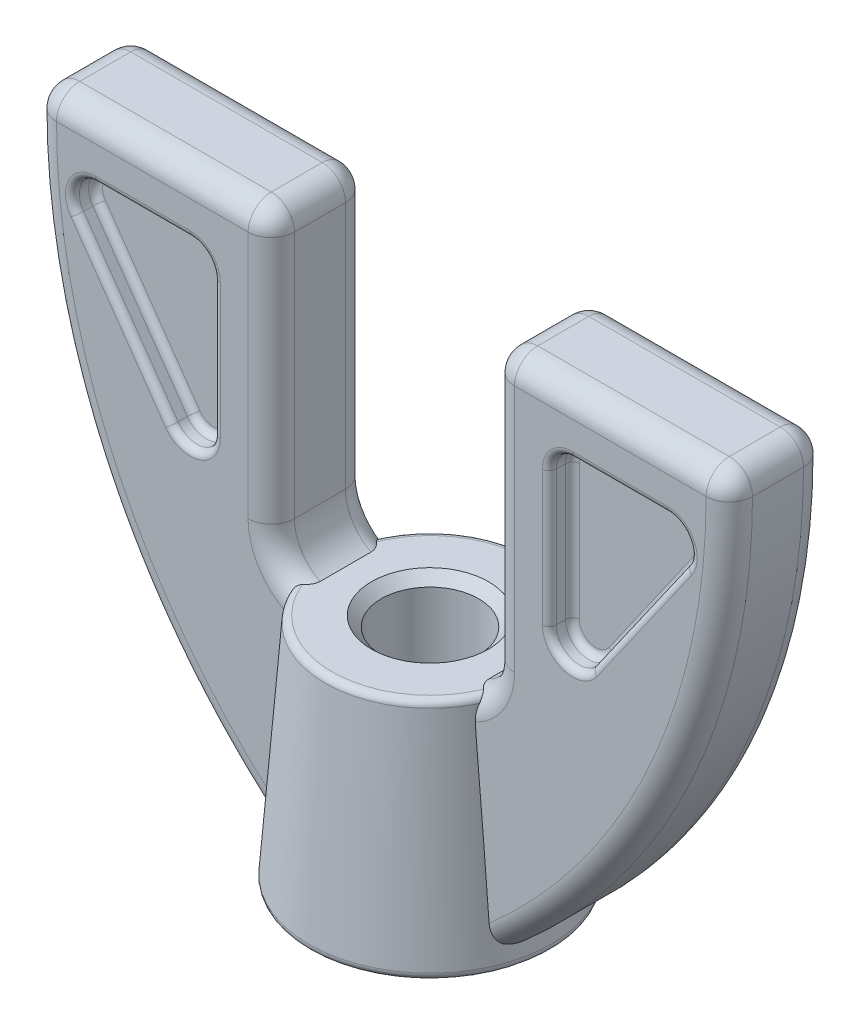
ISO-10303-21;
HEADER;
FILE_DESCRIPTION(('STEP AP214'),'2;1');
FILE_NAME('part.step','',(''),(''),'','','');
FILE_SCHEMA(('AUTOMOTIVE_DESIGN { 1 0 10303 214 1 1 1 1 }'));
ENDSEC;
DATA;
#1=APPLICATION_CONTEXT('core data for automotive mechanical design processes');
#2=APPLICATION_PROTOCOL_DEFINITION('international standard','automotive_design',2000,#1);
#3=PRODUCT_CONTEXT('',#1,'mechanical');
#4=PRODUCT('Part','Part','',(#3));
#5=PRODUCT_RELATED_PRODUCT_CATEGORY('part','',(#4));
#6=PRODUCT_DEFINITION_FORMATION('','',#4);
#7=PRODUCT_DEFINITION_CONTEXT('part definition',#1,'design');
#8=PRODUCT_DEFINITION('design','',#6,#7);
#9=PRODUCT_DEFINITION_SHAPE('','',#8);
#10=(LENGTH_UNIT() NAMED_UNIT(*) SI_UNIT(.MILLI.,.METRE.));
#11=(NAMED_UNIT(*) PLANE_ANGLE_UNIT() SI_UNIT($,.RADIAN.));
#12=(NAMED_UNIT(*) SI_UNIT($,.STERADIAN.) SOLID_ANGLE_UNIT());
#13=UNCERTAINTY_MEASURE_WITH_UNIT(LENGTH_MEASURE(1.E-05),#10,'distance_accuracy_value','');
#14=(GEOMETRIC_REPRESENTATION_CONTEXT(3) GLOBAL_UNCERTAINTY_ASSIGNED_CONTEXT((#13)) GLOBAL_UNIT_ASSIGNED_CONTEXT((#10,
#11,#12)) REPRESENTATION_CONTEXT('',''));
#15=CARTESIAN_POINT('',(0.,0.,0.));
#16=DIRECTION('',(0.,0.,1.));
#17=DIRECTION('',(1.,0.,0.));
#18=AXIS2_PLACEMENT_3D('',#15,#16,#17);
#19=CARTESIAN_POINT('',(-13.4819529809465,22.5419944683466,-2.1));
#20=DIRECTION('',(0.,0.,1.));
#21=DIRECTION('',(1.,0.,0.));
#22=AXIS2_PLACEMENT_3D('',#19,#20,#21);
#23=PLANE('',#22);
#24=DIRECTION('',(-1.,0.,0.));
#25=VECTOR('',#24,1.);
#26=CARTESIAN_POINT('',(8.25000000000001,21.3,-2.1));
#27=LINE('',#26,#25);
#28=CARTESIAN_POINT('',(12.3293444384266,21.3,-2.1));
#29=VERTEX_POINT('',#28);
#30=CARTESIAN_POINT('',(8.25000000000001,21.3,-2.1));
#31=VERTEX_POINT('',#30);
#32=EDGE_CURVE('E75',#29,#31,#27,.T.);
#33=ORIENTED_EDGE('',*,*,#32,.T.);
#34=CARTESIAN_POINT('',(8.25,20.,-2.1));
#35=DIRECTION('',(0.,0.,1.));
#36=DIRECTION('',(1.,0.,0.));
#37=AXIS2_PLACEMENT_3D('',#34,#35,#36);
#38=CIRCLE('',#37,1.3);
#39=CARTESIAN_POINT('',(6.95,20.,-2.1));
#40=VERTEX_POINT('',#39);
#41=EDGE_CURVE('E597',#31,#40,#38,.T.);
#42=ORIENTED_EDGE('',*,*,#41,.T.);
#43=DIRECTION('',(0.,-1.,0.));
#44=VECTOR('',#43,1.);
#45=CARTESIAN_POINT('',(6.95,14.172365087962,-2.1));
#46=LINE('',#45,#44);
#47=CARTESIAN_POINT('',(6.95,14.172365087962,-2.1));
#48=VERTEX_POINT('',#47);
#49=EDGE_CURVE('E592',#40,#48,#46,.T.);
#50=ORIENTED_EDGE('',*,*,#49,.T.);
#51=CARTESIAN_POINT('',(8.25,14.172365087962,-2.1));
#52=DIRECTION('',(0.,0.,1.));
#53=DIRECTION('',(1.,0.,0.));
#54=AXIS2_PLACEMENT_3D('',#51,#52,#53);
#55=CIRCLE('',#54,1.3);
#56=CARTESIAN_POINT('',(9.31500149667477,13.4268640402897,-2.1));
#57=VERTEX_POINT('',#56);
#58=EDGE_CURVE('E582',#48,#57,#55,.T.);
#59=ORIENTED_EDGE('',*,*,#58,.T.);
#60=DIRECTION('',(0.573462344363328,0.819231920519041,0.));
#61=VECTOR('',#60,1.);
#62=CARTESIAN_POINT('',(13.3943459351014,19.2544989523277,-2.1));
#63=LINE('',#62,#61);
#64=CARTESIAN_POINT('',(13.3943459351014,19.2544989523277,-2.1));
#65=VERTEX_POINT('',#64);
#66=EDGE_CURVE('E589',#57,#65,#63,.T.);
#67=ORIENTED_EDGE('',*,*,#66,.T.);
#68=CARTESIAN_POINT('',(12.3293444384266,20.,-2.1));
#69=DIRECTION('',(0.,0.,1.));
#70=DIRECTION('',(1.,0.,0.));
#71=AXIS2_PLACEMENT_3D('',#68,#69,#70);
#72=CIRCLE('',#71,1.3);
#73=EDGE_CURVE('E80',#65,#29,#72,.T.);
#74=ORIENTED_EDGE('',*,*,#73,.T.);
#75=EDGE_LOOP('',(#33,#42,#50,#59,#67,#74));
#76=FACE_BOUND('',#75,.T.);
#77=DIRECTION('',(-1.,0.,0.));
#78=VECTOR('',#77,1.);
#79=CARTESIAN_POINT('',(-13.4819529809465,22.5,-2.1));
#80=LINE('',#79,#78);
#81=CARTESIAN_POINT('',(5.75,22.5,-2.1));
#82=VERTEX_POINT('',#81);
#83=CARTESIAN_POINT('',(14.0160748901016,22.5,-2.1));
#84=VERTEX_POINT('',#83);
#85=EDGE_CURVE('E330',#82,#84,#80,.F.);
#86=ORIENTED_EDGE('',*,*,#85,.T.);
#87=CARTESIAN_POINT('',(-13.4819529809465,22.5419944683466,-2.1));
#88=DIRECTION('',(0.,0.,1.));
#89=DIRECTION('',(1.,0.,0.));
#90=AXIS2_PLACEMENT_3D('',#87,#88,#89);
#91=CIRCLE('',#90,27.4980599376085);
#92=CARTESIAN_POINT('',(3.66902772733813,1.04810787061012,-2.1));
#93=VERTEX_POINT('',#92);
#94=EDGE_CURVE('E306',#84,#93,#91,.F.);
#95=ORIENTED_EDGE('',*,*,#94,.T.);
#96=DIRECTION('',(0.0824045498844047,-0.996598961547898,0.));
#97=VECTOR('',#96,1.);
#98=CARTESIAN_POINT('',(2.94537081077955,9.8,-2.1));
#99=LINE('',#98,#97);
#100=CARTESIAN_POINT('',(3.02778182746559,8.80332282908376,-2.1));
#101=VERTEX_POINT('',#100);
#102=EDGE_CURVE('E835',#101,#93,#99,.T.);
#103=ORIENTED_EDGE('',*,*,#102,.F.);
#104=CARTESIAN_POINT('',(2.75,11.7904346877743,-2.1));
#105=DIRECTION('',(0.,0.,1.));
#106=DIRECTION('',(1.,0.,0.));
#107=AXIS2_PLACEMENT_3D('',#104,#105,#106);
#108=CIRCLE('',#107,3.);
#109=CARTESIAN_POINT('',(5.75,11.7904346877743,-2.1));
#110=VERTEX_POINT('',#109);
#111=EDGE_CURVE('E348',#101,#110,#108,.T.);
#112=ORIENTED_EDGE('',*,*,#111,.T.);
#113=DIRECTION('',(0.,-1.,0.));
#114=VECTOR('',#113,1.);
#115=CARTESIAN_POINT('',(5.75,22.5419944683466,-2.1));
#116=LINE('',#115,#114);
#117=EDGE_CURVE('E346',#110,#82,#116,.F.);
#118=ORIENTED_EDGE('',*,*,#117,.T.);
#119=EDGE_LOOP('',(#86,#95,#103,#112,#118));
#120=FACE_BOUND('',#119,.T.);
#121=ADVANCED_FACE('F58',(#76,#120),#23,.F.);
#122=CARTESIAN_POINT('',(-13.4819529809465,22.5419944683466,2.1));
#123=DIRECTION('',(0.,0.,-1.));
#124=DIRECTION('',(-1.,0.,0.));
#125=AXIS2_PLACEMENT_3D('',#122,#123,#124);
#126=CYLINDRICAL_SURFACE('',#125,28.4980599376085);
#127=DIRECTION('',(0.,0.,-1.));
#128=VECTOR('',#127,1.);
#129=CARTESIAN_POINT('',(5.175,1.,2.1));
#130=LINE('',#129,#128);
#131=CARTESIAN_POINT('',(5.175,1.,1.1));
#132=VERTEX_POINT('',#131);
#133=CARTESIAN_POINT('',(5.175,1.,-1.1));
#134=VERTEX_POINT('',#133);
#135=EDGE_CURVE('E329',#132,#134,#130,.T.);
#136=ORIENTED_EDGE('',*,*,#135,.T.);
#137=CARTESIAN_POINT('',(-13.4819529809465,22.5419944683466,-1.1));
#138=DIRECTION('',(0.,0.,1.));
#139=DIRECTION('',(1.,0.,0.));
#140=AXIS2_PLACEMENT_3D('',#137,#138,#139);
#141=CIRCLE('',#140,28.4980599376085);
#142=CARTESIAN_POINT('',(15.0160737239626,22.4984728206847,-1.1));
#143=VERTEX_POINT('',#142);
#144=EDGE_CURVE('E305',#134,#143,#141,.T.);
#145=ORIENTED_EDGE('',*,*,#144,.T.);
#146=DIRECTION('',(0.,0.,-1.));
#147=VECTOR('',#146,1.);
#148=CARTESIAN_POINT('',(15.0160737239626,22.4984728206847,2.1));
#149=LINE('',#148,#147);
#150=CARTESIAN_POINT('',(15.0160737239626,22.4984728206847,1.1));
#151=VERTEX_POINT('',#150);
#152=EDGE_CURVE('E326',#143,#151,#149,.F.);
#153=ORIENTED_EDGE('',*,*,#152,.T.);
#154=CARTESIAN_POINT('',(-13.4819529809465,22.5419944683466,1.1));
#155=DIRECTION('',(0.,0.,1.));
#156=DIRECTION('',(1.,0.,0.));
#157=AXIS2_PLACEMENT_3D('',#154,#155,#156);
#158=CIRCLE('',#157,28.4980599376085);
#159=EDGE_CURVE('E331',#151,#132,#158,.F.);
#160=ORIENTED_EDGE('',*,*,#159,.T.);
#161=EDGE_LOOP('',(#136,#145,#153,#160));
#162=FACE_BOUND('',#161,.T.);
#163=ADVANCED_FACE('F325',(#162),#126,.T.);
#164=CARTESIAN_POINT('',(4.75,23.5,2.1));
#165=DIRECTION('',(0.,-1.,0.));
#166=DIRECTION('',(0.,0.,-1.));
#167=AXIS2_PLACEMENT_3D('',#164,#165,#166);
#168=PLANE('',#167);
#169=DIRECTION('',(0.,0.,-1.));
#170=VECTOR('',#169,1.);
#171=CARTESIAN_POINT('',(5.75,23.5,2.1));
#172=LINE('',#171,#170);
#173=CARTESIAN_POINT('',(5.75,23.5,-1.1));
#174=VERTEX_POINT('',#173);
#175=CARTESIAN_POINT('',(5.75,23.5,1.1));
#176=VERTEX_POINT('',#175);
#177=EDGE_CURVE('E340',#174,#176,#172,.F.);
#178=ORIENTED_EDGE('',*,*,#177,.T.);
#179=DIRECTION('',(-1.,0.,0.));
#180=VECTOR('',#179,1.);
#181=CARTESIAN_POINT('',(14.0160748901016,23.5,1.1));
#182=LINE('',#181,#180);
#183=CARTESIAN_POINT('',(14.0160748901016,23.5,1.1));
#184=VERTEX_POINT('',#183);
#185=EDGE_CURVE('E853',#176,#184,#182,.F.);
#186=ORIENTED_EDGE('',*,*,#185,.T.);
#187=DIRECTION('',(0.,0.,-1.));
#188=VECTOR('',#187,1.);
#189=CARTESIAN_POINT('',(14.0160748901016,23.5,2.1));
#190=LINE('',#189,#188);
#191=CARTESIAN_POINT('',(14.0160748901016,23.5,-1.1));
#192=VERTEX_POINT('',#191);
#193=EDGE_CURVE('E336',#184,#192,#190,.T.);
#194=ORIENTED_EDGE('',*,*,#193,.T.);
#195=DIRECTION('',(-1.,0.,0.));
#196=VECTOR('',#195,1.);
#197=CARTESIAN_POINT('',(4.75,23.5,-1.1));
#198=LINE('',#197,#196);
#199=EDGE_CURVE('E855',#192,#174,#198,.T.);
#200=ORIENTED_EDGE('',*,*,#199,.T.);
#201=EDGE_LOOP('',(#178,#186,#194,#200));
#202=FACE_BOUND('',#201,.T.);
#203=ADVANCED_FACE('F451',(#202),#168,.F.);
#204=CARTESIAN_POINT('',(4.75,23.5,2.1));
#205=DIRECTION('',(1.,0.,0.));
#206=DIRECTION('',(0.,1.,0.));
#207=AXIS2_PLACEMENT_3D('',#204,#205,#206);
#208=PLANE('',#207);
#209=DIRECTION('',(0.,0.,-1.));
#210=VECTOR('',#209,1.);
#211=CARTESIAN_POINT('',(4.75,22.5,2.1));
#212=LINE('',#211,#210);
#213=CARTESIAN_POINT('',(4.75,22.5,1.1));
#214=VERTEX_POINT('',#213);
#215=CARTESIAN_POINT('',(4.75,22.5,-1.1));
#216=VERTEX_POINT('',#215);
#217=EDGE_CURVE('E335',#214,#216,#212,.T.);
#218=ORIENTED_EDGE('',*,*,#217,.T.);
#219=DIRECTION('',(0.,-1.,0.));
#220=VECTOR('',#219,1.);
#221=CARTESIAN_POINT('',(4.75,23.5,-1.1));
#222=LINE('',#221,#220);
#223=CARTESIAN_POINT('',(4.75,11.7904346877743,-1.1));
#224=VERTEX_POINT('',#223);
#225=EDGE_CURVE('E954',#216,#224,#222,.T.);
#226=ORIENTED_EDGE('',*,*,#225,.T.);
#227=DIRECTION('',(0.,0.,1.));
#228=VECTOR('',#227,1.);
#229=CARTESIAN_POINT('',(4.75,11.7904346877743,2.1));
#230=LINE('',#229,#228);
#231=CARTESIAN_POINT('',(4.75,11.7904346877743,1.1));
#232=VERTEX_POINT('',#231);
#233=EDGE_CURVE('E846',#224,#232,#230,.T.);
#234=ORIENTED_EDGE('',*,*,#233,.T.);
#235=DIRECTION('',(0.,-1.,0.));
#236=VECTOR('',#235,1.);
#237=CARTESIAN_POINT('',(4.75,22.5,1.1));
#238=LINE('',#237,#236);
#239=EDGE_CURVE('E956',#232,#214,#238,.F.);
#240=ORIENTED_EDGE('',*,*,#239,.T.);
#241=EDGE_LOOP('',(#218,#226,#234,#240));
#242=FACE_BOUND('',#241,.T.);
#243=ADVANCED_FACE('F376',(#242),#208,.F.);
#244=CARTESIAN_POINT('',(2.94537081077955,9.8,2.1));
#245=DIRECTION('',(0.996598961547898,0.0824045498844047,0.));
#246=DIRECTION('',(-0.0824045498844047,0.996598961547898,0.));
#247=AXIS2_PLACEMENT_3D('',#244,#245,#246);
#248=PLANE('',#247);
#249=ORIENTED_EDGE('',*,*,#102,.T.);
#250=CARTESIAN_POINT('',(3.66902772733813,1.04810787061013,-2.1));
#251=CARTESIAN_POINT('',(3.66969088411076,1.04008766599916,-2.10000004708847));
#252=CARTESIAN_POINT('',(3.67035394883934,1.03206857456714,-2.09993305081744));
#253=CARTESIAN_POINT('',(3.67167989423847,1.016032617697,-2.09966497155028));
#254=CARTESIAN_POINT('',(3.67234277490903,1.00801575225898,-2.09946388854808));
#255=CARTESIAN_POINT('',(3.67300556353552,1.,-2.09919576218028));
#256=B_SPLINE_CURVE_WITH_KNOTS('',3,(#250,#251,#252,#253,#254,#255),.UNSPECIFIED.,.F.,.F.,(4,2,
4),(0.,0.0241402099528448,0.0482804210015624),.UNSPECIFIED.);
#257=CARTESIAN_POINT('',(3.67300556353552,1.,-2.09919576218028));
#258=VERTEX_POINT('',#257);
#259=EDGE_CURVE('E391',#93,#258,#256,.T.);
#260=ORIENTED_EDGE('',*,*,#259,.T.);
#261=DIRECTION('',(0.,0.,-1.));
#262=VECTOR('',#261,1.);
#263=CARTESIAN_POINT('',(3.67300556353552,1.,2.1));
#264=LINE('',#263,#262);
#265=CARTESIAN_POINT('',(3.67300556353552,1.,2.09919576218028));
#266=VERTEX_POINT('',#265);
#267=EDGE_CURVE('E840',#266,#258,#264,.T.);
#268=ORIENTED_EDGE('',*,*,#267,.F.);
#269=CARTESIAN_POINT('',(3.67300556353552,1.,2.09919576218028));
#270=CARTESIAN_POINT('',(3.67234277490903,1.00801575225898,2.09946388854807));
#271=CARTESIAN_POINT('',(3.67167989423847,1.016032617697,2.09966497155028));
#272=CARTESIAN_POINT('',(3.67035394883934,1.03206857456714,2.09993305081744));
#273=CARTESIAN_POINT('',(3.66969088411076,1.04008766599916,2.10000004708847));
#274=CARTESIAN_POINT('',(3.66902772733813,1.04810787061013,2.1));
#275=B_SPLINE_CURVE_WITH_KNOTS('',3,(#269,#270,#271,#272,#273,#274),.UNSPECIFIED.,.F.,.F.,(4,2,
4),(0.,0.0241402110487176,0.0482804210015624),.UNSPECIFIED.);
#276=CARTESIAN_POINT('',(3.66902772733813,1.04810787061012,2.1));
#277=VERTEX_POINT('',#276);
#278=EDGE_CURVE('E359',#266,#277,#275,.T.);
#279=ORIENTED_EDGE('',*,*,#278,.T.);
#280=DIRECTION('',(0.0824045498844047,-0.996598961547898,0.));
#281=VECTOR('',#280,1.);
#282=CARTESIAN_POINT('',(2.94537081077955,9.8,2.1));
#283=LINE('',#282,#281);
#284=CARTESIAN_POINT('',(3.02778182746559,8.80332282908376,2.1));
#285=VERTEX_POINT('',#284);
#286=EDGE_CURVE('E832',#285,#277,#283,.T.);
#287=ORIENTED_EDGE('',*,*,#286,.F.);
#288=CARTESIAN_POINT('',(3.02778182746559,8.80332282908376,2.1));
#289=CARTESIAN_POINT('',(3.02546311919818,8.8313652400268,2.09999981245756));
#290=CARTESIAN_POINT('',(3.02314552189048,8.85939421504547,2.09881174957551));
#291=CARTESIAN_POINT('',(3.0185269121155,8.91525158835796,2.0940721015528));
#292=CARTESIAN_POINT('',(3.01622589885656,8.94307999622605,2.09052062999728));
#293=CARTESIAN_POINT('',(3.00937647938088,9.02591673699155,2.07635485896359));
#294=CARTESIAN_POINT('',(3.00487395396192,9.0803701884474,2.06222910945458));
#295=CARTESIAN_POINT('',(2.99612836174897,9.1861392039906,2.02500550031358));
#296=CARTESIAN_POINT('',(2.99188542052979,9.23745324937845,2.00190333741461));
#297=CARTESIAN_POINT('',(2.98377948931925,9.33548621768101,1.94738502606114));
#298=CARTESIAN_POINT('',(2.97991643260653,9.38220594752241,1.91597034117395));
#299=CARTESIAN_POINT('',(2.97267993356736,9.46972402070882,1.84571818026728));
#300=CARTESIAN_POINT('',(2.96930648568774,9.51052243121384,1.80688078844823));
#301=CARTESIAN_POINT('',(2.96314408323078,9.5850504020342,1.7228748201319));
#302=CARTESIAN_POINT('',(2.96035524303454,9.61877857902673,1.67770500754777));
#303=CARTESIAN_POINT('',(2.95544190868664,9.67820034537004,1.58232251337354));
#304=CARTESIAN_POINT('',(2.95331750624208,9.70389282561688,1.53210913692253));
#305=CARTESIAN_POINT('',(2.94979471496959,9.74649739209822,1.42807654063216));
#306=CARTESIAN_POINT('',(2.94839589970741,9.76341463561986,1.37425945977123));
#307=CARTESIAN_POINT('',(2.94671191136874,9.78378075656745,1.28342711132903));
#308=CARTESIAN_POINT('',(2.94620930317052,9.78985928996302,1.24698362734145));
#309=CARTESIAN_POINT('',(2.94553879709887,9.79796837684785,1.17369852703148));
#310=CARTESIAN_POINT('',(2.94537042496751,9.80000466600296,1.13685754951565));
#311=CARTESIAN_POINT('',(2.94537081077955,9.8,1.1));
#312=B_SPLINE_CURVE_WITH_KNOTS('',3,(#288,#289,#290,#291,#292,#293,#294,#295,#296,#297,#298,
#299,#300,#301,#302,#303,#304,#305,#306,#307,#308,#309,#310,#311),.UNSPECIFIED.,.F.,.F.,(4,2,2,
2,2,2,2,2,2,2,2,4),(0.,0.0843624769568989,0.168720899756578,0.33715956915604,0.505679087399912,
0.674168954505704,0.842656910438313,1.01117780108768,1.17972194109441,1.34816691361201,
1.45880780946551,1.56929160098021),.UNSPECIFIED.);
#313=CARTESIAN_POINT('',(2.94537081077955,9.8,1.1));
#314=VERTEX_POINT('',#313);
#315=EDGE_CURVE('E351',#285,#314,#312,.T.);
#316=ORIENTED_EDGE('',*,*,#315,.T.);
#317=DIRECTION('',(0.,0.,-1.));
#318=VECTOR('',#317,1.);
#319=CARTESIAN_POINT('',(2.94537081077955,9.8,2.1));
#320=LINE('',#319,#318);
#321=CARTESIAN_POINT('',(2.94537081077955,9.8,-1.1));
#322=VERTEX_POINT('',#321);
#323=EDGE_CURVE('E843',#314,#322,#320,.T.);
#324=ORIENTED_EDGE('',*,*,#323,.T.);
#325=CARTESIAN_POINT('',(2.94537081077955,9.8,-1.1));
#326=CARTESIAN_POINT('',(2.9453708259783,9.79999981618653,-1.12813266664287));
#327=CARTESIAN_POINT('',(2.94546871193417,9.79881598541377,-1.15625185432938));
#328=CARTESIAN_POINT('',(2.94585921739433,9.79409322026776,-1.21228898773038));
#329=CARTESIAN_POINT('',(2.94615182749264,9.79055439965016,-1.24020694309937));
#330=CARTESIAN_POINT('',(2.947318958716,9.77643913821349,-1.32330995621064));
#331=CARTESIAN_POINT('',(2.94848278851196,9.76236380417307,-1.37793831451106));
#332=CARTESIAN_POINT('',(2.95154963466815,9.72527342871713,-1.48404692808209));
#333=CARTESIAN_POINT('',(2.95345300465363,9.70225411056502,-1.53552566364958));
#334=CARTESIAN_POINT('',(2.95794467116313,9.64793198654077,-1.63387359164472));
#335=CARTESIAN_POINT('',(2.96053284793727,9.61663062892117,-1.68074358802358));
#336=CARTESIAN_POINT('',(2.96632086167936,9.54663050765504,-1.76854703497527));
#337=CARTESIAN_POINT('',(2.96952073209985,9.50793133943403,-1.80948016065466));
#338=CARTESIAN_POINT('',(2.97644205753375,9.42422496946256,-1.88425574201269));
#339=CARTESIAN_POINT('',(2.98016361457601,9.37921653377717,-1.91809680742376));
#340=CARTESIAN_POINT('',(2.98802277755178,9.28416797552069,-1.9777248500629));
#341=CARTESIAN_POINT('',(2.9921605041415,9.23412639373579,-2.00350948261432));
#342=CARTESIAN_POINT('',(3.0007331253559,9.13044928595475,-2.04626992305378));
#343=CARTESIAN_POINT('',(3.00516784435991,9.07681588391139,-2.06325088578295));
#344=CARTESIAN_POINT('',(3.01265503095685,8.98626600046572,-2.08370401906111));
#345=CARTESIAN_POINT('',(3.01566041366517,8.94991896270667,-2.08981130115));
#346=CARTESIAN_POINT('',(3.02170405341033,8.87682730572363,-2.09795875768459));
#347=CARTESIAN_POINT('',(3.02474225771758,8.84008332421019,-2.10000469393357));
#348=CARTESIAN_POINT('',(3.02778182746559,8.80332282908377,-2.1));
#349=B_SPLINE_CURVE_WITH_KNOTS('',3,(#325,#326,#327,#328,#329,#330,#331,#332,#333,#334,#335,
#336,#337,#338,#339,#340,#341,#342,#343,#344,#345,#346,#347,#348),.UNSPECIFIED.,.F.,.F.,(4,2,2,
2,2,2,2,2,2,2,2,4),(0.,0.0843461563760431,0.168688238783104,0.337093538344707,0.505579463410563,
0.67403594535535,0.842501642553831,1.0110003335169,1.17954801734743,1.34799689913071,
1.45872297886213,1.56929185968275),.UNSPECIFIED.);
#350=EDGE_CURVE('E385',#322,#101,#349,.T.);
#351=ORIENTED_EDGE('',*,*,#350,.T.);
#352=EDGE_LOOP('',(#249,#260,#268,#279,#287,#316,#324,#351));
#353=FACE_BOUND('',#352,.T.);
#354=ADVANCED_FACE('F370',(#353),#248,.F.);
#355=CARTESIAN_POINT('',(3.67300556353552,1.,2.1));
#356=DIRECTION('',(0.,1.,0.));
#357=DIRECTION('',(0.,0.,1.));
#358=AXIS2_PLACEMENT_3D('',#355,#356,#357);
#359=PLANE('',#358);
#360=ORIENTED_EDGE('',*,*,#267,.T.);
#361=CARTESIAN_POINT('',(3.67300556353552,1.,-2.09919576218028));
#362=CARTESIAN_POINT('',(3.73987731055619,1.,-2.09750127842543));
#363=CARTESIAN_POINT('',(3.80671388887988,1.,-2.09323544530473));
#364=CARTESIAN_POINT('',(3.9400243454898,1.,-2.07923156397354));
#365=CARTESIAN_POINT('',(4.00649635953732,1.,-2.06947591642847));
#366=CARTESIAN_POINT('',(4.139217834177,1.,-2.04400275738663));
#367=CARTESIAN_POINT('',(4.20545277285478,1.,-2.02820824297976));
#368=CARTESIAN_POINT('',(4.33597011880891,1.,-1.99019505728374));
#369=CARTESIAN_POINT('',(4.40025533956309,1.,-1.96798618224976));
#370=CARTESIAN_POINT('',(4.52744156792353,1.,-1.91588148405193));
#371=CARTESIAN_POINT('',(4.59027478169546,1.,-1.88581763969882));
#372=CARTESIAN_POINT('',(4.71116312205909,1.,-1.81749379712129));
#373=CARTESIAN_POINT('',(4.76923339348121,1.,-1.77926129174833));
#374=CARTESIAN_POINT('',(4.86705004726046,1.,-1.70250230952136));
#375=CARTESIAN_POINT('',(4.90810674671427,1.,-1.66565920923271));
#376=CARTESIAN_POINT('',(4.98392246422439,1.,-1.58591065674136));
#377=CARTESIAN_POINT('',(5.01868862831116,1.,-1.54301218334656));
#378=CARTESIAN_POINT('',(5.07213168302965,1.,-1.46248936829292));
#379=CARTESIAN_POINT('',(5.09266605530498,1.,-1.4261026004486));
#380=CARTESIAN_POINT('',(5.12749433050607,1.,-1.3504918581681));
#381=CARTESIAN_POINT('',(5.14180314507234,1.,-1.31127492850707));
#382=CARTESIAN_POINT('',(5.15985642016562,1.,-1.24326461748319));
#383=CARTESIAN_POINT('',(5.16549548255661,1.,-1.2149668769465));
#384=CARTESIAN_POINT('',(5.17308529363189,1.,-1.15779037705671));
#385=CARTESIAN_POINT('',(5.17502399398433,1.,-1.12891002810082));
#386=CARTESIAN_POINT('',(5.17500000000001,1.,-1.1));
#387=B_SPLINE_CURVE_WITH_KNOTS('',3,(#361,#362,#363,#364,#365,#366,#367,#368,#369,#370,#371,
#372,#373,#374,#375,#376,#377,#378,#379,#380,#381,#382,#383,#384,#385,#386),.UNSPECIFIED.,.F.,
.F.,(4,2,2,2,2,2,2,2,2,2,2,2,4),(0.,0.200674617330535,0.401996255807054,0.605975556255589,
0.809644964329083,1.01808965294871,1.22584354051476,1.39079515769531,1.55555819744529,
1.68043148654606,1.80500400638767,1.89133719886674,1.97795101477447),.UNSPECIFIED.);
#388=EDGE_CURVE('E421',#258,#134,#387,.T.);
#389=ORIENTED_EDGE('',*,*,#388,.T.);
#390=ORIENTED_EDGE('',*,*,#135,.F.);
#391=CARTESIAN_POINT('',(5.175,1.,1.1));
#392=CARTESIAN_POINT('',(5.17500500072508,1.,1.12141732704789));
#393=CARTESIAN_POINT('',(5.17394805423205,1.,1.14282048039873));
#394=CARTESIAN_POINT('',(5.16976667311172,1.,1.1854039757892));
#395=CARTESIAN_POINT('',(5.1666442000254,1.,1.20658450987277));
#396=CARTESIAN_POINT('',(5.15434809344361,1.,1.2691134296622));
#397=CARTESIAN_POINT('',(5.14224305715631,1.,1.30991380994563));
#398=CARTESIAN_POINT('',(5.11125792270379,1.,1.38861362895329));
#399=CARTESIAN_POINT('',(5.09240115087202,1.,1.42652251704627));
#400=CARTESIAN_POINT('',(5.04911330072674,1.,1.49909245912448));
#401=CARTESIAN_POINT('',(5.02466764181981,1.,1.5337446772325));
#402=CARTESIAN_POINT('',(4.95898135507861,1.,1.6148144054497));
#403=CARTESIAN_POINT('',(4.91522351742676,1.,1.65918712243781));
#404=CARTESIAN_POINT('',(4.82128893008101,1.,1.74045908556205));
#405=CARTESIAN_POINT('',(4.77110005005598,1.,1.7773438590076));
#406=CARTESIAN_POINT('',(4.64011707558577,1.,1.86100480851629));
#407=CARTESIAN_POINT('',(4.55658655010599,1.,1.903479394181));
#408=CARTESIAN_POINT('',(4.38392507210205,1.,1.97510240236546));
#409=CARTESIAN_POINT('',(4.29477712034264,1.,2.00420792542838));
#410=CARTESIAN_POINT('',(4.11697717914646,1.,2.04970707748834));
#411=CARTESIAN_POINT('',(4.02843737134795,1.,2.06654554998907));
#412=CARTESIAN_POINT('',(3.89512199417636,1.,2.08425980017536));
#413=CARTESIAN_POINT('',(3.85080566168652,1.,2.08890295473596));
#414=CARTESIAN_POINT('',(3.76200675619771,1.,2.09581179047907));
#415=CARTESIAN_POINT('',(3.71752426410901,1.,2.09807850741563));
#416=CARTESIAN_POINT('',(3.67300556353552,1.,2.09919576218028));
#417=B_SPLINE_CURVE_WITH_KNOTS('',3,(#391,#392,#393,#394,#395,#396,#397,#398,#399,#400,#401,
#402,#403,#404,#405,#406,#407,#408,#409,#410,#411,#412,#413,#414,#415,#416),.UNSPECIFIED.,.F.,
.F.,(4,2,2,2,2,2,2,2,2,2,2,2,4),(0.,0.0641993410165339,0.128337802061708,0.255243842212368,
0.38171560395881,0.508521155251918,0.694433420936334,0.880701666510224,1.16028388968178,
1.44075709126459,1.7104701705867,1.8440945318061,1.97766062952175),.UNSPECIFIED.);
#418=EDGE_CURVE('E415',#132,#266,#417,.T.);
#419=ORIENTED_EDGE('',*,*,#418,.T.);
#420=EDGE_LOOP('',(#360,#389,#390,#419));
#421=FACE_BOUND('',#420,.T.);
#422=ADVANCED_FACE('F375',(#421),#359,.F.);
#423=CARTESIAN_POINT('',(-13.4819529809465,22.5419944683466,2.1));
#424=DIRECTION('',(0.,0.,1.));
#425=DIRECTION('',(1.,0.,0.));
#426=AXIS2_PLACEMENT_3D('',#423,#424,#425);
#427=PLANE('',#426);
#428=CARTESIAN_POINT('',(8.25,14.172365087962,2.1));
#429=DIRECTION('',(0.,0.,1.));
#430=DIRECTION('',(1.,0.,0.));
#431=AXIS2_PLACEMENT_3D('',#428,#429,#430);
#432=CIRCLE('',#431,1.3);
#433=CARTESIAN_POINT('',(9.31500149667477,13.4268640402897,2.1));
#434=VERTEX_POINT('',#433);
#435=CARTESIAN_POINT('',(6.95,14.172365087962,2.1));
#436=VERTEX_POINT('',#435);
#437=EDGE_CURVE('E654',#434,#436,#432,.F.);
#438=ORIENTED_EDGE('',*,*,#437,.T.);
#439=DIRECTION('',(0.,-1.,0.));
#440=VECTOR('',#439,1.);
#441=CARTESIAN_POINT('',(6.95,20.,2.1));
#442=LINE('',#441,#440);
#443=CARTESIAN_POINT('',(6.95,20.,2.1));
#444=VERTEX_POINT('',#443);
#445=EDGE_CURVE('E659',#436,#444,#442,.F.);
#446=ORIENTED_EDGE('',*,*,#445,.T.);
#447=CARTESIAN_POINT('',(8.25,20.,2.1));
#448=DIRECTION('',(0.,0.,1.));
#449=DIRECTION('',(1.,0.,0.));
#450=AXIS2_PLACEMENT_3D('',#447,#448,#449);
#451=CIRCLE('',#450,1.3);
#452=CARTESIAN_POINT('',(8.25000000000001,21.3,2.1));
#453=VERTEX_POINT('',#452);
#454=EDGE_CURVE('E652',#444,#453,#451,.F.);
#455=ORIENTED_EDGE('',*,*,#454,.T.);
#456=DIRECTION('',(-1.,0.,0.));
#457=VECTOR('',#456,1.);
#458=CARTESIAN_POINT('',(12.3293444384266,21.3,2.1));
#459=LINE('',#458,#457);
#460=CARTESIAN_POINT('',(12.3293444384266,21.3,2.1));
#461=VERTEX_POINT('',#460);
#462=EDGE_CURVE('E642',#453,#461,#459,.F.);
#463=ORIENTED_EDGE('',*,*,#462,.T.);
#464=CARTESIAN_POINT('',(12.3293444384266,20.,2.1));
#465=DIRECTION('',(0.,0.,1.));
#466=DIRECTION('',(1.,0.,0.));
#467=AXIS2_PLACEMENT_3D('',#464,#465,#466);
#468=CIRCLE('',#467,1.3);
#469=CARTESIAN_POINT('',(13.3943459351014,19.2544989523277,2.1));
#470=VERTEX_POINT('',#469);
#471=EDGE_CURVE('E649',#461,#470,#468,.F.);
#472=ORIENTED_EDGE('',*,*,#471,.T.);
#473=DIRECTION('',(0.573462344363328,0.819231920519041,0.));
#474=VECTOR('',#473,1.);
#475=CARTESIAN_POINT('',(9.31500149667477,13.4268640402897,2.1));
#476=LINE('',#475,#474);
#477=EDGE_CURVE('E650',#470,#434,#476,.F.);
#478=ORIENTED_EDGE('',*,*,#477,.T.);
#479=EDGE_LOOP('',(#438,#446,#455,#463,#472,#478));
#480=FACE_BOUND('',#479,.T.);
#481=ORIENTED_EDGE('',*,*,#286,.T.);
#482=CARTESIAN_POINT('',(-13.4819529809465,22.5419944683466,2.1));
#483=DIRECTION('',(0.,0.,1.));
#484=DIRECTION('',(1.,0.,0.));
#485=AXIS2_PLACEMENT_3D('',#482,#483,#484);
#486=CIRCLE('',#485,27.4980599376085);
#487=CARTESIAN_POINT('',(14.0160748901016,22.5,2.1));
#488=VERTEX_POINT('',#487);
#489=EDGE_CURVE('E878',#277,#488,#486,.T.);
#490=ORIENTED_EDGE('',*,*,#489,.T.);
#491=DIRECTION('',(-1.,0.,0.));
#492=VECTOR('',#491,1.);
#493=CARTESIAN_POINT('',(5.75,22.5,2.1));
#494=LINE('',#493,#492);
#495=CARTESIAN_POINT('',(5.75,22.5,2.1));
#496=VERTEX_POINT('',#495);
#497=EDGE_CURVE('E945',#488,#496,#494,.T.);
#498=ORIENTED_EDGE('',*,*,#497,.T.);
#499=DIRECTION('',(0.,-1.,0.));
#500=VECTOR('',#499,1.);
#501=CARTESIAN_POINT('',(5.75,11.7904346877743,2.1));
#502=LINE('',#501,#500);
#503=CARTESIAN_POINT('',(5.75,11.7904346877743,2.1));
#504=VERTEX_POINT('',#503);
#505=EDGE_CURVE('E949',#496,#504,#502,.T.);
#506=ORIENTED_EDGE('',*,*,#505,.T.);
#507=CARTESIAN_POINT('',(2.75,11.7904346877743,2.1));
#508=DIRECTION('',(0.,0.,1.));
#509=DIRECTION('',(1.,0.,0.));
#510=AXIS2_PLACEMENT_3D('',#507,#508,#509);
#511=CIRCLE('',#510,3.);
#512=EDGE_CURVE('E940',#504,#285,#511,.F.);
#513=ORIENTED_EDGE('',*,*,#512,.T.);
#514=EDGE_LOOP('',(#481,#490,#498,#506,#513));
#515=FACE_BOUND('',#514,.T.);
#516=ADVANCED_FACE('F455',(#480,#515),#427,.T.);
#517=CARTESIAN_POINT('',(2.75,11.7904346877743,2.1));
#518=DIRECTION('',(0.,0.,1.));
#519=DIRECTION('',(1.,0.,0.));
#520=AXIS2_PLACEMENT_3D('',#517,#518,#519);
#521=CYLINDRICAL_SURFACE('',#520,2.);
#522=ORIENTED_EDGE('',*,*,#233,.F.);
#523=CARTESIAN_POINT('',(2.75,11.7904346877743,-1.1));
#524=DIRECTION('',(0.,0.,1.));
#525=DIRECTION('',(1.,0.,0.));
#526=AXIS2_PLACEMENT_3D('',#523,#524,#525);
#527=CIRCLE('',#526,2.);
#528=EDGE_CURVE('E958',#224,#322,#527,.F.);
#529=ORIENTED_EDGE('',*,*,#528,.T.);
#530=ORIENTED_EDGE('',*,*,#323,.F.);
#531=CARTESIAN_POINT('',(2.75,11.7904346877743,1.1));
#532=DIRECTION('',(0.,0.,1.));
#533=DIRECTION('',(1.,0.,0.));
#534=AXIS2_PLACEMENT_3D('',#531,#532,#533);
#535=CIRCLE('',#534,2.);
#536=EDGE_CURVE('E319',#314,#232,#535,.T.);
#537=ORIENTED_EDGE('',*,*,#536,.T.);
#538=EDGE_LOOP('',(#522,#529,#530,#537));
#539=FACE_BOUND('',#538,.T.);
#540=ADVANCED_FACE('F457',(#539),#521,.F.);
#541=CARTESIAN_POINT('',(14.0160748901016,22.5,2.1));
#542=DIRECTION('',(0.,0.,-1.));
#543=DIRECTION('',(-1.,0.,0.));
#544=AXIS2_PLACEMENT_3D('',#541,#542,#543);
#545=CYLINDRICAL_SURFACE('',#544,1.);
#546=ORIENTED_EDGE('',*,*,#152,.F.);
#547=CARTESIAN_POINT('',(14.0160748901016,22.5,-1.1));
#548=DIRECTION('',(0.,0.,-1.));
#549=DIRECTION('',(-1.,0.,0.));
#550=AXIS2_PLACEMENT_3D('',#547,#548,#549);
#551=CIRCLE('',#550,1.);
#552=EDGE_CURVE('E312',#143,#192,#551,.F.);
#553=ORIENTED_EDGE('',*,*,#552,.T.);
#554=ORIENTED_EDGE('',*,*,#193,.F.);
#555=CARTESIAN_POINT('',(14.0160748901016,22.5,1.1));
#556=DIRECTION('',(0.,0.,-1.));
#557=DIRECTION('',(-1.,0.,0.));
#558=AXIS2_PLACEMENT_3D('',#555,#556,#557);
#559=CIRCLE('',#558,1.);
#560=EDGE_CURVE('E320',#184,#151,#559,.T.);
#561=ORIENTED_EDGE('',*,*,#560,.T.);
#562=EDGE_LOOP('',(#546,#553,#554,#561));
#563=FACE_BOUND('',#562,.T.);
#564=ADVANCED_FACE('F333',(#563),#545,.T.);
#565=CARTESIAN_POINT('',(5.75,22.5,2.1));
#566=DIRECTION('',(0.,0.,-1.));
#567=DIRECTION('',(-1.,0.,0.));
#568=AXIS2_PLACEMENT_3D('',#565,#566,#567);
#569=CYLINDRICAL_SURFACE('',#568,1.);
#570=ORIENTED_EDGE('',*,*,#177,.F.);
#571=CARTESIAN_POINT('',(5.75,22.5,-1.1));
#572=DIRECTION('',(0.,0.,-1.));
#573=DIRECTION('',(-1.,0.,0.));
#574=AXIS2_PLACEMENT_3D('',#571,#572,#573);
#575=CIRCLE('',#574,1.);
#576=EDGE_CURVE('E951',#174,#216,#575,.F.);
#577=ORIENTED_EDGE('',*,*,#576,.T.);
#578=ORIENTED_EDGE('',*,*,#217,.F.);
#579=CARTESIAN_POINT('',(5.75,22.5,1.1));
#580=DIRECTION('',(0.,0.,-1.));
#581=DIRECTION('',(-1.,0.,0.));
#582=AXIS2_PLACEMENT_3D('',#579,#580,#581);
#583=CIRCLE('',#582,1.);
#584=EDGE_CURVE('E864',#214,#176,#583,.T.);
#585=ORIENTED_EDGE('',*,*,#584,.T.);
#586=EDGE_LOOP('',(#570,#577,#578,#585));
#587=FACE_BOUND('',#586,.T.);
#588=ADVANCED_FACE('F403',(#587),#569,.T.);
#589=CARTESIAN_POINT('',(2.75,11.7904346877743,-1.1));
#590=DIRECTION('',(0.,0.,1.));
#591=DIRECTION('',(1.,0.,0.));
#592=AXIS2_PLACEMENT_3D('',#589,#590,#591);
#593=TOROIDAL_SURFACE('',#592,3.,1.);
#594=ORIENTED_EDGE('',*,*,#350,.F.);
#595=ORIENTED_EDGE('',*,*,#528,.F.);
#596=CARTESIAN_POINT('',(5.75,11.7904346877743,-1.1));
#597=DIRECTION('',(0.,1.,0.));
#598=DIRECTION('',(0.,0.,1.));
#599=AXIS2_PLACEMENT_3D('',#596,#597,#598);
#600=CIRCLE('',#599,1.);
#601=EDGE_CURVE('E838',#110,#224,#600,.T.);
#602=ORIENTED_EDGE('',*,*,#601,.F.);
#603=ORIENTED_EDGE('',*,*,#111,.F.);
#604=EDGE_LOOP('',(#594,#595,#602,#603));
#605=FACE_BOUND('',#604,.T.);
#606=ADVANCED_FACE('F398',(#605),#593,.T.);
#607=CARTESIAN_POINT('',(5.75,23.5,-1.1));
#608=DIRECTION('',(0.,-1.,0.));
#609=DIRECTION('',(1.,0.,0.));
#610=AXIS2_PLACEMENT_3D('',#607,#608,#609);
#611=CYLINDRICAL_SURFACE('',#610,1.);
#612=ORIENTED_EDGE('',*,*,#601,.T.);
#613=ORIENTED_EDGE('',*,*,#225,.F.);
#614=CARTESIAN_POINT('',(5.75,22.5,-1.1));
#615=DIRECTION('',(0.,1.,0.));
#616=DIRECTION('',(0.,0.,1.));
#617=AXIS2_PLACEMENT_3D('',#614,#615,#616);
#618=CIRCLE('',#617,1.);
#619=EDGE_CURVE('E886',#82,#216,#618,.T.);
#620=ORIENTED_EDGE('',*,*,#619,.F.);
#621=ORIENTED_EDGE('',*,*,#117,.F.);
#622=EDGE_LOOP('',(#612,#613,#620,#621));
#623=FACE_BOUND('',#622,.T.);
#624=ADVANCED_FACE('F402',(#623),#611,.T.);
#625=CARTESIAN_POINT('',(5.75,22.5,-1.1));
#626=DIRECTION('',(0.,0.,1.));
#627=DIRECTION('',(1.,0.,0.));
#628=AXIS2_PLACEMENT_3D('',#625,#626,#627);
#629=SPHERICAL_SURFACE('',#628,1.);
#630=ORIENTED_EDGE('',*,*,#619,.T.);
#631=ORIENTED_EDGE('',*,*,#576,.F.);
#632=CARTESIAN_POINT('',(5.75,22.5,-1.1));
#633=DIRECTION('',(1.,0.,0.));
#634=DIRECTION('',(0.,0.,-1.));
#635=AXIS2_PLACEMENT_3D('',#632,#633,#634);
#636=CIRCLE('',#635,1.);
#637=EDGE_CURVE('E883',#82,#174,#636,.T.);
#638=ORIENTED_EDGE('',*,*,#637,.F.);
#639=EDGE_LOOP('',(#630,#631,#638));
#640=FACE_BOUND('',#639,.T.);
#641=ADVANCED_FACE('F437',(#640),#629,.T.);
#642=CARTESIAN_POINT('',(4.75,22.5,-1.1));
#643=DIRECTION('',(-1.,0.,0.));
#644=DIRECTION('',(0.,0.,1.));
#645=AXIS2_PLACEMENT_3D('',#642,#643,#644);
#646=CYLINDRICAL_SURFACE('',#645,1.);
#647=ORIENTED_EDGE('',*,*,#637,.T.);
#648=ORIENTED_EDGE('',*,*,#199,.F.);
#649=CARTESIAN_POINT('',(14.0160748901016,22.5,-1.1));
#650=DIRECTION('',(1.,0.,0.));
#651=DIRECTION('',(0.,1.,0.));
#652=AXIS2_PLACEMENT_3D('',#649,#650,#651);
#653=CIRCLE('',#652,1.);
#654=EDGE_CURVE('E309',#84,#192,#653,.T.);
#655=ORIENTED_EDGE('',*,*,#654,.F.);
#656=ORIENTED_EDGE('',*,*,#85,.F.);
#657=EDGE_LOOP('',(#647,#648,#655,#656));
#658=FACE_BOUND('',#657,.T.);
#659=ADVANCED_FACE('F435',(#658),#646,.T.);
#660=CARTESIAN_POINT('',(14.0160748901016,22.5,-1.1));
#661=DIRECTION('',(0.,0.,1.));
#662=DIRECTION('',(1.,0.,0.));
#663=AXIS2_PLACEMENT_3D('',#660,#661,#662);
#664=SPHERICAL_SURFACE('',#663,1.);
#665=ORIENTED_EDGE('',*,*,#654,.T.);
#666=ORIENTED_EDGE('',*,*,#552,.F.);
#667=CARTESIAN_POINT('',(14.0160748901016,22.5,-1.1));
#668=DIRECTION('',(-0.00152717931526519,-0.99999883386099,0.));
#669=DIRECTION('',(0.99999883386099,-0.00152717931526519,0.));
#670=AXIS2_PLACEMENT_3D('',#667,#668,#669);
#671=CIRCLE('',#670,1.);
#672=EDGE_CURVE('E299',#84,#143,#671,.T.);
#673=ORIENTED_EDGE('',*,*,#672,.F.);
#674=EDGE_LOOP('',(#665,#666,#673));
#675=FACE_BOUND('',#674,.T.);
#676=ADVANCED_FACE('F313',(#675),#664,.T.);
#677=CARTESIAN_POINT('',(-13.4819529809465,22.5419944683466,-1.1));
#678=DIRECTION('',(0.,0.,1.));
#679=DIRECTION('',(1.,0.,0.));
#680=AXIS2_PLACEMENT_3D('',#677,#678,#679);
#681=TOROIDAL_SURFACE('',#680,27.4980599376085,1.);
#682=ORIENTED_EDGE('',*,*,#259,.F.);
#683=ORIENTED_EDGE('',*,*,#94,.F.);
#684=ORIENTED_EDGE('',*,*,#672,.T.);
#685=ORIENTED_EDGE('',*,*,#144,.F.);
#686=ORIENTED_EDGE('',*,*,#388,.F.);
#687=EDGE_LOOP('',(#682,#683,#684,#685,#686));
#688=FACE_BOUND('',#687,.T.);
#689=ADVANCED_FACE('F302',(#688),#681,.T.);
#690=CARTESIAN_POINT('',(2.75,11.7904346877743,1.1));
#691=DIRECTION('',(0.,0.,1.));
#692=DIRECTION('',(1.,0.,0.));
#693=AXIS2_PLACEMENT_3D('',#690,#691,#692);
#694=TOROIDAL_SURFACE('',#693,3.,1.);
#695=ORIENTED_EDGE('',*,*,#315,.F.);
#696=ORIENTED_EDGE('',*,*,#512,.F.);
#697=CARTESIAN_POINT('',(5.75,11.7904346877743,1.1));
#698=DIRECTION('',(0.,1.,0.));
#699=DIRECTION('',(0.,0.,1.));
#700=AXIS2_PLACEMENT_3D('',#697,#698,#699);
#701=CIRCLE('',#700,1.);
#702=EDGE_CURVE('E310',#232,#504,#701,.T.);
#703=ORIENTED_EDGE('',*,*,#702,.F.);
#704=ORIENTED_EDGE('',*,*,#536,.F.);
#705=EDGE_LOOP('',(#695,#696,#703,#704));
#706=FACE_BOUND('',#705,.T.);
#707=ADVANCED_FACE('F366',(#706),#694,.T.);
#708=CARTESIAN_POINT('',(5.75,22.5419944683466,1.1));
#709=DIRECTION('',(0.,1.,0.));
#710=DIRECTION('',(-1.,0.,0.));
#711=AXIS2_PLACEMENT_3D('',#708,#709,#710);
#712=CYLINDRICAL_SURFACE('',#711,1.);
#713=CARTESIAN_POINT('',(5.75,22.5,1.1));
#714=DIRECTION('',(0.,1.,0.));
#715=DIRECTION('',(0.,0.,1.));
#716=AXIS2_PLACEMENT_3D('',#713,#714,#715);
#717=CIRCLE('',#716,1.);
#718=EDGE_CURVE('E866',#214,#496,#717,.T.);
#719=ORIENTED_EDGE('',*,*,#718,.F.);
#720=ORIENTED_EDGE('',*,*,#239,.F.);
#721=ORIENTED_EDGE('',*,*,#702,.T.);
#722=ORIENTED_EDGE('',*,*,#505,.F.);
#723=EDGE_LOOP('',(#719,#720,#721,#722));
#724=FACE_BOUND('',#723,.T.);
#725=ADVANCED_FACE('F973',(#724),#712,.T.);
#726=CARTESIAN_POINT('',(5.75,22.5,1.1));
#727=DIRECTION('',(0.,0.,1.));
#728=DIRECTION('',(1.,0.,0.));
#729=AXIS2_PLACEMENT_3D('',#726,#727,#728);
#730=SPHERICAL_SURFACE('',#729,1.);
#731=ORIENTED_EDGE('',*,*,#584,.F.);
#732=ORIENTED_EDGE('',*,*,#718,.T.);
#733=CARTESIAN_POINT('',(5.75,22.5,1.1));
#734=DIRECTION('',(1.,0.,0.));
#735=DIRECTION('',(0.,0.,-1.));
#736=AXIS2_PLACEMENT_3D('',#733,#734,#735);
#737=CIRCLE('',#736,1.);
#738=EDGE_CURVE('E862',#176,#496,#737,.T.);
#739=ORIENTED_EDGE('',*,*,#738,.F.);
#740=EDGE_LOOP('',(#731,#732,#739));
#741=FACE_BOUND('',#740,.T.);
#742=ADVANCED_FACE('F863',(#741),#730,.T.);
#743=CARTESIAN_POINT('',(-13.4819529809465,22.5,1.1));
#744=DIRECTION('',(1.,0.,0.));
#745=DIRECTION('',(0.,0.,-1.));
#746=AXIS2_PLACEMENT_3D('',#743,#744,#745);
#747=CYLINDRICAL_SURFACE('',#746,1.);
#748=CARTESIAN_POINT('',(14.0160748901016,22.5,1.1));
#749=DIRECTION('',(1.,0.,0.));
#750=DIRECTION('',(0.,0.,-1.));
#751=AXIS2_PLACEMENT_3D('',#748,#749,#750);
#752=CIRCLE('',#751,1.);
#753=EDGE_CURVE('E869',#184,#488,#752,.T.);
#754=ORIENTED_EDGE('',*,*,#753,.F.);
#755=ORIENTED_EDGE('',*,*,#185,.F.);
#756=ORIENTED_EDGE('',*,*,#738,.T.);
#757=ORIENTED_EDGE('',*,*,#497,.F.);
#758=EDGE_LOOP('',(#754,#755,#756,#757));
#759=FACE_BOUND('',#758,.T.);
#760=ADVANCED_FACE('F872',(#759),#747,.T.);
#761=CARTESIAN_POINT('',(14.0160748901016,22.5,1.1));
#762=DIRECTION('',(0.,0.,1.));
#763=DIRECTION('',(1.,0.,0.));
#764=AXIS2_PLACEMENT_3D('',#761,#762,#763);
#765=SPHERICAL_SURFACE('',#764,1.);
#766=ORIENTED_EDGE('',*,*,#560,.F.);
#767=ORIENTED_EDGE('',*,*,#753,.T.);
#768=CARTESIAN_POINT('',(14.0160748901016,22.5,1.1));
#769=DIRECTION('',(-0.00152717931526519,-0.99999883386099,0.));
#770=DIRECTION('',(0.99999883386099,-0.00152717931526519,0.));
#771=AXIS2_PLACEMENT_3D('',#768,#769,#770);
#772=CIRCLE('',#771,1.);
#773=EDGE_CURVE('E817',#151,#488,#772,.T.);
#774=ORIENTED_EDGE('',*,*,#773,.F.);
#775=EDGE_LOOP('',(#766,#767,#774));
#776=FACE_BOUND('',#775,.T.);
#777=ADVANCED_FACE('F411',(#776),#765,.T.);
#778=CARTESIAN_POINT('',(-13.4819529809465,22.5419944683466,1.1));
#779=DIRECTION('',(0.,0.,1.));
#780=DIRECTION('',(1.,0.,0.));
#781=AXIS2_PLACEMENT_3D('',#778,#779,#780);
#782=TOROIDAL_SURFACE('',#781,27.4980599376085,1.);
#783=ORIENTED_EDGE('',*,*,#418,.F.);
#784=ORIENTED_EDGE('',*,*,#159,.F.);
#785=ORIENTED_EDGE('',*,*,#773,.T.);
#786=ORIENTED_EDGE('',*,*,#489,.F.);
#787=ORIENTED_EDGE('',*,*,#278,.F.);
#788=EDGE_LOOP('',(#783,#784,#785,#786,#787));
#789=FACE_BOUND('',#788,.T.);
#790=ADVANCED_FACE('F406',(#789),#782,.T.);
#791=CARTESIAN_POINT('',(8.25,14.172365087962,1.1));
#792=DIRECTION('',(0.,0.,1.));
#793=DIRECTION('',(1.,0.,0.));
#794=AXIS2_PLACEMENT_3D('',#791,#792,#793);
#795=CYLINDRICAL_SURFACE('',#794,0.999999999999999);
#796=DIRECTION('',(0.,0.,1.));
#797=VECTOR('',#796,1.);
#798=CARTESIAN_POINT('',(9.06923192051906,13.5989027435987,1.1));
#799=LINE('',#798,#797);
#800=CARTESIAN_POINT('',(9.06923192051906,13.5989027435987,1.4));
#801=VERTEX_POINT('',#800);
#802=CARTESIAN_POINT('',(9.06923192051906,13.5989027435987,1.8));
#803=VERTEX_POINT('',#802);
#804=EDGE_CURVE('E828',#801,#803,#799,.T.);
#805=ORIENTED_EDGE('',*,*,#804,.F.);
#806=CARTESIAN_POINT('',(8.25,14.172365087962,1.4));
#807=DIRECTION('',(0.,0.,-1.));
#808=DIRECTION('',(-1.,0.,0.));
#809=AXIS2_PLACEMENT_3D('',#806,#807,#808);
#810=CIRCLE('',#809,0.999999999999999);
#811=CARTESIAN_POINT('',(7.25,14.172365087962,1.4));
#812=VERTEX_POINT('',#811);
#813=EDGE_CURVE('E601',#801,#812,#810,.T.);
#814=ORIENTED_EDGE('',*,*,#813,.T.);
#815=DIRECTION('',(0.,0.,1.));
#816=VECTOR('',#815,1.);
#817=CARTESIAN_POINT('',(7.25,14.172365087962,1.1));
#818=LINE('',#817,#816);
#819=CARTESIAN_POINT('',(7.25,14.172365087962,1.8));
#820=VERTEX_POINT('',#819);
#821=EDGE_CURVE('E811',#812,#820,#818,.T.);
#822=ORIENTED_EDGE('',*,*,#821,.T.);
#823=CARTESIAN_POINT('',(8.25,14.172365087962,1.8));
#824=DIRECTION('',(0.,0.,1.));
#825=DIRECTION('',(1.,0.,0.));
#826=AXIS2_PLACEMENT_3D('',#823,#824,#825);
#827=CIRCLE('',#826,0.999999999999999);
#828=EDGE_CURVE('E599',#820,#803,#827,.T.);
#829=ORIENTED_EDGE('',*,*,#828,.T.);
#830=EDGE_LOOP('',(#805,#814,#822,#829));
#831=FACE_BOUND('',#830,.T.);
#832=ADVANCED_FACE('F410',(#831),#795,.F.);
#833=CARTESIAN_POINT('',(7.25,14.172365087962,1.1));
#834=DIRECTION('',(-1.,0.,0.));
#835=DIRECTION('',(0.,0.,1.));
#836=AXIS2_PLACEMENT_3D('',#833,#834,#835);
#837=PLANE('',#836);
#838=ORIENTED_EDGE('',*,*,#821,.F.);
#839=DIRECTION('',(0.,-1.,0.));
#840=VECTOR('',#839,1.);
#841=CARTESIAN_POINT('',(7.25,20.,1.4));
#842=LINE('',#841,#840);
#843=CARTESIAN_POINT('',(7.25,20.,1.4));
#844=VERTEX_POINT('',#843);
#845=EDGE_CURVE('E793',#812,#844,#842,.F.);
#846=ORIENTED_EDGE('',*,*,#845,.T.);
#847=DIRECTION('',(0.,0.,1.));
#848=VECTOR('',#847,1.);
#849=CARTESIAN_POINT('',(7.25,20.,1.1));
#850=LINE('',#849,#848);
#851=CARTESIAN_POINT('',(7.25,20.,1.8));
#852=VERTEX_POINT('',#851);
#853=EDGE_CURVE('E808',#844,#852,#850,.T.);
#854=ORIENTED_EDGE('',*,*,#853,.T.);
#855=DIRECTION('',(0.,-1.,0.));
#856=VECTOR('',#855,1.);
#857=CARTESIAN_POINT('',(7.25,14.172365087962,1.8));
#858=LINE('',#857,#856);
#859=EDGE_CURVE('E812',#852,#820,#858,.T.);
#860=ORIENTED_EDGE('',*,*,#859,.T.);
#861=EDGE_LOOP('',(#838,#846,#854,#860));
#862=FACE_BOUND('',#861,.T.);
#863=ADVANCED_FACE('F461',(#862),#837,.F.);
#864=CARTESIAN_POINT('',(8.25,20.,1.1));
#865=DIRECTION('',(0.,0.,1.));
#866=DIRECTION('',(1.,0.,0.));
#867=AXIS2_PLACEMENT_3D('',#864,#865,#866);
#868=CYLINDRICAL_SURFACE('',#867,1.);
#869=ORIENTED_EDGE('',*,*,#853,.F.);
#870=CARTESIAN_POINT('',(8.25,20.,1.4));
#871=DIRECTION('',(0.,0.,-1.));
#872=DIRECTION('',(-1.,0.,0.));
#873=AXIS2_PLACEMENT_3D('',#870,#871,#872);
#874=CIRCLE('',#873,1.);
#875=CARTESIAN_POINT('',(8.25000000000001,21.,1.4));
#876=VERTEX_POINT('',#875);
#877=EDGE_CURVE('E798',#844,#876,#874,.T.);
#878=ORIENTED_EDGE('',*,*,#877,.T.);
#879=DIRECTION('',(0.,0.,1.));
#880=VECTOR('',#879,1.);
#881=CARTESIAN_POINT('',(8.25000000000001,21.,1.1));
#882=LINE('',#881,#880);
#883=CARTESIAN_POINT('',(8.25000000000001,21.,1.8));
#884=VERTEX_POINT('',#883);
#885=EDGE_CURVE('E815',#876,#884,#882,.T.);
#886=ORIENTED_EDGE('',*,*,#885,.T.);
#887=CARTESIAN_POINT('',(8.25,20.,1.8));
#888=DIRECTION('',(0.,0.,1.));
#889=DIRECTION('',(1.,0.,0.));
#890=AXIS2_PLACEMENT_3D('',#887,#888,#889);
#891=CIRCLE('',#890,1.);
#892=EDGE_CURVE('E803',#884,#852,#891,.T.);
#893=ORIENTED_EDGE('',*,*,#892,.T.);
#894=EDGE_LOOP('',(#869,#878,#886,#893));
#895=FACE_BOUND('',#894,.T.);
#896=ADVANCED_FACE('F475',(#895),#868,.F.);
#897=CARTESIAN_POINT('',(8.25000000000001,21.,1.1));
#898=DIRECTION('',(0.,1.,0.));
#899=DIRECTION('',(0.,0.,1.));
#900=AXIS2_PLACEMENT_3D('',#897,#898,#899);
#901=PLANE('',#900);
#902=ORIENTED_EDGE('',*,*,#885,.F.);
#903=DIRECTION('',(-1.,0.,0.));
#904=VECTOR('',#903,1.);
#905=CARTESIAN_POINT('',(12.3293444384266,21.,1.4));
#906=LINE('',#905,#904);
#907=CARTESIAN_POINT('',(12.3293444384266,21.,1.4));
#908=VERTEX_POINT('',#907);
#909=EDGE_CURVE('E906',#876,#908,#906,.F.);
#910=ORIENTED_EDGE('',*,*,#909,.T.);
#911=DIRECTION('',(0.,0.,1.));
#912=VECTOR('',#911,1.);
#913=CARTESIAN_POINT('',(12.3293444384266,21.,1.1));
#914=LINE('',#913,#912);
#915=CARTESIAN_POINT('',(12.3293444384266,21.,1.8));
#916=VERTEX_POINT('',#915);
#917=EDGE_CURVE('E819',#908,#916,#914,.T.);
#918=ORIENTED_EDGE('',*,*,#917,.T.);
#919=DIRECTION('',(-1.,0.,0.));
#920=VECTOR('',#919,1.);
#921=CARTESIAN_POINT('',(8.25000000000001,21.,1.8));
#922=LINE('',#921,#920);
#923=EDGE_CURVE('E643',#916,#884,#922,.T.);
#924=ORIENTED_EDGE('',*,*,#923,.T.);
#925=EDGE_LOOP('',(#902,#910,#918,#924));
#926=FACE_BOUND('',#925,.T.);
#927=ADVANCED_FACE('F471',(#926),#901,.F.);
#928=CARTESIAN_POINT('',(12.3293444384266,20.,1.1));
#929=DIRECTION('',(0.,0.,1.));
#930=DIRECTION('',(1.,0.,0.));
#931=AXIS2_PLACEMENT_3D('',#928,#929,#930);
#932=CYLINDRICAL_SURFACE('',#931,1.);
#933=ORIENTED_EDGE('',*,*,#917,.F.);
#934=CARTESIAN_POINT('',(12.3293444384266,20.,1.4));
#935=DIRECTION('',(0.,0.,-1.));
#936=DIRECTION('',(-1.,0.,0.));
#937=AXIS2_PLACEMENT_3D('',#934,#935,#936);
#938=CIRCLE('',#937,1.);
#939=CARTESIAN_POINT('',(13.1485763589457,19.4265376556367,1.4));
#940=VERTEX_POINT('',#939);
#941=EDGE_CURVE('E909',#908,#940,#938,.T.);
#942=ORIENTED_EDGE('',*,*,#941,.T.);
#943=DIRECTION('',(0.,0.,1.));
#944=VECTOR('',#943,1.);
#945=CARTESIAN_POINT('',(13.1485763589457,19.4265376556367,1.1));
#946=LINE('',#945,#944);
#947=CARTESIAN_POINT('',(13.1485763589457,19.4265376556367,1.8));
#948=VERTEX_POINT('',#947);
#949=EDGE_CURVE('E825',#940,#948,#946,.T.);
#950=ORIENTED_EDGE('',*,*,#949,.T.);
#951=CARTESIAN_POINT('',(12.3293444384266,20.,1.8));
#952=DIRECTION('',(0.,0.,1.));
#953=DIRECTION('',(1.,0.,0.));
#954=AXIS2_PLACEMENT_3D('',#951,#952,#953);
#955=CIRCLE('',#954,1.);
#956=EDGE_CURVE('E648',#948,#916,#955,.T.);
#957=ORIENTED_EDGE('',*,*,#956,.T.);
#958=EDGE_LOOP('',(#933,#942,#950,#957));
#959=FACE_BOUND('',#958,.T.);
#960=ADVANCED_FACE('F467',(#959),#932,.F.);
#961=CARTESIAN_POINT('',(13.1485763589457,19.4265376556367,1.1));
#962=DIRECTION('',(0.81923192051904,-0.573462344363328,0.));
#963=DIRECTION('',(0.573462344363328,0.819231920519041,0.));
#964=AXIS2_PLACEMENT_3D('',#961,#962,#963);
#965=PLANE('',#964);
#966=ORIENTED_EDGE('',*,*,#949,.F.);
#967=DIRECTION('',(0.573462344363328,0.819231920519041,0.));
#968=VECTOR('',#967,1.);
#969=CARTESIAN_POINT('',(9.06923192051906,13.5989027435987,1.4));
#970=LINE('',#969,#968);
#971=EDGE_CURVE('E913',#940,#801,#970,.F.);
#972=ORIENTED_EDGE('',*,*,#971,.T.);
#973=ORIENTED_EDGE('',*,*,#804,.T.);
#974=DIRECTION('',(0.573462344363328,0.819231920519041,0.));
#975=VECTOR('',#974,1.);
#976=CARTESIAN_POINT('',(13.1485763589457,19.4265376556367,1.8));
#977=LINE('',#976,#975);
#978=EDGE_CURVE('E911',#803,#948,#977,.T.);
#979=ORIENTED_EDGE('',*,*,#978,.T.);
#980=EDGE_LOOP('',(#966,#972,#973,#979));
#981=FACE_BOUND('',#980,.T.);
#982=ADVANCED_FACE('F463',(#981),#965,.F.);
#983=CARTESIAN_POINT('',(8.25,14.172365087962,1.1));
#984=DIRECTION('',(0.,0.,-1.));
#985=DIRECTION('',(-1.,0.,0.));
#986=AXIS2_PLACEMENT_3D('',#983,#984,#985);
#987=PLANE('',#986);
#988=CARTESIAN_POINT('',(8.25,20.,1.1));
#989=DIRECTION('',(0.,0.,-1.));
#990=DIRECTION('',(-1.,0.,0.));
#991=AXIS2_PLACEMENT_3D('',#988,#989,#990);
#992=CIRCLE('',#991,0.7);
#993=CARTESIAN_POINT('',(8.25,20.7,1.1));
#994=VERTEX_POINT('',#993);
#995=CARTESIAN_POINT('',(7.55,20.,1.1));
#996=VERTEX_POINT('',#995);
#997=EDGE_CURVE('E900',#994,#996,#992,.F.);
#998=ORIENTED_EDGE('',*,*,#997,.T.);
#999=DIRECTION('',(0.,-1.,0.));
#1000=VECTOR('',#999,1.);
#1001=CARTESIAN_POINT('',(7.55,14.172365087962,1.1));
#1002=LINE('',#1001,#1000);
#1003=CARTESIAN_POINT('',(7.55,14.172365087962,1.1));
#1004=VERTEX_POINT('',#1003);
#1005=EDGE_CURVE('E796',#996,#1004,#1002,.T.);
#1006=ORIENTED_EDGE('',*,*,#1005,.T.);
#1007=CARTESIAN_POINT('',(8.25,14.172365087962,1.1));
#1008=DIRECTION('',(0.,0.,-1.));
#1009=DIRECTION('',(-1.,0.,0.));
#1010=AXIS2_PLACEMENT_3D('',#1007,#1008,#1009);
#1011=CIRCLE('',#1010,0.699999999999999);
#1012=CARTESIAN_POINT('',(8.82346234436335,13.7709414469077,1.1));
#1013=VERTEX_POINT('',#1012);
#1014=EDGE_CURVE('E874',#1004,#1013,#1011,.F.);
#1015=ORIENTED_EDGE('',*,*,#1014,.T.);
#1016=DIRECTION('',(0.573462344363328,0.819231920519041,0.));
#1017=VECTOR('',#1016,1.);
#1018=CARTESIAN_POINT('',(12.9028067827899,19.5985763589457,1.1));
#1019=LINE('',#1018,#1017);
#1020=CARTESIAN_POINT('',(12.9028067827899,19.5985763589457,1.1));
#1021=VERTEX_POINT('',#1020);
#1022=EDGE_CURVE('E876',#1013,#1021,#1019,.T.);
#1023=ORIENTED_EDGE('',*,*,#1022,.T.);
#1024=CARTESIAN_POINT('',(12.3293444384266,20.,1.1));
#1025=DIRECTION('',(0.,0.,-1.));
#1026=DIRECTION('',(-1.,0.,0.));
#1027=AXIS2_PLACEMENT_3D('',#1024,#1025,#1026);
#1028=CIRCLE('',#1027,0.7);
#1029=CARTESIAN_POINT('',(12.3293444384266,20.7,1.1));
#1030=VERTEX_POINT('',#1029);
#1031=EDGE_CURVE('E896',#1021,#1030,#1028,.F.);
#1032=ORIENTED_EDGE('',*,*,#1031,.T.);
#1033=DIRECTION('',(-1.,0.,0.));
#1034=VECTOR('',#1033,1.);
#1035=CARTESIAN_POINT('',(8.25000000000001,20.7,1.1));
#1036=LINE('',#1035,#1034);
#1037=EDGE_CURVE('E898',#1030,#994,#1036,.T.);
#1038=ORIENTED_EDGE('',*,*,#1037,.T.);
#1039=EDGE_LOOP('',(#998,#1006,#1015,#1023,#1032,#1038));
#1040=FACE_BOUND('',#1039,.T.);
#1041=ADVANCED_FACE('F466',(#1040),#987,.F.);
#1042=CARTESIAN_POINT('',(8.25,14.172365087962,-1.1));
#1043=DIRECTION('',(0.,0.,-1.));
#1044=DIRECTION('',(-1.,0.,0.));
#1045=AXIS2_PLACEMENT_3D('',#1042,#1043,#1044);
#1046=CYLINDRICAL_SURFACE('',#1045,0.999999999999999);
#1047=DIRECTION('',(0.,0.,-1.));
#1048=VECTOR('',#1047,1.);
#1049=CARTESIAN_POINT('',(7.25,14.172365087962,-1.1));
#1050=LINE('',#1049,#1048);
#1051=CARTESIAN_POINT('',(7.25,14.172365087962,-1.4));
#1052=VERTEX_POINT('',#1051);
#1053=CARTESIAN_POINT('',(7.25,14.172365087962,-1.8));
#1054=VERTEX_POINT('',#1053);
#1055=EDGE_CURVE('E620',#1052,#1054,#1050,.T.);
#1056=ORIENTED_EDGE('',*,*,#1055,.F.);
#1057=CARTESIAN_POINT('',(8.25,14.172365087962,-1.4));
#1058=DIRECTION('',(0.,0.,1.));
#1059=DIRECTION('',(1.,0.,0.));
#1060=AXIS2_PLACEMENT_3D('',#1057,#1058,#1059);
#1061=CIRCLE('',#1060,0.999999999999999);
#1062=CARTESIAN_POINT('',(9.06923192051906,13.5989027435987,-1.4));
#1063=VERTEX_POINT('',#1062);
#1064=EDGE_CURVE('E683',#1052,#1063,#1061,.T.);
#1065=ORIENTED_EDGE('',*,*,#1064,.T.);
#1066=DIRECTION('',(0.,0.,-1.));
#1067=VECTOR('',#1066,1.);
#1068=CARTESIAN_POINT('',(9.06923192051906,13.5989027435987,-1.1));
#1069=LINE('',#1068,#1067);
#1070=CARTESIAN_POINT('',(9.06923192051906,13.5989027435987,-1.8));
#1071=VERTEX_POINT('',#1070);
#1072=EDGE_CURVE('E831',#1063,#1071,#1069,.T.);
#1073=ORIENTED_EDGE('',*,*,#1072,.T.);
#1074=CARTESIAN_POINT('',(8.25,14.172365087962,-1.8));
#1075=DIRECTION('',(0.,0.,1.));
#1076=DIRECTION('',(1.,0.,0.));
#1077=AXIS2_PLACEMENT_3D('',#1074,#1075,#1076);
#1078=CIRCLE('',#1077,0.999999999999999);
#1079=EDGE_CURVE('E583',#1071,#1054,#1078,.F.);
#1080=ORIENTED_EDGE('',*,*,#1079,.T.);
#1081=EDGE_LOOP('',(#1056,#1065,#1073,#1080));
#1082=FACE_BOUND('',#1081,.T.);
#1083=ADVANCED_FACE('F485',(#1082),#1046,.F.);
#1084=CARTESIAN_POINT('',(13.1485763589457,19.4265376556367,-1.1));
#1085=DIRECTION('',(-0.81923192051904,0.573462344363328,0.));
#1086=DIRECTION('',(-0.573462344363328,-0.819231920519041,0.));
#1087=AXIS2_PLACEMENT_3D('',#1084,#1085,#1086);
#1088=PLANE('',#1087);
#1089=ORIENTED_EDGE('',*,*,#1072,.F.);
#1090=DIRECTION('',(0.573462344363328,0.819231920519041,0.));
#1091=VECTOR('',#1090,1.);
#1092=CARTESIAN_POINT('',(13.1485763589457,19.4265376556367,-1.4));
#1093=LINE('',#1092,#1091);
#1094=CARTESIAN_POINT('',(13.1485763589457,19.4265376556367,-1.4));
#1095=VERTEX_POINT('',#1094);
#1096=EDGE_CURVE('E680',#1063,#1095,#1093,.T.);
#1097=ORIENTED_EDGE('',*,*,#1096,.T.);
#1098=DIRECTION('',(0.,0.,-1.));
#1099=VECTOR('',#1098,1.);
#1100=CARTESIAN_POINT('',(13.1485763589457,19.4265376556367,-1.1));
#1101=LINE('',#1100,#1099);
#1102=CARTESIAN_POINT('',(13.1485763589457,19.4265376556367,-1.8));
#1103=VERTEX_POINT('',#1102);
#1104=EDGE_CURVE('E713',#1095,#1103,#1101,.T.);
#1105=ORIENTED_EDGE('',*,*,#1104,.T.);
#1106=DIRECTION('',(0.573462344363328,0.819231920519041,0.));
#1107=VECTOR('',#1106,1.);
#1108=CARTESIAN_POINT('',(9.06923192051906,13.5989027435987,-1.8));
#1109=LINE('',#1108,#1107);
#1110=EDGE_CURVE('E588',#1103,#1071,#1109,.F.);
#1111=ORIENTED_EDGE('',*,*,#1110,.T.);
#1112=EDGE_LOOP('',(#1089,#1097,#1105,#1111));
#1113=FACE_BOUND('',#1112,.T.);
#1114=ADVANCED_FACE('F489',(#1113),#1088,.T.);
#1115=CARTESIAN_POINT('',(12.3293444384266,20.,-1.1));
#1116=DIRECTION('',(0.,0.,-1.));
#1117=DIRECTION('',(-1.,0.,0.));
#1118=AXIS2_PLACEMENT_3D('',#1115,#1116,#1117);
#1119=CYLINDRICAL_SURFACE('',#1118,1.);
#1120=ORIENTED_EDGE('',*,*,#1104,.F.);
#1121=CARTESIAN_POINT('',(12.3293444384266,20.,-1.4));
#1122=DIRECTION('',(0.,0.,1.));
#1123=DIRECTION('',(1.,0.,0.));
#1124=AXIS2_PLACEMENT_3D('',#1121,#1122,#1123);
#1125=CIRCLE('',#1124,1.);
#1126=CARTESIAN_POINT('',(12.3293444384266,21.,-1.4));
#1127=VERTEX_POINT('',#1126);
#1128=EDGE_CURVE('E677',#1095,#1127,#1125,.T.);
#1129=ORIENTED_EDGE('',*,*,#1128,.T.);
#1130=DIRECTION('',(0.,0.,-1.));
#1131=VECTOR('',#1130,1.);
#1132=CARTESIAN_POINT('',(12.3293444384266,21.,-1.1));
#1133=LINE('',#1132,#1131);
#1134=CARTESIAN_POINT('',(12.3293444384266,21.,-1.8));
#1135=VERTEX_POINT('',#1134);
#1136=EDGE_CURVE('E707',#1127,#1135,#1133,.T.);
#1137=ORIENTED_EDGE('',*,*,#1136,.T.);
#1138=CARTESIAN_POINT('',(12.3293444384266,20.,-1.8));
#1139=DIRECTION('',(0.,0.,1.));
#1140=DIRECTION('',(1.,0.,0.));
#1141=AXIS2_PLACEMENT_3D('',#1138,#1139,#1140);
#1142=CIRCLE('',#1141,1.);
#1143=EDGE_CURVE('E675',#1135,#1103,#1142,.F.);
#1144=ORIENTED_EDGE('',*,*,#1143,.T.);
#1145=EDGE_LOOP('',(#1120,#1129,#1137,#1144));
#1146=FACE_BOUND('',#1145,.T.);
#1147=ADVANCED_FACE('F503',(#1146),#1119,.F.);
#1148=CARTESIAN_POINT('',(8.25000000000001,21.,-1.1));
#1149=DIRECTION('',(0.,-1.,0.));
#1150=DIRECTION('',(0.,0.,-1.));
#1151=AXIS2_PLACEMENT_3D('',#1148,#1149,#1150);
#1152=PLANE('',#1151);
#1153=ORIENTED_EDGE('',*,*,#1136,.F.);
#1154=DIRECTION('',(-1.,0.,0.));
#1155=VECTOR('',#1154,1.);
#1156=CARTESIAN_POINT('',(8.25000000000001,21.,-1.4));
#1157=LINE('',#1156,#1155);
#1158=CARTESIAN_POINT('',(8.25000000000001,21.,-1.4));
#1159=VERTEX_POINT('',#1158);
#1160=EDGE_CURVE('E673',#1127,#1159,#1157,.T.);
#1161=ORIENTED_EDGE('',*,*,#1160,.T.);
#1162=DIRECTION('',(0.,0.,-1.));
#1163=VECTOR('',#1162,1.);
#1164=CARTESIAN_POINT('',(8.25000000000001,21.,-1.1));
#1165=LINE('',#1164,#1163);
#1166=CARTESIAN_POINT('',(8.25000000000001,21.,-1.8));
#1167=VERTEX_POINT('',#1166);
#1168=EDGE_CURVE('E698',#1159,#1167,#1165,.T.);
#1169=ORIENTED_EDGE('',*,*,#1168,.T.);
#1170=DIRECTION('',(-1.,0.,0.));
#1171=VECTOR('',#1170,1.);
#1172=CARTESIAN_POINT('',(12.3293444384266,21.,-1.8));
#1173=LINE('',#1172,#1171);
#1174=EDGE_CURVE('E541',#1167,#1135,#1173,.F.);
#1175=ORIENTED_EDGE('',*,*,#1174,.T.);
#1176=EDGE_LOOP('',(#1153,#1161,#1169,#1175));
#1177=FACE_BOUND('',#1176,.T.);
#1178=ADVANCED_FACE('F499',(#1177),#1152,.T.);
#1179=CARTESIAN_POINT('',(8.25,20.,-1.1));
#1180=DIRECTION('',(0.,0.,-1.));
#1181=DIRECTION('',(-1.,0.,0.));
#1182=AXIS2_PLACEMENT_3D('',#1179,#1180,#1181);
#1183=CYLINDRICAL_SURFACE('',#1182,1.);
#1184=ORIENTED_EDGE('',*,*,#1168,.F.);
#1185=CARTESIAN_POINT('',(8.25,20.,-1.4));
#1186=DIRECTION('',(0.,0.,1.));
#1187=DIRECTION('',(1.,0.,0.));
#1188=AXIS2_PLACEMENT_3D('',#1185,#1186,#1187);
#1189=CIRCLE('',#1188,1.);
#1190=CARTESIAN_POINT('',(7.25,20.,-1.4));
#1191=VERTEX_POINT('',#1190);
#1192=EDGE_CURVE('E531',#1159,#1191,#1189,.T.);
#1193=ORIENTED_EDGE('',*,*,#1192,.T.);
#1194=DIRECTION('',(0.,0.,-1.));
#1195=VECTOR('',#1194,1.);
#1196=CARTESIAN_POINT('',(7.25,20.,-1.1));
#1197=LINE('',#1196,#1195);
#1198=CARTESIAN_POINT('',(7.25,20.,-1.8));
#1199=VERTEX_POINT('',#1198);
#1200=EDGE_CURVE('E693',#1191,#1199,#1197,.T.);
#1201=ORIENTED_EDGE('',*,*,#1200,.T.);
#1202=CARTESIAN_POINT('',(8.25,20.,-1.8));
#1203=DIRECTION('',(0.,0.,1.));
#1204=DIRECTION('',(1.,0.,0.));
#1205=AXIS2_PLACEMENT_3D('',#1202,#1203,#1204);
#1206=CIRCLE('',#1205,1.);
#1207=EDGE_CURVE('E662',#1199,#1167,#1206,.F.);
#1208=ORIENTED_EDGE('',*,*,#1207,.T.);
#1209=EDGE_LOOP('',(#1184,#1193,#1201,#1208));
#1210=FACE_BOUND('',#1209,.T.);
#1211=ADVANCED_FACE('F495',(#1210),#1183,.F.);
#1212=CARTESIAN_POINT('',(7.25,14.172365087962,-1.1));
#1213=DIRECTION('',(1.,0.,0.));
#1214=DIRECTION('',(0.,0.,-1.));
#1215=AXIS2_PLACEMENT_3D('',#1212,#1213,#1214);
#1216=PLANE('',#1215);
#1217=ORIENTED_EDGE('',*,*,#1200,.F.);
#1218=DIRECTION('',(0.,-1.,0.));
#1219=VECTOR('',#1218,1.);
#1220=CARTESIAN_POINT('',(7.25,14.172365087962,-1.4));
#1221=LINE('',#1220,#1219);
#1222=EDGE_CURVE('E12',#1191,#1052,#1221,.T.);
#1223=ORIENTED_EDGE('',*,*,#1222,.T.);
#1224=ORIENTED_EDGE('',*,*,#1055,.T.);
#1225=DIRECTION('',(0.,-1.,0.));
#1226=VECTOR('',#1225,1.);
#1227=CARTESIAN_POINT('',(7.25,20.,-1.8));
#1228=LINE('',#1227,#1226);
#1229=EDGE_CURVE('E67',#1054,#1199,#1228,.F.);
#1230=ORIENTED_EDGE('',*,*,#1229,.T.);
#1231=EDGE_LOOP('',(#1217,#1223,#1224,#1230));
#1232=FACE_BOUND('',#1231,.T.);
#1233=ADVANCED_FACE('F491',(#1232),#1216,.T.);
#1234=CARTESIAN_POINT('',(8.25,14.172365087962,-1.1));
#1235=DIRECTION('',(0.,0.,1.));
#1236=DIRECTION('',(-1.,0.,0.));
#1237=AXIS2_PLACEMENT_3D('',#1234,#1235,#1236);
#1238=PLANE('',#1237);
#1239=DIRECTION('',(0.,-1.,0.));
#1240=VECTOR('',#1239,1.);
#1241=CARTESIAN_POINT('',(7.55,14.172365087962,-1.1));
#1242=LINE('',#1241,#1240);
#1243=CARTESIAN_POINT('',(7.55,14.172365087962,-1.1));
#1244=VERTEX_POINT('',#1243);
#1245=CARTESIAN_POINT('',(7.55,20.,-1.1));
#1246=VERTEX_POINT('',#1245);
#1247=EDGE_CURVE('E522',#1244,#1246,#1242,.F.);
#1248=ORIENTED_EDGE('',*,*,#1247,.T.);
#1249=CARTESIAN_POINT('',(8.25,20.,-1.1));
#1250=DIRECTION('',(0.,0.,1.));
#1251=DIRECTION('',(1.,0.,0.));
#1252=AXIS2_PLACEMENT_3D('',#1249,#1250,#1251);
#1253=CIRCLE('',#1252,0.7);
#1254=CARTESIAN_POINT('',(8.25,20.7,-1.1));
#1255=VERTEX_POINT('',#1254);
#1256=EDGE_CURVE('E524',#1246,#1255,#1253,.F.);
#1257=ORIENTED_EDGE('',*,*,#1256,.T.);
#1258=DIRECTION('',(-1.,0.,0.));
#1259=VECTOR('',#1258,1.);
#1260=CARTESIAN_POINT('',(8.25,20.7,-1.1));
#1261=LINE('',#1260,#1259);
#1262=CARTESIAN_POINT('',(12.3293444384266,20.7,-1.1));
#1263=VERTEX_POINT('',#1262);
#1264=EDGE_CURVE('E542',#1255,#1263,#1261,.F.);
#1265=ORIENTED_EDGE('',*,*,#1264,.T.);
#1266=CARTESIAN_POINT('',(12.3293444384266,20.,-1.1));
#1267=DIRECTION('',(0.,0.,1.));
#1268=DIRECTION('',(1.,0.,0.));
#1269=AXIS2_PLACEMENT_3D('',#1266,#1267,#1268);
#1270=CIRCLE('',#1269,0.7);
#1271=CARTESIAN_POINT('',(12.90280678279,19.5985763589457,-1.1));
#1272=VERTEX_POINT('',#1271);
#1273=EDGE_CURVE('E669',#1263,#1272,#1270,.F.);
#1274=ORIENTED_EDGE('',*,*,#1273,.T.);
#1275=DIRECTION('',(0.573462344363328,0.819231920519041,0.));
#1276=VECTOR('',#1275,1.);
#1277=CARTESIAN_POINT('',(8.82346234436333,13.7709414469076,-1.1));
#1278=LINE('',#1277,#1276);
#1279=CARTESIAN_POINT('',(8.82346234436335,13.7709414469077,-1.1));
#1280=VERTEX_POINT('',#1279);
#1281=EDGE_CURVE('E667',#1272,#1280,#1278,.F.);
#1282=ORIENTED_EDGE('',*,*,#1281,.T.);
#1283=CARTESIAN_POINT('',(8.25,14.172365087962,-1.1));
#1284=DIRECTION('',(0.,0.,1.));
#1285=DIRECTION('',(1.,0.,0.));
#1286=AXIS2_PLACEMENT_3D('',#1283,#1284,#1285);
#1287=CIRCLE('',#1286,0.699999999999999);
#1288=EDGE_CURVE('E526',#1280,#1244,#1287,.F.);
#1289=ORIENTED_EDGE('',*,*,#1288,.T.);
#1290=EDGE_LOOP('',(#1248,#1257,#1265,#1274,#1282,#1289));
#1291=FACE_BOUND('',#1290,.T.);
#1292=ADVANCED_FACE('F494',(#1291),#1238,.F.);
#1293=CARTESIAN_POINT('',(12.3293444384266,20.,1.4));
#1294=DIRECTION('',(0.,0.,-1.));
#1295=DIRECTION('',(-1.,0.,0.));
#1296=AXIS2_PLACEMENT_3D('',#1293,#1294,#1295);
#1297=TOROIDAL_SURFACE('',#1296,0.7,0.3);
#1298=CARTESIAN_POINT('',(12.90280678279,19.5985763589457,1.4));
#1299=DIRECTION('',(0.573462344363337,0.819231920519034,0.));
#1300=DIRECTION('',(-0.819231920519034,0.573462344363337,0.));
#1301=AXIS2_PLACEMENT_3D('',#1298,#1299,#1300);
#1302=CIRCLE('',#1301,0.3);
#1303=EDGE_CURVE('E614',#940,#1021,#1302,.T.);
#1304=ORIENTED_EDGE('',*,*,#1303,.F.);
#1305=ORIENTED_EDGE('',*,*,#941,.F.);
#1306=CARTESIAN_POINT('',(12.3293444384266,20.7,1.4));
#1307=DIRECTION('',(1.,0.,0.));
#1308=DIRECTION('',(0.,0.,-1.));
#1309=AXIS2_PLACEMENT_3D('',#1306,#1307,#1308);
#1310=CIRCLE('',#1309,0.3);
#1311=EDGE_CURVE('E617',#1030,#908,#1310,.T.);
#1312=ORIENTED_EDGE('',*,*,#1311,.F.);
#1313=ORIENTED_EDGE('',*,*,#1031,.F.);
#1314=EDGE_LOOP('',(#1304,#1305,#1312,#1313));
#1315=FACE_BOUND('',#1314,.T.);
#1316=ADVANCED_FACE('F512',(#1315),#1297,.F.);
#1317=CARTESIAN_POINT('',(8.25,20.7,1.4));
#1318=DIRECTION('',(1.,0.,0.));
#1319=DIRECTION('',(0.,0.,-1.));
#1320=AXIS2_PLACEMENT_3D('',#1317,#1318,#1319);
#1321=CYLINDRICAL_SURFACE('',#1320,0.3);
#1322=ORIENTED_EDGE('',*,*,#1311,.T.);
#1323=ORIENTED_EDGE('',*,*,#909,.F.);
#1324=CARTESIAN_POINT('',(8.25,20.7,1.4));
#1325=DIRECTION('',(1.,0.,0.));
#1326=DIRECTION('',(0.,1.,0.));
#1327=AXIS2_PLACEMENT_3D('',#1324,#1325,#1326);
#1328=CIRCLE('',#1327,0.3);
#1329=EDGE_CURVE('E611',#994,#876,#1328,.T.);
#1330=ORIENTED_EDGE('',*,*,#1329,.F.);
#1331=ORIENTED_EDGE('',*,*,#1037,.F.);
#1332=EDGE_LOOP('',(#1322,#1323,#1330,#1331));
#1333=FACE_BOUND('',#1332,.T.);
#1334=ADVANCED_FACE('F517',(#1333),#1321,.F.);
#1335=CARTESIAN_POINT('',(8.82346234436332,13.7709414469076,1.4));
#1336=DIRECTION('',(-0.573462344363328,-0.819231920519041,0.));
#1337=DIRECTION('',(0.81923192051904,-0.573462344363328,0.));
#1338=AXIS2_PLACEMENT_3D('',#1335,#1336,#1337);
#1339=CYLINDRICAL_SURFACE('',#1338,0.3);
#1340=ORIENTED_EDGE('',*,*,#1303,.T.);
#1341=ORIENTED_EDGE('',*,*,#1022,.F.);
#1342=CARTESIAN_POINT('',(8.82346234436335,13.7709414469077,1.4));
#1343=DIRECTION('',(0.57346234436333,0.819231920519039,0.));
#1344=DIRECTION('',(-0.819231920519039,0.57346234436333,0.));
#1345=AXIS2_PLACEMENT_3D('',#1342,#1343,#1344);
#1346=CIRCLE('',#1345,0.3);
#1347=EDGE_CURVE('E608',#801,#1013,#1346,.T.);
#1348=ORIENTED_EDGE('',*,*,#1347,.F.);
#1349=ORIENTED_EDGE('',*,*,#971,.F.);
#1350=EDGE_LOOP('',(#1340,#1341,#1348,#1349));
#1351=FACE_BOUND('',#1350,.T.);
#1352=ADVANCED_FACE('F772',(#1351),#1339,.F.);
#1353=CARTESIAN_POINT('',(8.25,20.,1.4));
#1354=DIRECTION('',(0.,0.,-1.));
#1355=DIRECTION('',(-1.,0.,0.));
#1356=AXIS2_PLACEMENT_3D('',#1353,#1354,#1355);
#1357=TOROIDAL_SURFACE('',#1356,0.7,0.3);
#1358=ORIENTED_EDGE('',*,*,#1329,.T.);
#1359=ORIENTED_EDGE('',*,*,#877,.F.);
#1360=CARTESIAN_POINT('',(7.55,20.,1.4));
#1361=DIRECTION('',(0.,1.,0.));
#1362=DIRECTION('',(0.,0.,1.));
#1363=AXIS2_PLACEMENT_3D('',#1360,#1361,#1362);
#1364=CIRCLE('',#1363,0.3);
#1365=EDGE_CURVE('E606',#996,#844,#1364,.T.);
#1366=ORIENTED_EDGE('',*,*,#1365,.F.);
#1367=ORIENTED_EDGE('',*,*,#997,.F.);
#1368=EDGE_LOOP('',(#1358,#1359,#1366,#1367));
#1369=FACE_BOUND('',#1368,.T.);
#1370=ADVANCED_FACE('F776',(#1369),#1357,.F.);
#1371=CARTESIAN_POINT('',(8.25,14.172365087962,1.4));
#1372=DIRECTION('',(0.,0.,-1.));
#1373=DIRECTION('',(-1.,0.,0.));
#1374=AXIS2_PLACEMENT_3D('',#1371,#1372,#1373);
#1375=TOROIDAL_SURFACE('',#1374,0.699999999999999,0.3);
#1376=ORIENTED_EDGE('',*,*,#1347,.T.);
#1377=ORIENTED_EDGE('',*,*,#1014,.F.);
#1378=CARTESIAN_POINT('',(7.55,14.172365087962,1.4));
#1379=DIRECTION('',(0.,-1.,0.));
#1380=DIRECTION('',(0.,0.,-1.));
#1381=AXIS2_PLACEMENT_3D('',#1378,#1379,#1380);
#1382=CIRCLE('',#1381,0.3);
#1383=EDGE_CURVE('E604',#812,#1004,#1382,.T.);
#1384=ORIENTED_EDGE('',*,*,#1383,.F.);
#1385=ORIENTED_EDGE('',*,*,#813,.F.);
#1386=EDGE_LOOP('',(#1376,#1377,#1384,#1385));
#1387=FACE_BOUND('',#1386,.T.);
#1388=ADVANCED_FACE('F780',(#1387),#1375,.F.);
#1389=CARTESIAN_POINT('',(7.55,14.172365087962,1.4));
#1390=DIRECTION('',(0.,1.,0.));
#1391=DIRECTION('',(0.,0.,1.));
#1392=AXIS2_PLACEMENT_3D('',#1389,#1390,#1391);
#1393=CYLINDRICAL_SURFACE('',#1392,0.3);
#1394=ORIENTED_EDGE('',*,*,#1365,.T.);
#1395=ORIENTED_EDGE('',*,*,#845,.F.);
#1396=ORIENTED_EDGE('',*,*,#1383,.T.);
#1397=ORIENTED_EDGE('',*,*,#1005,.F.);
#1398=EDGE_LOOP('',(#1394,#1395,#1396,#1397));
#1399=FACE_BOUND('',#1398,.T.);
#1400=ADVANCED_FACE('F753',(#1399),#1393,.F.);
#1401=CARTESIAN_POINT('',(12.3293444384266,20.,1.8));
#1402=DIRECTION('',(0.,0.,1.));
#1403=DIRECTION('',(1.,0.,0.));
#1404=AXIS2_PLACEMENT_3D('',#1401,#1402,#1403);
#1405=TOROIDAL_SURFACE('',#1404,1.3,0.3);
#1406=CARTESIAN_POINT('',(13.3943459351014,19.2544989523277,1.8));
#1407=DIRECTION('',(-0.573462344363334,-0.819231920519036,0.));
#1408=DIRECTION('',(0.819231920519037,-0.573462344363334,0.));
#1409=AXIS2_PLACEMENT_3D('',#1406,#1407,#1408);
#1410=CIRCLE('',#1409,0.3);
#1411=EDGE_CURVE('E629',#470,#948,#1410,.T.);
#1412=ORIENTED_EDGE('',*,*,#1411,.F.);
#1413=ORIENTED_EDGE('',*,*,#471,.F.);
#1414=CARTESIAN_POINT('',(12.3293444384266,21.3,1.8));
#1415=DIRECTION('',(-1.,0.,0.));
#1416=DIRECTION('',(0.,-1.,0.));
#1417=AXIS2_PLACEMENT_3D('',#1414,#1415,#1416);
#1418=CIRCLE('',#1417,0.3);
#1419=EDGE_CURVE('E552',#916,#461,#1418,.T.);
#1420=ORIENTED_EDGE('',*,*,#1419,.F.);
#1421=ORIENTED_EDGE('',*,*,#956,.F.);
#1422=EDGE_LOOP('',(#1412,#1413,#1420,#1421));
#1423=FACE_BOUND('',#1422,.T.);
#1424=ADVANCED_FACE('F647',(#1423),#1405,.T.);
#1425=CARTESIAN_POINT('',(8.25000000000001,21.3,1.8));
#1426=DIRECTION('',(1.,0.,0.));
#1427=DIRECTION('',(0.,0.,-1.));
#1428=AXIS2_PLACEMENT_3D('',#1425,#1426,#1427);
#1429=CYLINDRICAL_SURFACE('',#1428,0.3);
#1430=ORIENTED_EDGE('',*,*,#1419,.T.);
#1431=ORIENTED_EDGE('',*,*,#462,.F.);
#1432=CARTESIAN_POINT('',(8.25000000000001,21.3,1.8));
#1433=DIRECTION('',(-1.,0.,0.));
#1434=DIRECTION('',(0.,0.,1.));
#1435=AXIS2_PLACEMENT_3D('',#1432,#1433,#1434);
#1436=CIRCLE('',#1435,0.3);
#1437=EDGE_CURVE('E627',#884,#453,#1436,.T.);
#1438=ORIENTED_EDGE('',*,*,#1437,.F.);
#1439=ORIENTED_EDGE('',*,*,#923,.F.);
#1440=EDGE_LOOP('',(#1430,#1431,#1438,#1439));
#1441=FACE_BOUND('',#1440,.T.);
#1442=ADVANCED_FACE('F640',(#1441),#1429,.T.);
#1443=CARTESIAN_POINT('',(13.3943459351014,19.2544989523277,1.8));
#1444=DIRECTION('',(-0.573462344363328,-0.819231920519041,0.));
#1445=DIRECTION('',(0.81923192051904,-0.573462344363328,0.));
#1446=AXIS2_PLACEMENT_3D('',#1443,#1444,#1445);
#1447=CYLINDRICAL_SURFACE('',#1446,0.3);
#1448=ORIENTED_EDGE('',*,*,#1411,.T.);
#1449=ORIENTED_EDGE('',*,*,#978,.F.);
#1450=CARTESIAN_POINT('',(9.31500149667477,13.4268640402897,1.8));
#1451=DIRECTION('',(-0.573462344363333,-0.819231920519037,0.));
#1452=DIRECTION('',(0.819231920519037,-0.573462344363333,0.));
#1453=AXIS2_PLACEMENT_3D('',#1450,#1451,#1452);
#1454=CIRCLE('',#1453,0.3);
#1455=EDGE_CURVE('E624',#434,#803,#1454,.T.);
#1456=ORIENTED_EDGE('',*,*,#1455,.F.);
#1457=ORIENTED_EDGE('',*,*,#477,.F.);
#1458=EDGE_LOOP('',(#1448,#1449,#1456,#1457));
#1459=FACE_BOUND('',#1458,.T.);
#1460=ADVANCED_FACE('F756',(#1459),#1447,.T.);
#1461=CARTESIAN_POINT('',(8.25,20.,1.8));
#1462=DIRECTION('',(0.,0.,1.));
#1463=DIRECTION('',(1.,0.,0.));
#1464=AXIS2_PLACEMENT_3D('',#1461,#1462,#1463);
#1465=TOROIDAL_SURFACE('',#1464,1.3,0.3);
#1466=ORIENTED_EDGE('',*,*,#1437,.T.);
#1467=ORIENTED_EDGE('',*,*,#454,.F.);
#1468=CARTESIAN_POINT('',(6.95,20.,1.8));
#1469=DIRECTION('',(0.,-1.,0.));
#1470=DIRECTION('',(0.,0.,-1.));
#1471=AXIS2_PLACEMENT_3D('',#1468,#1469,#1470);
#1472=CIRCLE('',#1471,0.3);
#1473=EDGE_CURVE('E622',#852,#444,#1472,.T.);
#1474=ORIENTED_EDGE('',*,*,#1473,.F.);
#1475=ORIENTED_EDGE('',*,*,#892,.F.);
#1476=EDGE_LOOP('',(#1466,#1467,#1474,#1475));
#1477=FACE_BOUND('',#1476,.T.);
#1478=ADVANCED_FACE('F759',(#1477),#1465,.T.);
#1479=CARTESIAN_POINT('',(8.25,14.172365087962,1.8));
#1480=DIRECTION('',(0.,0.,1.));
#1481=DIRECTION('',(1.,0.,0.));
#1482=AXIS2_PLACEMENT_3D('',#1479,#1480,#1481);
#1483=TOROIDAL_SURFACE('',#1482,1.3,0.3);
#1484=ORIENTED_EDGE('',*,*,#1455,.T.);
#1485=ORIENTED_EDGE('',*,*,#828,.F.);
#1486=CARTESIAN_POINT('',(6.95,14.172365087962,1.8));
#1487=DIRECTION('',(0.,1.,0.));
#1488=DIRECTION('',(0.,0.,1.));
#1489=AXIS2_PLACEMENT_3D('',#1486,#1487,#1488);
#1490=CIRCLE('',#1489,0.3);
#1491=EDGE_CURVE('E565',#436,#820,#1490,.T.);
#1492=ORIENTED_EDGE('',*,*,#1491,.F.);
#1493=ORIENTED_EDGE('',*,*,#437,.F.);
#1494=EDGE_LOOP('',(#1484,#1485,#1492,#1493));
#1495=FACE_BOUND('',#1494,.T.);
#1496=ADVANCED_FACE('F762',(#1495),#1483,.T.);
#1497=CARTESIAN_POINT('',(6.95,14.172365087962,1.8));
#1498=DIRECTION('',(0.,1.,0.));
#1499=DIRECTION('',(0.,0.,1.));
#1500=AXIS2_PLACEMENT_3D('',#1497,#1498,#1499);
#1501=CYLINDRICAL_SURFACE('',#1500,0.3);
#1502=ORIENTED_EDGE('',*,*,#1473,.T.);
#1503=ORIENTED_EDGE('',*,*,#445,.F.);
#1504=ORIENTED_EDGE('',*,*,#1491,.T.);
#1505=ORIENTED_EDGE('',*,*,#859,.F.);
#1506=EDGE_LOOP('',(#1502,#1503,#1504,#1505));
#1507=FACE_BOUND('',#1506,.T.);
#1508=ADVANCED_FACE('F734',(#1507),#1501,.T.);
#1509=CARTESIAN_POINT('',(12.9028067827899,19.5985763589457,-1.4));
#1510=DIRECTION('',(0.573462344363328,0.819231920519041,0.));
#1511=DIRECTION('',(-0.81923192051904,0.573462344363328,0.));
#1512=AXIS2_PLACEMENT_3D('',#1509,#1510,#1511);
#1513=CYLINDRICAL_SURFACE('',#1512,0.3);
#1514=CARTESIAN_POINT('',(8.82346234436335,13.7709414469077,-1.4));
#1515=DIRECTION('',(0.57346234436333,0.819231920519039,0.));
#1516=DIRECTION('',(-0.819231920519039,0.57346234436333,0.));
#1517=AXIS2_PLACEMENT_3D('',#1514,#1515,#1516);
#1518=CIRCLE('',#1517,0.3);
#1519=EDGE_CURVE('E559',#1280,#1063,#1518,.T.);
#1520=ORIENTED_EDGE('',*,*,#1519,.F.);
#1521=ORIENTED_EDGE('',*,*,#1281,.F.);
#1522=CARTESIAN_POINT('',(12.9028067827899,19.5985763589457,-1.4));
#1523=DIRECTION('',(-0.573462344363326,-0.819231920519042,0.));
#1524=DIRECTION('',(0.819231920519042,-0.573462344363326,0.));
#1525=AXIS2_PLACEMENT_3D('',#1522,#1523,#1524);
#1526=CIRCLE('',#1525,0.3);
#1527=EDGE_CURVE('E562',#1095,#1272,#1526,.T.);
#1528=ORIENTED_EDGE('',*,*,#1527,.F.);
#1529=ORIENTED_EDGE('',*,*,#1096,.F.);
#1530=EDGE_LOOP('',(#1520,#1521,#1528,#1529));
#1531=FACE_BOUND('',#1530,.T.);
#1532=ADVANCED_FACE('F730',(#1531),#1513,.F.);
#1533=CARTESIAN_POINT('',(12.3293444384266,20.,-1.4));
#1534=DIRECTION('',(0.,0.,1.));
#1535=DIRECTION('',(1.,0.,0.));
#1536=AXIS2_PLACEMENT_3D('',#1533,#1534,#1535);
#1537=TOROIDAL_SURFACE('',#1536,0.7,0.3);
#1538=ORIENTED_EDGE('',*,*,#1527,.T.);
#1539=ORIENTED_EDGE('',*,*,#1273,.F.);
#1540=CARTESIAN_POINT('',(12.3293444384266,20.7,-1.4));
#1541=DIRECTION('',(1.,0.,0.));
#1542=DIRECTION('',(0.,0.,-1.));
#1543=AXIS2_PLACEMENT_3D('',#1540,#1541,#1542);
#1544=CIRCLE('',#1543,0.3);
#1545=EDGE_CURVE('E556',#1127,#1263,#1544,.T.);
#1546=ORIENTED_EDGE('',*,*,#1545,.F.);
#1547=ORIENTED_EDGE('',*,*,#1128,.F.);
#1548=EDGE_LOOP('',(#1538,#1539,#1546,#1547));
#1549=FACE_BOUND('',#1548,.T.);
#1550=ADVANCED_FACE('F733',(#1549),#1537,.F.);
#1551=CARTESIAN_POINT('',(8.25,14.172365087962,-1.4));
#1552=DIRECTION('',(0.,0.,1.));
#1553=DIRECTION('',(1.,0.,0.));
#1554=AXIS2_PLACEMENT_3D('',#1551,#1552,#1553);
#1555=TOROIDAL_SURFACE('',#1554,0.699999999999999,0.3);
#1556=ORIENTED_EDGE('',*,*,#1519,.T.);
#1557=ORIENTED_EDGE('',*,*,#1064,.F.);
#1558=CARTESIAN_POINT('',(7.55,14.172365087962,-1.4));
#1559=DIRECTION('',(0.,-1.,0.));
#1560=DIRECTION('',(1.,0.,0.));
#1561=AXIS2_PLACEMENT_3D('',#1558,#1559,#1560);
#1562=CIRCLE('',#1561,0.3);
#1563=EDGE_CURVE('E547',#1244,#1052,#1562,.T.);
#1564=ORIENTED_EDGE('',*,*,#1563,.F.);
#1565=ORIENTED_EDGE('',*,*,#1288,.F.);
#1566=EDGE_LOOP('',(#1556,#1557,#1564,#1565));
#1567=FACE_BOUND('',#1566,.T.);
#1568=ADVANCED_FACE('F738',(#1567),#1555,.F.);
#1569=CARTESIAN_POINT('',(8.25000000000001,20.7,-1.4));
#1570=DIRECTION('',(-1.,0.,0.));
#1571=DIRECTION('',(0.,0.,1.));
#1572=AXIS2_PLACEMENT_3D('',#1569,#1570,#1571);
#1573=CYLINDRICAL_SURFACE('',#1572,0.3);
#1574=ORIENTED_EDGE('',*,*,#1545,.T.);
#1575=ORIENTED_EDGE('',*,*,#1264,.F.);
#1576=CARTESIAN_POINT('',(8.25000000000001,20.7,-1.4));
#1577=DIRECTION('',(1.,0.,0.));
#1578=DIRECTION('',(0.,0.,-1.));
#1579=AXIS2_PLACEMENT_3D('',#1576,#1577,#1578);
#1580=CIRCLE('',#1579,0.3);
#1581=EDGE_CURVE('E539',#1159,#1255,#1580,.T.);
#1582=ORIENTED_EDGE('',*,*,#1581,.F.);
#1583=ORIENTED_EDGE('',*,*,#1160,.F.);
#1584=EDGE_LOOP('',(#1574,#1575,#1582,#1583));
#1585=FACE_BOUND('',#1584,.T.);
#1586=ADVANCED_FACE('F742',(#1585),#1573,.F.);
#1587=CARTESIAN_POINT('',(7.55,14.172365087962,-1.4));
#1588=DIRECTION('',(0.,-1.,0.));
#1589=DIRECTION('',(0.,0.,-1.));
#1590=AXIS2_PLACEMENT_3D('',#1587,#1588,#1589);
#1591=CYLINDRICAL_SURFACE('',#1590,0.3);
#1592=ORIENTED_EDGE('',*,*,#1563,.T.);
#1593=ORIENTED_EDGE('',*,*,#1222,.F.);
#1594=CARTESIAN_POINT('',(7.55,20.,-1.4));
#1595=DIRECTION('',(0.,-1.,0.));
#1596=DIRECTION('',(1.,0.,0.));
#1597=AXIS2_PLACEMENT_3D('',#1594,#1595,#1596);
#1598=CIRCLE('',#1597,0.3);
#1599=EDGE_CURVE('E536',#1246,#1191,#1598,.T.);
#1600=ORIENTED_EDGE('',*,*,#1599,.F.);
#1601=ORIENTED_EDGE('',*,*,#1247,.F.);
#1602=EDGE_LOOP('',(#1592,#1593,#1600,#1601));
#1603=FACE_BOUND('',#1602,.T.);
#1604=ADVANCED_FACE('F544',(#1603),#1591,.F.);
#1605=CARTESIAN_POINT('',(8.25,20.,-1.4));
#1606=DIRECTION('',(0.,0.,1.));
#1607=DIRECTION('',(1.,0.,0.));
#1608=AXIS2_PLACEMENT_3D('',#1605,#1606,#1607);
#1609=TOROIDAL_SURFACE('',#1608,0.7,0.3);
#1610=ORIENTED_EDGE('',*,*,#1581,.T.);
#1611=ORIENTED_EDGE('',*,*,#1256,.F.);
#1612=ORIENTED_EDGE('',*,*,#1599,.T.);
#1613=ORIENTED_EDGE('',*,*,#1192,.F.);
#1614=EDGE_LOOP('',(#1610,#1611,#1612,#1613));
#1615=FACE_BOUND('',#1614,.T.);
#1616=ADVANCED_FACE('F534',(#1615),#1609,.F.);
#1617=CARTESIAN_POINT('',(6.10029250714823,8.83442262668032,-1.8));
#1618=DIRECTION('',(-0.573462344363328,-0.819231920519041,0.));
#1619=DIRECTION('',(0.81923192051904,-0.573462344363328,0.));
#1620=AXIS2_PLACEMENT_3D('',#1617,#1618,#1619);
#1621=CYLINDRICAL_SURFACE('',#1620,0.3);
#1622=CARTESIAN_POINT('',(9.31500149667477,13.4268640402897,-1.8));
#1623=DIRECTION('',(-0.57346234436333,-0.819231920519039,0.));
#1624=DIRECTION('',(0.819231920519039,-0.57346234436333,0.));
#1625=AXIS2_PLACEMENT_3D('',#1622,#1623,#1624);
#1626=CIRCLE('',#1625,0.3);
#1627=EDGE_CURVE('E550',#1071,#57,#1626,.T.);
#1628=ORIENTED_EDGE('',*,*,#1627,.F.);
#1629=ORIENTED_EDGE('',*,*,#1110,.F.);
#1630=CARTESIAN_POINT('',(13.3943459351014,19.2544989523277,-1.8));
#1631=DIRECTION('',(0.573462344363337,0.819231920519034,0.));
#1632=DIRECTION('',(-0.819231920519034,0.573462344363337,0.));
#1633=AXIS2_PLACEMENT_3D('',#1630,#1631,#1632);
#1634=CIRCLE('',#1633,0.3);
#1635=EDGE_CURVE('E62',#65,#1103,#1634,.T.);
#1636=ORIENTED_EDGE('',*,*,#1635,.F.);
#1637=ORIENTED_EDGE('',*,*,#66,.F.);
#1638=EDGE_LOOP('',(#1628,#1629,#1636,#1637));
#1639=FACE_BOUND('',#1638,.T.);
#1640=ADVANCED_FACE('F60',(#1639),#1621,.T.);
#1641=CARTESIAN_POINT('',(12.3293444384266,20.,-1.8));
#1642=DIRECTION('',(0.,0.,1.));
#1643=DIRECTION('',(1.,0.,0.));
#1644=AXIS2_PLACEMENT_3D('',#1641,#1642,#1643);
#1645=TOROIDAL_SURFACE('',#1644,1.3,0.3);
#1646=ORIENTED_EDGE('',*,*,#1635,.T.);
#1647=ORIENTED_EDGE('',*,*,#1143,.F.);
#1648=CARTESIAN_POINT('',(12.3293444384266,21.3,-1.8));
#1649=DIRECTION('',(-1.,0.,0.));
#1650=DIRECTION('',(0.,0.,1.));
#1651=AXIS2_PLACEMENT_3D('',#1648,#1649,#1650);
#1652=CIRCLE('',#1651,0.3);
#1653=EDGE_CURVE('E573',#29,#1135,#1652,.T.);
#1654=ORIENTED_EDGE('',*,*,#1653,.F.);
#1655=ORIENTED_EDGE('',*,*,#73,.F.);
#1656=EDGE_LOOP('',(#1646,#1647,#1654,#1655));
#1657=FACE_BOUND('',#1656,.T.);
#1658=ADVANCED_FACE('F716',(#1657),#1645,.T.);
#1659=CARTESIAN_POINT('',(8.25,14.172365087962,-1.8));
#1660=DIRECTION('',(0.,0.,1.));
#1661=DIRECTION('',(1.,0.,0.));
#1662=AXIS2_PLACEMENT_3D('',#1659,#1660,#1661);
#1663=TOROIDAL_SURFACE('',#1662,1.3,0.3);
#1664=ORIENTED_EDGE('',*,*,#1627,.T.);
#1665=ORIENTED_EDGE('',*,*,#58,.F.);
#1666=CARTESIAN_POINT('',(6.95,14.172365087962,-1.8));
#1667=DIRECTION('',(0.,1.,0.));
#1668=DIRECTION('',(-1.,0.,0.));
#1669=AXIS2_PLACEMENT_3D('',#1666,#1667,#1668);
#1670=CIRCLE('',#1669,0.3);
#1671=EDGE_CURVE('E570',#1054,#48,#1670,.T.);
#1672=ORIENTED_EDGE('',*,*,#1671,.F.);
#1673=ORIENTED_EDGE('',*,*,#1079,.F.);
#1674=EDGE_LOOP('',(#1664,#1665,#1672,#1673));
#1675=FACE_BOUND('',#1674,.T.);
#1676=ADVANCED_FACE('F580',(#1675),#1663,.T.);
#1677=CARTESIAN_POINT('',(-13.4819529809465,21.3,-1.8));
#1678=DIRECTION('',(1.,0.,0.));
#1679=DIRECTION('',(0.,0.,-1.));
#1680=AXIS2_PLACEMENT_3D('',#1677,#1678,#1679);
#1681=CYLINDRICAL_SURFACE('',#1680,0.3);
#1682=ORIENTED_EDGE('',*,*,#1653,.T.);
#1683=ORIENTED_EDGE('',*,*,#1174,.F.);
#1684=CARTESIAN_POINT('',(8.25000000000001,21.3,-1.8));
#1685=DIRECTION('',(-1.,0.,0.));
#1686=DIRECTION('',(0.,-1.,0.));
#1687=AXIS2_PLACEMENT_3D('',#1684,#1685,#1686);
#1688=CIRCLE('',#1687,0.3);
#1689=EDGE_CURVE('E568',#31,#1167,#1688,.T.);
#1690=ORIENTED_EDGE('',*,*,#1689,.F.);
#1691=ORIENTED_EDGE('',*,*,#32,.F.);
#1692=EDGE_LOOP('',(#1682,#1683,#1690,#1691));
#1693=FACE_BOUND('',#1692,.T.);
#1694=ADVANCED_FACE('F704',(#1693),#1681,.T.);
#1695=CARTESIAN_POINT('',(6.95,22.5419944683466,-1.8));
#1696=DIRECTION('',(0.,1.,0.));
#1697=DIRECTION('',(0.,0.,1.));
#1698=AXIS2_PLACEMENT_3D('',#1695,#1696,#1697);
#1699=CYLINDRICAL_SURFACE('',#1698,0.3);
#1700=ORIENTED_EDGE('',*,*,#1671,.T.);
#1701=ORIENTED_EDGE('',*,*,#49,.F.);
#1702=CARTESIAN_POINT('',(6.95,20.,-1.8));
#1703=DIRECTION('',(0.,1.,0.));
#1704=DIRECTION('',(0.,0.,1.));
#1705=AXIS2_PLACEMENT_3D('',#1702,#1703,#1704);
#1706=CIRCLE('',#1705,0.3);
#1707=EDGE_CURVE('E566',#1199,#40,#1706,.T.);
#1708=ORIENTED_EDGE('',*,*,#1707,.F.);
#1709=ORIENTED_EDGE('',*,*,#1229,.F.);
#1710=EDGE_LOOP('',(#1700,#1701,#1708,#1709));
#1711=FACE_BOUND('',#1710,.T.);
#1712=ADVANCED_FACE('F688',(#1711),#1699,.T.);
#1713=CARTESIAN_POINT('',(8.25,20.,-1.8));
#1714=DIRECTION('',(0.,0.,1.));
#1715=DIRECTION('',(1.,0.,0.));
#1716=AXIS2_PLACEMENT_3D('',#1713,#1714,#1715);
#1717=TOROIDAL_SURFACE('',#1716,1.3,0.3);
#1718=ORIENTED_EDGE('',*,*,#1689,.T.);
#1719=ORIENTED_EDGE('',*,*,#1207,.F.);
#1720=ORIENTED_EDGE('',*,*,#1707,.T.);
#1721=ORIENTED_EDGE('',*,*,#41,.F.);
#1722=EDGE_LOOP('',(#1718,#1719,#1720,#1721));
#1723=FACE_BOUND('',#1722,.T.);
#1724=ADVANCED_FACE('F701',(#1723),#1717,.T.);
#1725=CLOSED_SHELL('',(#121,#163,#203,#243,#354,#422,#516,#540,#564,#588,#606,#624,#641,#659,
#676,#689,#707,#725,#742,#760,#777,#790,#832,#863,#896,#927,#960,#982,#1041,#1083,#1114,#1147,
#1178,#1211,#1233,#1292,#1316,#1334,#1352,#1370,#1388,#1400,#1424,#1442,#1460,#1478,#1496,#1508,
#1532,#1550,#1568,#1586,#1604,#1616,#1640,#1658,#1676,#1694,#1712,#1724));
#1726=MANIFOLD_SOLID_BREP('B2',#1725);
#1727=CARTESIAN_POINT('',(13.4819529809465,22.5419944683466,-2.1));
#1728=DIRECTION('',(0.,0.,1.));
#1729=DIRECTION('',(1.,0.,0.));
#1730=AXIS2_PLACEMENT_3D('',#1727,#1728,#1729);
#1731=PLANE('',#1730);
#1732=CARTESIAN_POINT('',(-12.3293444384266,20.,-2.1));
#1733=DIRECTION('',(0.,0.,1.));
#1734=DIRECTION('',(1.,0.,0.));
#1735=AXIS2_PLACEMENT_3D('',#1732,#1733,#1734);
#1736=CIRCLE('',#1735,1.3);
#1737=CARTESIAN_POINT('',(-12.3293444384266,21.3,-2.1));
#1738=VERTEX_POINT('',#1737);
#1739=CARTESIAN_POINT('',(-13.3943459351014,19.2544989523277,-2.1));
#1740=VERTEX_POINT('',#1739);
#1741=EDGE_CURVE('E1704',#1738,#1740,#1736,.T.);
#1742=ORIENTED_EDGE('',*,*,#1741,.T.);
#1743=DIRECTION('',(0.573462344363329,-0.81923192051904,0.));
#1744=VECTOR('',#1743,1.);
#1745=CARTESIAN_POINT('',(-9.31500149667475,13.4268640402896,-2.1));
#1746=LINE('',#1745,#1744);
#1747=CARTESIAN_POINT('',(-9.31500149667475,13.4268640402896,-2.1));
#1748=VERTEX_POINT('',#1747);
#1749=EDGE_CURVE('E1706',#1740,#1748,#1746,.T.);
#1750=ORIENTED_EDGE('',*,*,#1749,.T.);
#1751=CARTESIAN_POINT('',(-8.25,14.172365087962,-2.1));
#1752=DIRECTION('',(0.,0.,1.));
#1753=DIRECTION('',(1.,0.,0.));
#1754=AXIS2_PLACEMENT_3D('',#1751,#1752,#1753);
#1755=CIRCLE('',#1754,1.3);
#1756=CARTESIAN_POINT('',(-6.95,14.172365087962,-2.1));
#1757=VERTEX_POINT('',#1756);
#1758=EDGE_CURVE('E1696',#1748,#1757,#1755,.T.);
#1759=ORIENTED_EDGE('',*,*,#1758,.T.);
#1760=DIRECTION('',(0.,1.,0.));
#1761=VECTOR('',#1760,1.);
#1762=CARTESIAN_POINT('',(-6.95,20.,-2.1));
#1763=LINE('',#1762,#1761);
#1764=CARTESIAN_POINT('',(-6.95,20.,-2.1));
#1765=VERTEX_POINT('',#1764);
#1766=EDGE_CURVE('E1698',#1757,#1765,#1763,.T.);
#1767=ORIENTED_EDGE('',*,*,#1766,.T.);
#1768=CARTESIAN_POINT('',(-8.25,20.,-2.1));
#1769=DIRECTION('',(0.,0.,1.));
#1770=DIRECTION('',(1.,0.,0.));
#1771=AXIS2_PLACEMENT_3D('',#1768,#1769,#1770);
#1772=CIRCLE('',#1771,1.3);
#1773=CARTESIAN_POINT('',(-8.25000000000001,21.3,-2.1));
#1774=VERTEX_POINT('',#1773);
#1775=EDGE_CURVE('E1700',#1765,#1774,#1772,.T.);
#1776=ORIENTED_EDGE('',*,*,#1775,.T.);
#1777=DIRECTION('',(-1.,0.,0.));
#1778=VECTOR('',#1777,1.);
#1779=CARTESIAN_POINT('',(-12.3293444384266,21.3,-2.1));
#1780=LINE('',#1779,#1778);
#1781=EDGE_CURVE('E1702',#1774,#1738,#1780,.T.);
#1782=ORIENTED_EDGE('',*,*,#1781,.T.);
#1783=EDGE_LOOP('',(#1742,#1750,#1759,#1767,#1776,#1782));
#1784=FACE_BOUND('',#1783,.T.);
#1785=DIRECTION('',(0.,1.,0.));
#1786=VECTOR('',#1785,1.);
#1787=CARTESIAN_POINT('',(-5.75,22.5419944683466,-2.1));
#1788=LINE('',#1787,#1786);
#1789=CARTESIAN_POINT('',(-5.75,22.5,-2.1));
#1790=VERTEX_POINT('',#1789);
#1791=CARTESIAN_POINT('',(-5.75,11.790384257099,-2.1));
#1792=VERTEX_POINT('',#1791);
#1793=EDGE_CURVE('E1541',#1790,#1792,#1788,.F.);
#1794=ORIENTED_EDGE('',*,*,#1793,.T.);
#1795=CARTESIAN_POINT('',(-2.75,11.790384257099,-2.1));
#1796=DIRECTION('',(0.,0.,1.));
#1797=DIRECTION('',(1.,0.,0.));
#1798=AXIS2_PLACEMENT_3D('',#1795,#1796,#1797);
#1799=CIRCLE('',#1798,3.);
#1800=CARTESIAN_POINT('',(-3.03335235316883,8.8037956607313,-2.1));
#1801=VERTEX_POINT('',#1800);
#1802=EDGE_CURVE('E1529',#1792,#1801,#1799,.T.);
#1803=ORIENTED_EDGE('',*,*,#1802,.T.);
#1804=DIRECTION('',(0.0874652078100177,0.996167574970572,0.));
#1805=VECTOR('',#1804,1.);
#1806=CARTESIAN_POINT('',(-2.94588391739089,9.8,-2.1));
#1807=LINE('',#1806,#1805);
#1808=CARTESIAN_POINT('',(-3.71134420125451,1.081942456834,-2.1));
#1809=VERTEX_POINT('',#1808);
#1810=EDGE_CURVE('E1515',#1809,#1801,#1807,.T.);
#1811=ORIENTED_EDGE('',*,*,#1810,.F.);
#1812=CARTESIAN_POINT('',(13.4819529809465,22.5419944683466,-2.1));
#1813=DIRECTION('',(0.,0.,1.));
#1814=DIRECTION('',(1.,0.,0.));
#1815=AXIS2_PLACEMENT_3D('',#1812,#1813,#1814);
#1816=CIRCLE('',#1815,27.4980599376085);
#1817=CARTESIAN_POINT('',(-14.0160748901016,22.5,-2.1));
#1818=VERTEX_POINT('',#1817);
#1819=EDGE_CURVE('E1526',#1809,#1818,#1816,.F.);
#1820=ORIENTED_EDGE('',*,*,#1819,.T.);
#1821=DIRECTION('',(-1.,0.,0.));
#1822=VECTOR('',#1821,1.);
#1823=CARTESIAN_POINT('',(13.4819529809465,22.5,-2.1));
#1824=LINE('',#1823,#1822);
#1825=EDGE_CURVE('E1537',#1818,#1790,#1824,.F.);
#1826=ORIENTED_EDGE('',*,*,#1825,.T.);
#1827=EDGE_LOOP('',(#1794,#1803,#1811,#1820,#1826));
#1828=FACE_BOUND('',#1827,.T.);
#1829=ADVANCED_FACE('F1269',(#1784,#1828),#1731,.F.);
#1830=CARTESIAN_POINT('',(13.4819529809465,22.5419944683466,2.1));
#1831=DIRECTION('',(0.,0.,-1.));
#1832=DIRECTION('',(-1.,0.,0.));
#1833=AXIS2_PLACEMENT_3D('',#1830,#1831,#1832);
#1834=CYLINDRICAL_SURFACE('',#1833,28.4980599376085);
#1835=DIRECTION('',(0.,0.,-1.));
#1836=VECTOR('',#1835,1.);
#1837=CARTESIAN_POINT('',(-15.0160737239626,22.4984728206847,2.1));
#1838=LINE('',#1837,#1836);
#1839=CARTESIAN_POINT('',(-15.0160737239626,22.4984728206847,1.1));
#1840=VERTEX_POINT('',#1839);
#1841=CARTESIAN_POINT('',(-15.0160737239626,22.4984728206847,-1.1));
#1842=VERTEX_POINT('',#1841);
#1843=EDGE_CURVE('E1894',#1840,#1842,#1838,.T.);
#1844=ORIENTED_EDGE('',*,*,#1843,.T.);
#1845=CARTESIAN_POINT('',(13.4819529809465,22.5419944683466,-1.1));
#1846=DIRECTION('',(0.,0.,1.));
#1847=DIRECTION('',(1.,0.,0.));
#1848=AXIS2_PLACEMENT_3D('',#1845,#1846,#1847);
#1849=CIRCLE('',#1848,28.4980599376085);
#1850=CARTESIAN_POINT('',(-5.175,1.,-1.1));
#1851=VERTEX_POINT('',#1850);
#1852=EDGE_CURVE('E1915',#1842,#1851,#1849,.T.);
#1853=ORIENTED_EDGE('',*,*,#1852,.T.);
#1854=DIRECTION('',(0.,0.,-1.));
#1855=VECTOR('',#1854,1.);
#1856=CARTESIAN_POINT('',(-5.175,1.,2.1));
#1857=LINE('',#1856,#1855);
#1858=CARTESIAN_POINT('',(-5.175,1.,1.1));
#1859=VERTEX_POINT('',#1858);
#1860=EDGE_CURVE('E1879',#1859,#1851,#1857,.T.);
#1861=ORIENTED_EDGE('',*,*,#1860,.F.);
#1862=CARTESIAN_POINT('',(13.4819529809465,22.5419944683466,1.1));
#1863=DIRECTION('',(0.,0.,1.));
#1864=DIRECTION('',(1.,0.,0.));
#1865=AXIS2_PLACEMENT_3D('',#1862,#1863,#1864);
#1866=CIRCLE('',#1865,28.4980599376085);
#1867=EDGE_CURVE('E1912',#1859,#1840,#1866,.F.);
#1868=ORIENTED_EDGE('',*,*,#1867,.T.);
#1869=EDGE_LOOP('',(#1844,#1853,#1861,#1868));
#1870=FACE_BOUND('',#1869,.T.);
#1871=ADVANCED_FACE('F1923',(#1870),#1834,.T.);
#1872=CARTESIAN_POINT('',(-3.71853888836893,1.,2.1));
#1873=DIRECTION('',(0.,1.,0.));
#1874=DIRECTION('',(0.,0.,1.));
#1875=AXIS2_PLACEMENT_3D('',#1872,#1873,#1874);
#1876=PLANE('',#1875);
#1877=ORIENTED_EDGE('',*,*,#1860,.T.);
#1878=CARTESIAN_POINT('',(-5.175,1.,-1.1));
#1879=CARTESIAN_POINT('',(-5.1750050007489,1.,-1.12141735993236));
#1880=CARTESIAN_POINT('',(-5.1739480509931,1.,-1.14282054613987));
#1881=CARTESIAN_POINT('',(-5.16976665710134,1.,-1.18540410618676));
#1882=CARTESIAN_POINT('',(-5.16664417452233,1.,-1.20658467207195));
#1883=CARTESIAN_POINT('',(-5.15434805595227,1.,-1.2691135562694));
#1884=CARTESIAN_POINT('',(-5.1422430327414,1.,-1.30991387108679));
#1885=CARTESIAN_POINT('',(-5.11125789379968,1.,-1.3886137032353));
#1886=CARTESIAN_POINT('',(-5.09240108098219,1.,-1.42652266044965));
#1887=CARTESIAN_POINT('',(-5.04911320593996,1.,-1.49909259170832));
#1888=CARTESIAN_POINT('',(-5.02466758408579,1.,-1.53374474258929));
#1889=CARTESIAN_POINT('',(-4.95898202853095,1.,-1.61481358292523));
#1890=CARTESIAN_POINT('',(-4.9152250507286,1.,-1.65918559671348));
#1891=CARTESIAN_POINT('',(-4.82129059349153,1.,-1.74045784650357));
#1892=CARTESIAN_POINT('',(-4.77110076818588,1.,-1.77734335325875));
#1893=CARTESIAN_POINT('',(-4.64010811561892,1.,-1.86101060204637));
#1894=CARTESIAN_POINT('',(-4.55656815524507,1.,-1.90348891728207));
#1895=CARTESIAN_POINT('',(-4.38390291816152,1.,-1.97510969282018));
#1896=CARTESIAN_POINT('',(-4.29476188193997,1.,-2.00421241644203));
#1897=CARTESIAN_POINT('',(-4.1243988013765,1.,-2.04780735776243));
#1898=CARTESIAN_POINT('',(-4.04351142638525,1.,-2.06363450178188));
#1899=CARTESIAN_POINT('',(-3.9216841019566,1.,-2.08101393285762));
#1900=CARTESIAN_POINT('',(-3.88116774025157,1.,-2.08573997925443));
#1901=CARTESIAN_POINT('',(-3.79996266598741,1.,-2.09318478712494));
#1902=CARTESIAN_POINT('',(-3.75927400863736,1.,-2.09590414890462));
#1903=CARTESIAN_POINT('',(-3.71853888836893,1.,-2.09765208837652));
#1904=B_SPLINE_CURVE_WITH_KNOTS('',3,(#1878,#1879,#1880,#1881,#1882,#1883,#1884,#1885,#1886,
#1887,#1888,#1889,#1890,#1891,#1892,#1893,#1894,#1895,#1896,#1897,#1898,#1899,#1900,#1901,#1902,
#1903),.UNSPECIFIED.,.F.,.F.,(4,2,2,2,2,2,2,2,2,2,2,2,4),(0.,0.064199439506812,
0.128337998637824,0.255243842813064,0.381715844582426,0.508521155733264,0.694430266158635,
0.88070166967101,1.16031666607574,1.44075706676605,1.6875172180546,1.80984855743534,
1.93214328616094),.UNSPECIFIED.);
#1905=CARTESIAN_POINT('',(-3.71853888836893,1.,-2.09765208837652));
#1906=VERTEX_POINT('',#1905);
#1907=EDGE_CURVE('E1596',#1851,#1906,#1904,.T.);
#1908=ORIENTED_EDGE('',*,*,#1907,.T.);
#1909=DIRECTION('',(0.,0.,-1.));
#1910=VECTOR('',#1909,1.);
#1911=CARTESIAN_POINT('',(-3.71853888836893,1.,2.1));
#1912=LINE('',#1911,#1910);
#1913=CARTESIAN_POINT('',(-3.71853888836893,1.,2.09765208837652));
#1914=VERTEX_POINT('',#1913);
#1915=EDGE_CURVE('E1517',#1914,#1906,#1912,.T.);
#1916=ORIENTED_EDGE('',*,*,#1915,.F.);
#1917=CARTESIAN_POINT('',(-3.71853888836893,1.,2.09765208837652));
#1918=CARTESIAN_POINT('',(-3.78430997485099,1.,2.09481280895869));
#1919=CARTESIAN_POINT('',(-3.85000440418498,1.,2.08946450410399));
#1920=CARTESIAN_POINT('',(-3.98095291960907,1.,2.07340492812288));
#1921=CARTESIAN_POINT('',(-4.04620479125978,1.,2.06267573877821));
#1922=CARTESIAN_POINT('',(-4.17640190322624,1.,2.03534183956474));
#1923=CARTESIAN_POINT('',(-4.24133125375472,1.,2.01866014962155));
#1924=CARTESIAN_POINT('',(-4.36914296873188,1.,1.97897201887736));
#1925=CARTESIAN_POINT('',(-4.43202839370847,1.,1.95597557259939));
#1926=CARTESIAN_POINT('',(-4.5556452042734,1.,1.90264977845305));
#1927=CARTESIAN_POINT('',(-4.61633697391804,1.,1.87222724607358));
#1928=CARTESIAN_POINT('',(-4.7329171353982,1.,1.80348556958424));
#1929=CARTESIAN_POINT('',(-4.78882092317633,1.,1.7651931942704));
#1930=CARTESIAN_POINT('',(-4.88310684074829,1.,1.68839796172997));
#1931=CARTESIAN_POINT('',(-4.92275801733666,1.,1.6514661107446));
#1932=CARTESIAN_POINT('',(-4.99573736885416,1.,1.57174158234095));
#1933=CARTESIAN_POINT('',(-5.02907255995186,1.,1.52895550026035));
#1934=CARTESIAN_POINT('',(-5.0802033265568,1.,1.44861133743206));
#1935=CARTESIAN_POINT('',(-5.09980951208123,1.,1.41220974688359));
#1936=CARTESIAN_POINT('',(-5.13277011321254,1.,1.33671012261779));
#1937=CARTESIAN_POINT('',(-5.14613905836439,1.,1.29761860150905));
#1938=CARTESIAN_POINT('',(-5.16217481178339,1.,1.23191173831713));
#1939=CARTESIAN_POINT('',(-5.16695661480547,1.,1.20580094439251));
#1940=CARTESIAN_POINT('',(-5.17338114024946,1.,1.15313505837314));
#1941=CARTESIAN_POINT('',(-5.17501638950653,1.,1.12657905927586));
#1942=CARTESIAN_POINT('',(-5.175,1.,1.1));
#1943=B_SPLINE_CURVE_WITH_KNOTS('',3,(#1917,#1918,#1919,#1920,#1921,#1922,#1923,#1924,#1925,
#1926,#1927,#1928,#1929,#1930,#1931,#1932,#1933,#1934,#1935,#1936,#1937,#1938,#1939,#1940,#1941,
#1942),.UNSPECIFIED.,.F.,.F.,(4,2,2,2,2,2,2,2,2,2,2,2,4),(0.,0.197496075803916,
0.395654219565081,0.596473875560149,0.796977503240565,1.0001396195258,1.20262180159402,
1.36464388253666,1.52648491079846,1.65005279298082,1.77333137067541,1.85278897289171,
1.93243505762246),.UNSPECIFIED.);
#1944=EDGE_CURVE('E1604',#1914,#1859,#1943,.T.);
#1945=ORIENTED_EDGE('',*,*,#1944,.T.);
#1946=EDGE_LOOP('',(#1877,#1908,#1916,#1945));
#1947=FACE_BOUND('',#1946,.T.);
#1948=ADVANCED_FACE('F1566',(#1947),#1876,.F.);
#1949=CARTESIAN_POINT('',(-2.94588391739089,9.8,2.1));
#1950=DIRECTION('',(-0.996167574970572,0.0874652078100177,0.));
#1951=DIRECTION('',(-0.0874652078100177,-0.996167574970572,0.));
#1952=AXIS2_PLACEMENT_3D('',#1949,#1950,#1951);
#1953=PLANE('',#1952);
#1954=ORIENTED_EDGE('',*,*,#1810,.T.);
#1955=CARTESIAN_POINT('',(-3.03335235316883,8.8037956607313,-2.1));
#1956=CARTESIAN_POINT('',(-3.0308914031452,8.8318241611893,-2.09999981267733));
#1957=CARTESIAN_POINT('',(-3.02843163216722,8.85983923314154,-2.09881183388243));
#1958=CARTESIAN_POINT('',(-3.02352969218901,8.91566890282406,-2.09407251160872));
#1959=CARTESIAN_POINT('',(-3.02108752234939,8.94348351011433,-2.09052128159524));
#1960=CARTESIAN_POINT('',(-3.01381792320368,9.02627916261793,-2.07635645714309));
#1961=CARTESIAN_POINT('',(-3.00903918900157,9.08070560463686,-2.06223163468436));
#1962=CARTESIAN_POINT('',(-2.99975709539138,9.18642216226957,-2.02501041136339));
#1963=CARTESIAN_POINT('',(-2.99525386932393,9.23771075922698,-2.00190970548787));
#1964=CARTESIAN_POINT('',(-2.98665067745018,9.33569510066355,-1.947394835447));
#1965=CARTESIAN_POINT('',(-2.98255064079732,9.38239165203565,-1.91598213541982));
#1966=CARTESIAN_POINT('',(-2.97487020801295,9.46986641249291,-1.84573446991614));
#1967=CARTESIAN_POINT('',(-2.9712898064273,9.51064468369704,-1.8068995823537));
#1968=CARTESIAN_POINT('',(-2.96474933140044,9.58513612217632,-1.72289919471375));
#1969=CARTESIAN_POINT('',(-2.96178937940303,9.61884790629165,-1.67773245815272));
#1970=CARTESIAN_POINT('',(-2.95657445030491,9.67824230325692,-1.5823551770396));
#1971=CARTESIAN_POINT('',(-2.9543195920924,9.7039235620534,-1.53214378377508));
#1972=CARTESIAN_POINT('',(-2.95058039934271,9.746510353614,-1.42811529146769));
#1973=CARTESIAN_POINT('',(-2.94909561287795,9.76342103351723,-1.37430032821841));
#1974=CARTESIAN_POINT('',(-2.94730785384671,9.78378235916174,-1.28346317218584));
#1975=CARTESIAN_POINT('',(-2.94677420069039,9.7898602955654,-1.24701259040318));
#1976=CARTESIAN_POINT('',(-2.94606227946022,9.79796858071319,-1.17371310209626));
#1977=CARTESIAN_POINT('',(-2.94588350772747,9.80000466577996,-1.13686483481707));
#1978=CARTESIAN_POINT('',(-2.94588391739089,9.8,-1.1));
#1979=B_SPLINE_CURVE_WITH_KNOTS('',3,(#1955,#1956,#1957,#1958,#1959,#1960,#1961,#1962,#1963,
#1964,#1965,#1966,#1967,#1968,#1969,#1970,#1971,#1972,#1973,#1974,#1975,#1976,#1977,#1978),
.UNSPECIFIED.,.F.,.F.,(4,2,2,2,2,2,2,2,2,2,2,4),(0.,0.0843571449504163,0.168710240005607,
0.337138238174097,0.505647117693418,0.674126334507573,0.84260378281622,1.01111417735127,
1.17965296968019,1.34809274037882,1.45875553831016,1.56926116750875),.UNSPECIFIED.);
#1980=CARTESIAN_POINT('',(-2.94588391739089,9.8,-1.1));
#1981=VERTEX_POINT('',#1980);
#1982=EDGE_CURVE('E1521',#1801,#1981,#1979,.T.);
#1983=ORIENTED_EDGE('',*,*,#1982,.T.);
#1984=DIRECTION('',(0.,0.,-1.));
#1985=VECTOR('',#1984,1.);
#1986=CARTESIAN_POINT('',(-2.94588391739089,9.8,2.1));
#1987=LINE('',#1986,#1985);
#1988=CARTESIAN_POINT('',(-2.94588391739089,9.8,1.1));
#1989=VERTEX_POINT('',#1988);
#1990=EDGE_CURVE('E1874',#1989,#1981,#1987,.T.);
#1991=ORIENTED_EDGE('',*,*,#1990,.F.);
#1992=CARTESIAN_POINT('',(-2.94588391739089,9.8,1.1));
#1993=CARTESIAN_POINT('',(-2.94588393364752,9.79999981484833,1.12813377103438));
#1994=CARTESIAN_POINT('',(-2.9459878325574,9.79881647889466,1.15625406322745));
#1995=CARTESIAN_POINT('',(-2.94640232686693,9.79409567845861,1.21229341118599));
#1996=CARTESIAN_POINT('',(-2.94671291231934,9.79055832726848,1.2402124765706));
#1997=CARTESIAN_POINT('',(-2.94795174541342,9.77644888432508,1.32331893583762));
#1998=CARTESIAN_POINT('',(-2.94918707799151,9.76237930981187,1.3779496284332));
#1999=CARTESIAN_POINT('',(-2.95244236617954,9.72530385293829,1.48406285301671));
#2000=CARTESIAN_POINT('',(-2.95446269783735,9.70229368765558,1.53554386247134));
#2001=CARTESIAN_POINT('',(-2.95923040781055,9.64799280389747,1.63389595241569));
#2002=CARTESIAN_POINT('',(-2.96197765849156,9.61670353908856,1.68076784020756));
#2003=CARTESIAN_POINT('',(-2.96812134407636,9.54673125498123,1.76857287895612));
#2004=CARTESIAN_POINT('',(-2.97151779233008,9.50804808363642,1.80950590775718));
#2005=CARTESIAN_POINT('',(-2.97886433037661,9.42437615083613,1.88428076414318));
#2006=CARTESIAN_POINT('',(-2.98281452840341,9.37938615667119,1.91812120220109));
#2007=CARTESIAN_POINT('',(-2.99115632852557,9.284378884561,1.97774574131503));
#2008=CARTESIAN_POINT('',(-2.99554803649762,9.23436040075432,2.00352790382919));
#2009=CARTESIAN_POINT('',(-3.0046468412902,9.13073137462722,2.04628346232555));
#2010=CARTESIAN_POINT('',(-3.00935375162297,9.07712295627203,2.06326201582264));
#2011=CARTESIAN_POINT('',(-3.01729993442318,8.98662148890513,2.08370990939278));
#2012=CARTESIAN_POINT('',(-3.02048922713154,8.95029767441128,2.08981499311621));
#2013=CARTESIAN_POINT('',(-3.02690268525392,8.87725286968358,2.09795950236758));
#2014=CARTESIAN_POINT('',(-3.03012679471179,8.8405325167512,2.10000468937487));
#2015=CARTESIAN_POINT('',(-3.03335235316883,8.8037956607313,2.1));
#2016=B_SPLINE_CURVE_WITH_KNOTS('',3,(#1992,#1993,#1994,#1995,#1996,#1997,#1998,#1999,#2000,
#2001,#2002,#2003,#2004,#2005,#2006,#2007,#2008,#2009,#2010,#2011,#2012,#2013,#2014,#2015),
.UNSPECIFIED.,.F.,.F.,(4,2,2,2,2,2,2,2,2,2,2,4),(0.,0.0843494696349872,0.168694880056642,
0.337107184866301,0.505600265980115,0.674063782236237,0.842530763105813,1.0110307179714,
1.17957117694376,1.34801278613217,1.45871564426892,1.56926128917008),.UNSPECIFIED.);
#2017=CARTESIAN_POINT('',(-3.03335235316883,8.8037956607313,2.1));
#2018=VERTEX_POINT('',#2017);
#2019=EDGE_CURVE('E1522',#1989,#2018,#2016,.T.);
#2020=ORIENTED_EDGE('',*,*,#2019,.T.);
#2021=DIRECTION('',(0.0874652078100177,0.996167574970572,0.));
#2022=VECTOR('',#2021,1.);
#2023=CARTESIAN_POINT('',(-2.94588391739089,9.8,2.1));
#2024=LINE('',#2023,#2022);
#2025=CARTESIAN_POINT('',(-3.71134420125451,1.081942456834,2.1));
#2026=VERTEX_POINT('',#2025);
#2027=EDGE_CURVE('E1530',#2026,#2018,#2024,.T.);
#2028=ORIENTED_EDGE('',*,*,#2027,.F.);
#2029=CARTESIAN_POINT('',(-3.71134420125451,1.081942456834,2.1));
#2030=CARTESIAN_POINT('',(-3.71254429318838,1.06827424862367,2.10000024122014));
#2031=CARTESIAN_POINT('',(-3.71374389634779,1.05461160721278,2.09980470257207));
#2032=CARTESIAN_POINT('',(-3.71614212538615,1.02729745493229,2.09902206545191));
#2033=CARTESIAN_POINT('',(-3.71734075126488,1.01364594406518,2.09843496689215));
#2034=CARTESIAN_POINT('',(-3.71853888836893,1.,2.09765208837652));
#2035=B_SPLINE_CURVE_WITH_KNOTS('',3,(#2029,#2030,#2031,#2032,#2033,#2034),.UNSPECIFIED.,.F.,
.F.,(4,2,4),(0.,0.041149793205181,0.0822995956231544),.UNSPECIFIED.);
#2036=EDGE_CURVE('E1539',#2026,#1914,#2035,.T.);
#2037=ORIENTED_EDGE('',*,*,#2036,.T.);
#2038=ORIENTED_EDGE('',*,*,#1915,.T.);
#2039=CARTESIAN_POINT('',(-3.71853888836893,1.,-2.09765208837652));
#2040=CARTESIAN_POINT('',(-3.71734075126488,1.01364594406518,-2.09843496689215));
#2041=CARTESIAN_POINT('',(-3.71614212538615,1.02729745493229,-2.09902206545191));
#2042=CARTESIAN_POINT('',(-3.71374389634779,1.05461160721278,-2.09980470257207));
#2043=CARTESIAN_POINT('',(-3.71254429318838,1.06827424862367,-2.10000024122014));
#2044=CARTESIAN_POINT('',(-3.71134420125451,1.081942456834,-2.1));
#2045=B_SPLINE_CURVE_WITH_KNOTS('',3,(#2039,#2040,#2041,#2042,#2043,#2044),.UNSPECIFIED.,.F.,
.F.,(4,2,4),(0.,0.0411498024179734,0.0822995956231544),.UNSPECIFIED.);
#2046=EDGE_CURVE('E1512',#1906,#1809,#2045,.T.);
#2047=ORIENTED_EDGE('',*,*,#2046,.T.);
#2048=EDGE_LOOP('',(#1954,#1983,#1991,#2020,#2028,#2037,#2038,#2047));
#2049=FACE_BOUND('',#2048,.T.);
#2050=ADVANCED_FACE('F1514',(#2049),#1953,.F.);
#2051=CARTESIAN_POINT('',(-4.75,23.5,2.1));
#2052=DIRECTION('',(-1.,0.,0.));
#2053=DIRECTION('',(0.,0.,1.));
#2054=AXIS2_PLACEMENT_3D('',#2051,#2052,#2053);
#2055=PLANE('',#2054);
#2056=DIRECTION('',(0.,0.,-1.));
#2057=VECTOR('',#2056,1.);
#2058=CARTESIAN_POINT('',(-4.75,22.5,2.1));
#2059=LINE('',#2058,#2057);
#2060=CARTESIAN_POINT('',(-4.75,22.5,-1.1));
#2061=VERTEX_POINT('',#2060);
#2062=CARTESIAN_POINT('',(-4.75,22.5,1.1));
#2063=VERTEX_POINT('',#2062);
#2064=EDGE_CURVE('E1891',#2061,#2063,#2059,.F.);
#2065=ORIENTED_EDGE('',*,*,#2064,.T.);
#2066=DIRECTION('',(0.,1.,0.));
#2067=VECTOR('',#2066,1.);
#2068=CARTESIAN_POINT('',(-4.75,11.790384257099,1.1));
#2069=LINE('',#2068,#2067);
#2070=CARTESIAN_POINT('',(-4.75,11.790384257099,1.1));
#2071=VERTEX_POINT('',#2070);
#2072=EDGE_CURVE('E1632',#2063,#2071,#2069,.F.);
#2073=ORIENTED_EDGE('',*,*,#2072,.T.);
#2074=DIRECTION('',(0.,0.,-1.));
#2075=VECTOR('',#2074,1.);
#2076=CARTESIAN_POINT('',(-4.75,11.790384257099,2.1));
#2077=LINE('',#2076,#2075);
#2078=CARTESIAN_POINT('',(-4.75,11.790384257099,-1.1));
#2079=VERTEX_POINT('',#2078);
#2080=EDGE_CURVE('E1882',#2071,#2079,#2077,.T.);
#2081=ORIENTED_EDGE('',*,*,#2080,.T.);
#2082=DIRECTION('',(0.,1.,0.));
#2083=VECTOR('',#2082,1.);
#2084=CARTESIAN_POINT('',(-4.75,23.5,-1.1));
#2085=LINE('',#2084,#2083);
#2086=EDGE_CURVE('E1630',#2079,#2061,#2085,.T.);
#2087=ORIENTED_EDGE('',*,*,#2086,.T.);
#2088=EDGE_LOOP('',(#2065,#2073,#2081,#2087));
#2089=FACE_BOUND('',#2088,.T.);
#2090=ADVANCED_FACE('F1565',(#2089),#2055,.F.);
#2091=CARTESIAN_POINT('',(-15.,23.5,2.1));
#2092=DIRECTION('',(0.,-1.,0.));
#2093=DIRECTION('',(0.,0.,-1.));
#2094=AXIS2_PLACEMENT_3D('',#2091,#2092,#2093);
#2095=PLANE('',#2094);
#2096=DIRECTION('',(0.,0.,-1.));
#2097=VECTOR('',#2096,1.);
#2098=CARTESIAN_POINT('',(-5.75,23.5,2.1));
#2099=LINE('',#2098,#2097);
#2100=CARTESIAN_POINT('',(-5.75,23.5,1.1));
#2101=VERTEX_POINT('',#2100);
#2102=CARTESIAN_POINT('',(-5.75,23.5,-1.1));
#2103=VERTEX_POINT('',#2102);
#2104=EDGE_CURVE('E1888',#2101,#2103,#2099,.T.);
#2105=ORIENTED_EDGE('',*,*,#2104,.T.);
#2106=DIRECTION('',(-1.,0.,0.));
#2107=VECTOR('',#2106,1.);
#2108=CARTESIAN_POINT('',(-15.,23.5,-1.1));
#2109=LINE('',#2108,#2107);
#2110=CARTESIAN_POINT('',(-14.0160748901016,23.5,-1.1));
#2111=VERTEX_POINT('',#2110);
#2112=EDGE_CURVE('E1615',#2103,#2111,#2109,.T.);
#2113=ORIENTED_EDGE('',*,*,#2112,.T.);
#2114=DIRECTION('',(0.,0.,-1.));
#2115=VECTOR('',#2114,1.);
#2116=CARTESIAN_POINT('',(-14.0160748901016,23.5,2.1));
#2117=LINE('',#2116,#2115);
#2118=CARTESIAN_POINT('',(-14.0160748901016,23.5,1.1));
#2119=VERTEX_POINT('',#2118);
#2120=EDGE_CURVE('E1885',#2111,#2119,#2117,.F.);
#2121=ORIENTED_EDGE('',*,*,#2120,.T.);
#2122=DIRECTION('',(-1.,0.,0.));
#2123=VECTOR('',#2122,1.);
#2124=CARTESIAN_POINT('',(-5.75,23.5,1.1));
#2125=LINE('',#2124,#2123);
#2126=EDGE_CURVE('E1613',#2119,#2101,#2125,.F.);
#2127=ORIENTED_EDGE('',*,*,#2126,.T.);
#2128=EDGE_LOOP('',(#2105,#2113,#2121,#2127));
#2129=FACE_BOUND('',#2128,.T.);
#2130=ADVANCED_FACE('F1936',(#2129),#2095,.F.);
#2131=CARTESIAN_POINT('',(13.4819529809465,22.5419944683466,2.1));
#2132=DIRECTION('',(0.,0.,1.));
#2133=DIRECTION('',(1.,0.,0.));
#2134=AXIS2_PLACEMENT_3D('',#2131,#2132,#2133);
#2135=PLANE('',#2134);
#2136=CARTESIAN_POINT('',(-8.25,14.172365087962,2.1));
#2137=DIRECTION('',(0.,0.,1.));
#2138=DIRECTION('',(1.,0.,0.));
#2139=AXIS2_PLACEMENT_3D('',#2136,#2137,#2138);
#2140=CIRCLE('',#2139,1.3);
#2141=CARTESIAN_POINT('',(-6.95,14.172365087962,2.1));
#2142=VERTEX_POINT('',#2141);
#2143=CARTESIAN_POINT('',(-9.31500149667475,13.4268640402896,2.1));
#2144=VERTEX_POINT('',#2143);
#2145=EDGE_CURVE('E1749',#2142,#2144,#2140,.F.);
#2146=ORIENTED_EDGE('',*,*,#2145,.T.);
#2147=DIRECTION('',(0.573462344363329,-0.81923192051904,0.));
#2148=VECTOR('',#2147,1.);
#2149=CARTESIAN_POINT('',(-13.3943459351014,19.2544989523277,2.1));
#2150=LINE('',#2149,#2148);
#2151=CARTESIAN_POINT('',(-13.3943459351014,19.2544989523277,2.1));
#2152=VERTEX_POINT('',#2151);
#2153=EDGE_CURVE('E1758',#2144,#2152,#2150,.F.);
#2154=ORIENTED_EDGE('',*,*,#2153,.T.);
#2155=CARTESIAN_POINT('',(-12.3293444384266,20.,2.1));
#2156=DIRECTION('',(0.,0.,1.));
#2157=DIRECTION('',(1.,0.,0.));
#2158=AXIS2_PLACEMENT_3D('',#2155,#2156,#2157);
#2159=CIRCLE('',#2158,1.3);
#2160=CARTESIAN_POINT('',(-12.3293444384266,21.3,2.1));
#2161=VERTEX_POINT('',#2160);
#2162=EDGE_CURVE('E1293',#2152,#2161,#2159,.F.);
#2163=ORIENTED_EDGE('',*,*,#2162,.T.);
#2164=DIRECTION('',(-1.,0.,0.));
#2165=VECTOR('',#2164,1.);
#2166=CARTESIAN_POINT('',(-8.25000000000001,21.3,2.1));
#2167=LINE('',#2166,#2165);
#2168=CARTESIAN_POINT('',(-8.25000000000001,21.3,2.1));
#2169=VERTEX_POINT('',#2168);
#2170=EDGE_CURVE('E1755',#2161,#2169,#2167,.F.);
#2171=ORIENTED_EDGE('',*,*,#2170,.T.);
#2172=CARTESIAN_POINT('',(-8.25,20.,2.1));
#2173=DIRECTION('',(0.,0.,1.));
#2174=DIRECTION('',(1.,0.,0.));
#2175=AXIS2_PLACEMENT_3D('',#2172,#2173,#2174);
#2176=CIRCLE('',#2175,1.3);
#2177=CARTESIAN_POINT('',(-6.95,20.,2.1));
#2178=VERTEX_POINT('',#2177);
#2179=EDGE_CURVE('E1753',#2169,#2178,#2176,.F.);
#2180=ORIENTED_EDGE('',*,*,#2179,.T.);
#2181=DIRECTION('',(0.,1.,0.));
#2182=VECTOR('',#2181,1.);
#2183=CARTESIAN_POINT('',(-6.95,14.172365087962,2.1));
#2184=LINE('',#2183,#2182);
#2185=EDGE_CURVE('E1751',#2178,#2142,#2184,.F.);
#2186=ORIENTED_EDGE('',*,*,#2185,.T.);
#2187=EDGE_LOOP('',(#2146,#2154,#2163,#2171,#2180,#2186));
#2188=FACE_BOUND('',#2187,.T.);
#2189=ORIENTED_EDGE('',*,*,#2027,.T.);
#2190=CARTESIAN_POINT('',(-2.75,11.790384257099,2.1));
#2191=DIRECTION('',(0.,0.,1.));
#2192=DIRECTION('',(1.,0.,0.));
#2193=AXIS2_PLACEMENT_3D('',#2190,#2191,#2192);
#2194=CIRCLE('',#2193,3.);
#2195=CARTESIAN_POINT('',(-5.75,11.790384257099,2.1));
#2196=VERTEX_POINT('',#2195);
#2197=EDGE_CURVE('E1627',#2018,#2196,#2194,.F.);
#2198=ORIENTED_EDGE('',*,*,#2197,.T.);
#2199=DIRECTION('',(0.,1.,0.));
#2200=VECTOR('',#2199,1.);
#2201=CARTESIAN_POINT('',(-5.75,22.5,2.1));
#2202=LINE('',#2201,#2200);
#2203=CARTESIAN_POINT('',(-5.75,22.5,2.1));
#2204=VERTEX_POINT('',#2203);
#2205=EDGE_CURVE('E1625',#2196,#2204,#2202,.T.);
#2206=ORIENTED_EDGE('',*,*,#2205,.T.);
#2207=DIRECTION('',(-1.,0.,0.));
#2208=VECTOR('',#2207,1.);
#2209=CARTESIAN_POINT('',(-14.0160748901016,22.5,2.1));
#2210=LINE('',#2209,#2208);
#2211=CARTESIAN_POINT('',(-14.0160748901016,22.5,2.1));
#2212=VERTEX_POINT('',#2211);
#2213=EDGE_CURVE('E1621',#2204,#2212,#2210,.T.);
#2214=ORIENTED_EDGE('',*,*,#2213,.T.);
#2215=CARTESIAN_POINT('',(13.4819529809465,22.5419944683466,2.1));
#2216=DIRECTION('',(0.,0.,1.));
#2217=DIRECTION('',(1.,0.,0.));
#2218=AXIS2_PLACEMENT_3D('',#2215,#2216,#2217);
#2219=CIRCLE('',#2218,27.4980599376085);
#2220=EDGE_CURVE('E1623',#2212,#2026,#2219,.T.);
#2221=ORIENTED_EDGE('',*,*,#2220,.T.);
#2222=EDGE_LOOP('',(#2189,#2198,#2206,#2214,#2221));
#2223=FACE_BOUND('',#2222,.T.);
#2224=ADVANCED_FACE('F1833',(#2188,#2223),#2135,.T.);
#2225=CARTESIAN_POINT('',(-2.75,11.790384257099,2.1));
#2226=DIRECTION('',(0.,0.,-1.));
#2227=DIRECTION('',(-1.,0.,0.));
#2228=AXIS2_PLACEMENT_3D('',#2225,#2226,#2227);
#2229=CYLINDRICAL_SURFACE('',#2228,2.);
#2230=ORIENTED_EDGE('',*,*,#1990,.T.);
#2231=CARTESIAN_POINT('',(-2.75,11.790384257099,-1.1));
#2232=DIRECTION('',(0.,0.,1.));
#2233=DIRECTION('',(1.,0.,0.));
#2234=AXIS2_PLACEMENT_3D('',#2231,#2232,#2233);
#2235=CIRCLE('',#2234,2.);
#2236=EDGE_CURVE('E1906',#1981,#2079,#2235,.F.);
#2237=ORIENTED_EDGE('',*,*,#2236,.T.);
#2238=ORIENTED_EDGE('',*,*,#2080,.F.);
#2239=CARTESIAN_POINT('',(-2.75,11.790384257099,1.1));
#2240=DIRECTION('',(0.,0.,1.));
#2241=DIRECTION('',(1.,0.,0.));
#2242=AXIS2_PLACEMENT_3D('',#2239,#2240,#2241);
#2243=CIRCLE('',#2242,2.);
#2244=EDGE_CURVE('E1908',#2071,#1989,#2243,.T.);
#2245=ORIENTED_EDGE('',*,*,#2244,.T.);
#2246=EDGE_LOOP('',(#2230,#2237,#2238,#2245));
#2247=FACE_BOUND('',#2246,.T.);
#2248=ADVANCED_FACE('F1988',(#2247),#2229,.F.);
#2249=CARTESIAN_POINT('',(-5.75,22.5,2.1));
#2250=DIRECTION('',(0.,0.,-1.));
#2251=DIRECTION('',(-1.,0.,0.));
#2252=AXIS2_PLACEMENT_3D('',#2249,#2250,#2251);
#2253=CYLINDRICAL_SURFACE('',#2252,1.);
#2254=ORIENTED_EDGE('',*,*,#2064,.F.);
#2255=CARTESIAN_POINT('',(-5.75,22.5,-1.1));
#2256=DIRECTION('',(0.,0.,-1.));
#2257=DIRECTION('',(-1.,0.,0.));
#2258=AXIS2_PLACEMENT_3D('',#2255,#2256,#2257);
#2259=CIRCLE('',#2258,1.);
#2260=EDGE_CURVE('E1619',#2061,#2103,#2259,.F.);
#2261=ORIENTED_EDGE('',*,*,#2260,.T.);
#2262=ORIENTED_EDGE('',*,*,#2104,.F.);
#2263=CARTESIAN_POINT('',(-5.75,22.5,1.1));
#2264=DIRECTION('',(0.,0.,-1.));
#2265=DIRECTION('',(-1.,0.,0.));
#2266=AXIS2_PLACEMENT_3D('',#2263,#2264,#2265);
#2267=CIRCLE('',#2266,1.);
#2268=EDGE_CURVE('E1617',#2101,#2063,#2267,.T.);
#2269=ORIENTED_EDGE('',*,*,#2268,.T.);
#2270=EDGE_LOOP('',(#2254,#2261,#2262,#2269));
#2271=FACE_BOUND('',#2270,.T.);
#2272=ADVANCED_FACE('F1947',(#2271),#2253,.T.);
#2273=CARTESIAN_POINT('',(-14.0160748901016,22.5,2.1));
#2274=DIRECTION('',(0.,0.,-1.));
#2275=DIRECTION('',(-1.,0.,0.));
#2276=AXIS2_PLACEMENT_3D('',#2273,#2274,#2275);
#2277=CYLINDRICAL_SURFACE('',#2276,1.);
#2278=ORIENTED_EDGE('',*,*,#2120,.F.);
#2279=CARTESIAN_POINT('',(-14.0160748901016,22.5,-1.1));
#2280=DIRECTION('',(0.,0.,-1.));
#2281=DIRECTION('',(-1.,0.,0.));
#2282=AXIS2_PLACEMENT_3D('',#2279,#2280,#2281);
#2283=CIRCLE('',#2282,1.);
#2284=EDGE_CURVE('E1611',#2111,#1842,#2283,.F.);
#2285=ORIENTED_EDGE('',*,*,#2284,.T.);
#2286=ORIENTED_EDGE('',*,*,#1843,.F.);
#2287=CARTESIAN_POINT('',(-14.0160748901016,22.5,1.1));
#2288=DIRECTION('',(0.,0.,-1.));
#2289=DIRECTION('',(-1.,0.,0.));
#2290=AXIS2_PLACEMENT_3D('',#2287,#2288,#2289);
#2291=CIRCLE('',#2290,1.);
#2292=EDGE_CURVE('E1603',#1840,#2119,#2291,.T.);
#2293=ORIENTED_EDGE('',*,*,#2292,.T.);
#2294=EDGE_LOOP('',(#2278,#2285,#2286,#2293));
#2295=FACE_BOUND('',#2294,.T.);
#2296=ADVANCED_FACE('F1589',(#2295),#2277,.T.);
#2297=CARTESIAN_POINT('',(13.4819529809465,22.5419944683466,-1.1));
#2298=DIRECTION('',(0.,0.,1.));
#2299=DIRECTION('',(1.,0.,0.));
#2300=AXIS2_PLACEMENT_3D('',#2297,#2298,#2299);
#2301=TOROIDAL_SURFACE('',#2300,27.4980599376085,1.);
#2302=ORIENTED_EDGE('',*,*,#1907,.F.);
#2303=ORIENTED_EDGE('',*,*,#1852,.F.);
#2304=CARTESIAN_POINT('',(-14.0160748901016,22.5,-1.1));
#2305=DIRECTION('',(-0.00152717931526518,0.99999883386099,0.));
#2306=DIRECTION('',(-0.99999883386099,-0.00152717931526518,0.));
#2307=AXIS2_PLACEMENT_3D('',#2304,#2305,#2306);
#2308=CIRCLE('',#2307,1.);
#2309=EDGE_CURVE('E1531',#1818,#1842,#2308,.T.);
#2310=ORIENTED_EDGE('',*,*,#2309,.F.);
#2311=ORIENTED_EDGE('',*,*,#1819,.F.);
#2312=ORIENTED_EDGE('',*,*,#2046,.F.);
#2313=EDGE_LOOP('',(#2302,#2303,#2310,#2311,#2312));
#2314=FACE_BOUND('',#2313,.T.);
#2315=ADVANCED_FACE('F1533',(#2314),#2301,.T.);
#2316=CARTESIAN_POINT('',(-14.0160748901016,22.5,-1.1));
#2317=DIRECTION('',(0.,0.,1.));
#2318=DIRECTION('',(1.,0.,0.));
#2319=AXIS2_PLACEMENT_3D('',#2316,#2317,#2318);
#2320=SPHERICAL_SURFACE('',#2319,1.);
#2321=ORIENTED_EDGE('',*,*,#2309,.T.);
#2322=ORIENTED_EDGE('',*,*,#2284,.F.);
#2323=CARTESIAN_POINT('',(-14.0160748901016,22.5,-1.1));
#2324=DIRECTION('',(1.,0.,0.));
#2325=DIRECTION('',(0.,0.,-1.));
#2326=AXIS2_PLACEMENT_3D('',#2323,#2324,#2325);
#2327=CIRCLE('',#2326,1.);
#2328=EDGE_CURVE('E1645',#1818,#2111,#2327,.T.);
#2329=ORIENTED_EDGE('',*,*,#2328,.F.);
#2330=EDGE_LOOP('',(#2321,#2322,#2329));
#2331=FACE_BOUND('',#2330,.T.);
#2332=ADVANCED_FACE('F1588',(#2331),#2320,.T.);
#2333=CARTESIAN_POINT('',(-15.,22.5,-1.1));
#2334=DIRECTION('',(-1.,0.,0.));
#2335=DIRECTION('',(0.,0.,1.));
#2336=AXIS2_PLACEMENT_3D('',#2333,#2334,#2335);
#2337=CYLINDRICAL_SURFACE('',#2336,1.);
#2338=ORIENTED_EDGE('',*,*,#2328,.T.);
#2339=ORIENTED_EDGE('',*,*,#2112,.F.);
#2340=CARTESIAN_POINT('',(-5.75,22.5,-1.1));
#2341=DIRECTION('',(1.,0.,0.));
#2342=DIRECTION('',(0.,0.,-1.));
#2343=AXIS2_PLACEMENT_3D('',#2340,#2341,#2342);
#2344=CIRCLE('',#2343,1.);
#2345=EDGE_CURVE('E1642',#1790,#2103,#2344,.T.);
#2346=ORIENTED_EDGE('',*,*,#2345,.F.);
#2347=ORIENTED_EDGE('',*,*,#1825,.F.);
#2348=EDGE_LOOP('',(#2338,#2339,#2346,#2347));
#2349=FACE_BOUND('',#2348,.T.);
#2350=ADVANCED_FACE('F1940',(#2349),#2337,.T.);
#2351=CARTESIAN_POINT('',(-5.75,22.5,-1.1));
#2352=DIRECTION('',(0.,0.,1.));
#2353=DIRECTION('',(1.,0.,0.));
#2354=AXIS2_PLACEMENT_3D('',#2351,#2352,#2353);
#2355=SPHERICAL_SURFACE('',#2354,1.);
#2356=ORIENTED_EDGE('',*,*,#2345,.T.);
#2357=ORIENTED_EDGE('',*,*,#2260,.F.);
#2358=CARTESIAN_POINT('',(-5.75,22.5,-1.1));
#2359=DIRECTION('',(0.,-1.,0.));
#2360=DIRECTION('',(0.,0.,-1.));
#2361=AXIS2_PLACEMENT_3D('',#2358,#2359,#2360);
#2362=CIRCLE('',#2361,1.);
#2363=EDGE_CURVE('E1638',#1790,#2061,#2362,.T.);
#2364=ORIENTED_EDGE('',*,*,#2363,.F.);
#2365=EDGE_LOOP('',(#2356,#2357,#2364));
#2366=FACE_BOUND('',#2365,.T.);
#2367=ADVANCED_FACE('F1944',(#2366),#2355,.T.);
#2368=CARTESIAN_POINT('',(-5.75,23.5,-1.1));
#2369=DIRECTION('',(0.,1.,0.));
#2370=DIRECTION('',(0.,0.,1.));
#2371=AXIS2_PLACEMENT_3D('',#2368,#2369,#2370);
#2372=CYLINDRICAL_SURFACE('',#2371,1.);
#2373=ORIENTED_EDGE('',*,*,#2363,.T.);
#2374=ORIENTED_EDGE('',*,*,#2086,.F.);
#2375=CARTESIAN_POINT('',(-5.75,11.790384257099,-1.1));
#2376=DIRECTION('',(0.,-1.,0.));
#2377=DIRECTION('',(0.,0.,-1.));
#2378=AXIS2_PLACEMENT_3D('',#2375,#2376,#2377);
#2379=CIRCLE('',#2378,1.);
#2380=EDGE_CURVE('E1635',#1792,#2079,#2379,.T.);
#2381=ORIENTED_EDGE('',*,*,#2380,.F.);
#2382=ORIENTED_EDGE('',*,*,#1793,.F.);
#2383=EDGE_LOOP('',(#2373,#2374,#2381,#2382));
#2384=FACE_BOUND('',#2383,.T.);
#2385=ADVANCED_FACE('F1902',(#2384),#2372,.T.);
#2386=CARTESIAN_POINT('',(-2.75,11.790384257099,-1.1));
#2387=DIRECTION('',(0.,0.,1.));
#2388=DIRECTION('',(1.,0.,0.));
#2389=AXIS2_PLACEMENT_3D('',#2386,#2387,#2388);
#2390=TOROIDAL_SURFACE('',#2389,3.,1.);
#2391=ORIENTED_EDGE('',*,*,#2380,.T.);
#2392=ORIENTED_EDGE('',*,*,#2236,.F.);
#2393=ORIENTED_EDGE('',*,*,#1982,.F.);
#2394=ORIENTED_EDGE('',*,*,#1802,.F.);
#2395=EDGE_LOOP('',(#2391,#2392,#2393,#2394));
#2396=FACE_BOUND('',#2395,.T.);
#2397=ADVANCED_FACE('F1905',(#2396),#2390,.T.);
#2398=CARTESIAN_POINT('',(13.4819529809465,22.5419944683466,1.1));
#2399=DIRECTION('',(0.,0.,1.));
#2400=DIRECTION('',(1.,0.,0.));
#2401=AXIS2_PLACEMENT_3D('',#2398,#2399,#2400);
#2402=TOROIDAL_SURFACE('',#2401,27.4980599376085,1.);
#2403=CARTESIAN_POINT('',(-14.0160748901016,22.5,1.1));
#2404=DIRECTION('',(-0.00152717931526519,0.99999883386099,0.));
#2405=DIRECTION('',(-0.99999883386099,-0.00152717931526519,0.));
#2406=AXIS2_PLACEMENT_3D('',#2403,#2404,#2405);
#2407=CIRCLE('',#2406,1.);
#2408=EDGE_CURVE('E1639',#1840,#2212,#2407,.T.);
#2409=ORIENTED_EDGE('',*,*,#2408,.F.);
#2410=ORIENTED_EDGE('',*,*,#1867,.F.);
#2411=ORIENTED_EDGE('',*,*,#1944,.F.);
#2412=ORIENTED_EDGE('',*,*,#2036,.F.);
#2413=ORIENTED_EDGE('',*,*,#2220,.F.);
#2414=EDGE_LOOP('',(#2409,#2410,#2411,#2412,#2413));
#2415=FACE_BOUND('',#2414,.T.);
#2416=ADVANCED_FACE('F1557',(#2415),#2402,.T.);
#2417=CARTESIAN_POINT('',(-14.0160748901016,22.5,1.1));
#2418=DIRECTION('',(0.,0.,1.));
#2419=DIRECTION('',(1.,0.,0.));
#2420=AXIS2_PLACEMENT_3D('',#2417,#2418,#2419);
#2421=SPHERICAL_SURFACE('',#2420,1.);
#2422=ORIENTED_EDGE('',*,*,#2292,.F.);
#2423=ORIENTED_EDGE('',*,*,#2408,.T.);
#2424=CARTESIAN_POINT('',(-14.0160748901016,22.5,1.1));
#2425=DIRECTION('',(1.,0.,0.));
#2426=DIRECTION('',(0.,0.,-1.));
#2427=AXIS2_PLACEMENT_3D('',#2424,#2425,#2426);
#2428=CIRCLE('',#2427,1.);
#2429=EDGE_CURVE('E1658',#2119,#2212,#2428,.T.);
#2430=ORIENTED_EDGE('',*,*,#2429,.F.);
#2431=EDGE_LOOP('',(#2422,#2423,#2430));
#2432=FACE_BOUND('',#2431,.T.);
#2433=ADVANCED_FACE('F1930',(#2432),#2421,.T.);
#2434=CARTESIAN_POINT('',(13.4819529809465,22.5,1.1));
#2435=DIRECTION('',(1.,0.,0.));
#2436=DIRECTION('',(0.,0.,-1.));
#2437=AXIS2_PLACEMENT_3D('',#2434,#2435,#2436);
#2438=CYLINDRICAL_SURFACE('',#2437,1.);
#2439=CARTESIAN_POINT('',(-5.75,22.5,1.1));
#2440=DIRECTION('',(1.,0.,0.));
#2441=DIRECTION('',(0.,0.,-1.));
#2442=AXIS2_PLACEMENT_3D('',#2439,#2440,#2441);
#2443=CIRCLE('',#2442,1.);
#2444=EDGE_CURVE('E1655',#2101,#2204,#2443,.T.);
#2445=ORIENTED_EDGE('',*,*,#2444,.F.);
#2446=ORIENTED_EDGE('',*,*,#2126,.F.);
#2447=ORIENTED_EDGE('',*,*,#2429,.T.);
#2448=ORIENTED_EDGE('',*,*,#2213,.F.);
#2449=EDGE_LOOP('',(#2445,#2446,#2447,#2448));
#2450=FACE_BOUND('',#2449,.T.);
#2451=ADVANCED_FACE('F1965',(#2450),#2438,.T.);
#2452=CARTESIAN_POINT('',(-5.75,22.5,1.1));
#2453=DIRECTION('',(0.,0.,1.));
#2454=DIRECTION('',(1.,0.,0.));
#2455=AXIS2_PLACEMENT_3D('',#2452,#2453,#2454);
#2456=SPHERICAL_SURFACE('',#2455,1.);
#2457=ORIENTED_EDGE('',*,*,#2268,.F.);
#2458=ORIENTED_EDGE('',*,*,#2444,.T.);
#2459=CARTESIAN_POINT('',(-5.75,22.5,1.1));
#2460=DIRECTION('',(0.,-1.,0.));
#2461=DIRECTION('',(0.,0.,-1.));
#2462=AXIS2_PLACEMENT_3D('',#2459,#2460,#2461);
#2463=CIRCLE('',#2462,1.);
#2464=EDGE_CURVE('E1651',#2063,#2204,#2463,.T.);
#2465=ORIENTED_EDGE('',*,*,#2464,.F.);
#2466=EDGE_LOOP('',(#2457,#2458,#2465));
#2467=FACE_BOUND('',#2466,.T.);
#2468=ADVANCED_FACE('F1954',(#2467),#2456,.T.);
#2469=CARTESIAN_POINT('',(-5.75,22.5419944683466,1.1));
#2470=DIRECTION('',(0.,-1.,0.));
#2471=DIRECTION('',(0.,0.,-1.));
#2472=AXIS2_PLACEMENT_3D('',#2469,#2470,#2471);
#2473=CYLINDRICAL_SURFACE('',#2472,1.);
#2474=ORIENTED_EDGE('',*,*,#2464,.T.);
#2475=ORIENTED_EDGE('',*,*,#2205,.F.);
#2476=CARTESIAN_POINT('',(-5.75,11.790384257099,1.1));
#2477=DIRECTION('',(0.,-1.,0.));
#2478=DIRECTION('',(0.,0.,-1.));
#2479=AXIS2_PLACEMENT_3D('',#2476,#2477,#2478);
#2480=CIRCLE('',#2479,1.);
#2481=EDGE_CURVE('E1649',#2071,#2196,#2480,.T.);
#2482=ORIENTED_EDGE('',*,*,#2481,.F.);
#2483=ORIENTED_EDGE('',*,*,#2072,.F.);
#2484=EDGE_LOOP('',(#2474,#2475,#2482,#2483));
#2485=FACE_BOUND('',#2484,.T.);
#2486=ADVANCED_FACE('F1958',(#2485),#2473,.T.);
#2487=CARTESIAN_POINT('',(-2.75,11.790384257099,1.1));
#2488=DIRECTION('',(0.,0.,1.));
#2489=DIRECTION('',(1.,0.,0.));
#2490=AXIS2_PLACEMENT_3D('',#2487,#2488,#2489);
#2491=TOROIDAL_SURFACE('',#2490,3.,1.);
#2492=ORIENTED_EDGE('',*,*,#2019,.F.);
#2493=ORIENTED_EDGE('',*,*,#2244,.F.);
#2494=ORIENTED_EDGE('',*,*,#2481,.T.);
#2495=ORIENTED_EDGE('',*,*,#2197,.F.);
#2496=EDGE_LOOP('',(#2492,#2493,#2494,#2495));
#2497=FACE_BOUND('',#2496,.T.);
#2498=ADVANCED_FACE('F1591',(#2497),#2491,.T.);
#2499=CARTESIAN_POINT('',(-8.25,14.172365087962,1.1));
#2500=DIRECTION('',(0.,0.,1.));
#2501=DIRECTION('',(1.,0.,0.));
#2502=AXIS2_PLACEMENT_3D('',#2499,#2500,#2501);
#2503=CYLINDRICAL_SURFACE('',#2502,1.);
#2504=DIRECTION('',(0.,0.,1.));
#2505=VECTOR('',#2504,1.);
#2506=CARTESIAN_POINT('',(-7.25,14.172365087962,1.1));
#2507=LINE('',#2506,#2505);
#2508=CARTESIAN_POINT('',(-7.25,14.172365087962,1.4));
#2509=VERTEX_POINT('',#2508);
#2510=CARTESIAN_POINT('',(-7.25,14.172365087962,1.8));
#2511=VERTEX_POINT('',#2510);
#2512=EDGE_CURVE('E1870',#2509,#2511,#2507,.T.);
#2513=ORIENTED_EDGE('',*,*,#2512,.F.);
#2514=CARTESIAN_POINT('',(-8.25,14.172365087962,1.4));
#2515=DIRECTION('',(0.,0.,1.));
#2516=DIRECTION('',(1.,0.,0.));
#2517=AXIS2_PLACEMENT_3D('',#2514,#2515,#2516);
#2518=CIRCLE('',#2517,1.);
#2519=CARTESIAN_POINT('',(-9.06923192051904,13.5989027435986,1.4));
#2520=VERTEX_POINT('',#2519);
#2521=EDGE_CURVE('E56',#2509,#2520,#2518,.F.);
#2522=ORIENTED_EDGE('',*,*,#2521,.T.);
#2523=DIRECTION('',(0.,0.,1.));
#2524=VECTOR('',#2523,1.);
#2525=CARTESIAN_POINT('',(-9.06923192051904,13.5989027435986,1.1));
#2526=LINE('',#2525,#2524);
#2527=CARTESIAN_POINT('',(-9.06923192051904,13.5989027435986,1.8));
#2528=VERTEX_POINT('',#2527);
#2529=EDGE_CURVE('E1652',#2520,#2528,#2526,.T.);
#2530=ORIENTED_EDGE('',*,*,#2529,.T.);
#2531=CARTESIAN_POINT('',(-8.25,14.172365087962,1.8));
#2532=DIRECTION('',(0.,0.,1.));
#2533=DIRECTION('',(1.,0.,0.));
#2534=AXIS2_PLACEMENT_3D('',#2531,#2532,#2533);
#2535=CIRCLE('',#2534,1.);
#2536=EDGE_CURVE('E1278',#2528,#2511,#2535,.T.);
#2537=ORIENTED_EDGE('',*,*,#2536,.T.);
#2538=EDGE_LOOP('',(#2513,#2522,#2530,#2537));
#2539=FACE_BOUND('',#2538,.T.);
#2540=ADVANCED_FACE('F1853',(#2539),#2503,.F.);
#2541=CARTESIAN_POINT('',(-9.06923192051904,13.5989027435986,1.1));
#2542=DIRECTION('',(-0.81923192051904,-0.573462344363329,0.));
#2543=DIRECTION('',(0.573462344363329,-0.81923192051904,0.));
#2544=AXIS2_PLACEMENT_3D('',#2541,#2542,#2543);
#2545=PLANE('',#2544);
#2546=ORIENTED_EDGE('',*,*,#2529,.F.);
#2547=DIRECTION('',(0.573462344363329,-0.81923192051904,0.));
#2548=VECTOR('',#2547,1.);
#2549=CARTESIAN_POINT('',(-9.06923192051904,13.5989027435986,1.4));
#2550=LINE('',#2549,#2548);
#2551=CARTESIAN_POINT('',(-13.1485763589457,19.4265376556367,1.4));
#2552=VERTEX_POINT('',#2551);
#2553=EDGE_CURVE('E1730',#2520,#2552,#2550,.F.);
#2554=ORIENTED_EDGE('',*,*,#2553,.T.);
#2555=DIRECTION('',(0.,0.,1.));
#2556=VECTOR('',#2555,1.);
#2557=CARTESIAN_POINT('',(-13.1485763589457,19.4265376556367,1.1));
#2558=LINE('',#2557,#2556);
#2559=CARTESIAN_POINT('',(-13.1485763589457,19.4265376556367,1.8));
#2560=VERTEX_POINT('',#2559);
#2561=EDGE_CURVE('E1850',#2552,#2560,#2558,.T.);
#2562=ORIENTED_EDGE('',*,*,#2561,.T.);
#2563=DIRECTION('',(0.573462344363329,-0.81923192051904,0.));
#2564=VECTOR('',#2563,1.);
#2565=CARTESIAN_POINT('',(-9.06923192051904,13.5989027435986,1.8));
#2566=LINE('',#2565,#2564);
#2567=EDGE_CURVE('E1727',#2560,#2528,#2566,.T.);
#2568=ORIENTED_EDGE('',*,*,#2567,.T.);
#2569=EDGE_LOOP('',(#2546,#2554,#2562,#2568));
#2570=FACE_BOUND('',#2569,.T.);
#2571=ADVANCED_FACE('F1847',(#2570),#2545,.F.);
#2572=CARTESIAN_POINT('',(-12.3293444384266,20.,1.1));
#2573=DIRECTION('',(0.,0.,1.));
#2574=DIRECTION('',(1.,0.,0.));
#2575=AXIS2_PLACEMENT_3D('',#2572,#2573,#2574);
#2576=CYLINDRICAL_SURFACE('',#2575,1.);
#2577=ORIENTED_EDGE('',*,*,#2561,.F.);
#2578=CARTESIAN_POINT('',(-12.3293444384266,20.,1.4));
#2579=DIRECTION('',(0.,0.,1.));
#2580=DIRECTION('',(1.,0.,0.));
#2581=AXIS2_PLACEMENT_3D('',#2578,#2579,#2580);
#2582=CIRCLE('',#2581,1.);
#2583=CARTESIAN_POINT('',(-12.3293444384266,21.,1.4));
#2584=VERTEX_POINT('',#2583);
#2585=EDGE_CURVE('E1735',#2552,#2584,#2582,.F.);
#2586=ORIENTED_EDGE('',*,*,#2585,.T.);
#2587=DIRECTION('',(0.,0.,1.));
#2588=VECTOR('',#2587,1.);
#2589=CARTESIAN_POINT('',(-12.3293444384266,21.,1.1));
#2590=LINE('',#2589,#2588);
#2591=CARTESIAN_POINT('',(-12.3293444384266,21.,1.8));
#2592=VERTEX_POINT('',#2591);
#2593=EDGE_CURVE('E1857',#2584,#2592,#2590,.T.);
#2594=ORIENTED_EDGE('',*,*,#2593,.T.);
#2595=CARTESIAN_POINT('',(-12.3293444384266,20.,1.8));
#2596=DIRECTION('',(0.,0.,1.));
#2597=DIRECTION('',(1.,0.,0.));
#2598=AXIS2_PLACEMENT_3D('',#2595,#2596,#2597);
#2599=CIRCLE('',#2598,1.);
#2600=EDGE_CURVE('E1733',#2592,#2560,#2599,.T.);
#2601=ORIENTED_EDGE('',*,*,#2600,.T.);
#2602=EDGE_LOOP('',(#2577,#2586,#2594,#2601));
#2603=FACE_BOUND('',#2602,.T.);
#2604=ADVANCED_FACE('F2107',(#2603),#2576,.F.);
#2605=CARTESIAN_POINT('',(-12.3293444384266,21.,1.1));
#2606=DIRECTION('',(0.,1.,0.));
#2607=DIRECTION('',(0.,0.,1.));
#2608=AXIS2_PLACEMENT_3D('',#2605,#2606,#2607);
#2609=PLANE('',#2608);
#2610=ORIENTED_EDGE('',*,*,#2593,.F.);
#2611=DIRECTION('',(-1.,0.,0.));
#2612=VECTOR('',#2611,1.);
#2613=CARTESIAN_POINT('',(-12.3293444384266,21.,1.4));
#2614=LINE('',#2613,#2612);
#2615=CARTESIAN_POINT('',(-8.25000000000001,21.,1.4));
#2616=VERTEX_POINT('',#2615);
#2617=EDGE_CURVE('E1739',#2584,#2616,#2614,.F.);
#2618=ORIENTED_EDGE('',*,*,#2617,.T.);
#2619=DIRECTION('',(0.,0.,1.));
#2620=VECTOR('',#2619,1.);
#2621=CARTESIAN_POINT('',(-8.25000000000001,21.,1.1));
#2622=LINE('',#2621,#2620);
#2623=CARTESIAN_POINT('',(-8.25000000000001,21.,1.8));
#2624=VERTEX_POINT('',#2623);
#2625=EDGE_CURVE('E1864',#2616,#2624,#2622,.T.);
#2626=ORIENTED_EDGE('',*,*,#2625,.T.);
#2627=DIRECTION('',(-1.,0.,0.));
#2628=VECTOR('',#2627,1.);
#2629=CARTESIAN_POINT('',(-12.3293444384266,21.,1.8));
#2630=LINE('',#2629,#2628);
#2631=EDGE_CURVE('E1737',#2624,#2592,#2630,.T.);
#2632=ORIENTED_EDGE('',*,*,#2631,.T.);
#2633=EDGE_LOOP('',(#2610,#2618,#2626,#2632));
#2634=FACE_BOUND('',#2633,.T.);
#2635=ADVANCED_FACE('F2114',(#2634),#2609,.F.);
#2636=CARTESIAN_POINT('',(-8.25,20.,1.1));
#2637=DIRECTION('',(0.,0.,1.));
#2638=DIRECTION('',(1.,0.,0.));
#2639=AXIS2_PLACEMENT_3D('',#2636,#2637,#2638);
#2640=CYLINDRICAL_SURFACE('',#2639,1.);
#2641=ORIENTED_EDGE('',*,*,#2625,.F.);
#2642=CARTESIAN_POINT('',(-8.25,20.,1.4));
#2643=DIRECTION('',(0.,0.,1.));
#2644=DIRECTION('',(1.,0.,0.));
#2645=AXIS2_PLACEMENT_3D('',#2642,#2643,#2644);
#2646=CIRCLE('',#2645,1.);
#2647=CARTESIAN_POINT('',(-7.25,20.,1.4));
#2648=VERTEX_POINT('',#2647);
#2649=EDGE_CURVE('E1743',#2616,#2648,#2646,.F.);
#2650=ORIENTED_EDGE('',*,*,#2649,.T.);
#2651=DIRECTION('',(0.,0.,1.));
#2652=VECTOR('',#2651,1.);
#2653=CARTESIAN_POINT('',(-7.25,20.,1.1));
#2654=LINE('',#2653,#2652);
#2655=CARTESIAN_POINT('',(-7.25,20.,1.8));
#2656=VERTEX_POINT('',#2655);
#2657=EDGE_CURVE('E1867',#2648,#2656,#2654,.T.);
#2658=ORIENTED_EDGE('',*,*,#2657,.T.);
#2659=CARTESIAN_POINT('',(-8.25,20.,1.8));
#2660=DIRECTION('',(0.,0.,1.));
#2661=DIRECTION('',(1.,0.,0.));
#2662=AXIS2_PLACEMENT_3D('',#2659,#2660,#2661);
#2663=CIRCLE('',#2662,1.);
#2664=EDGE_CURVE('E1741',#2656,#2624,#2663,.T.);
#2665=ORIENTED_EDGE('',*,*,#2664,.T.);
#2666=EDGE_LOOP('',(#2641,#2650,#2658,#2665));
#2667=FACE_BOUND('',#2666,.T.);
#2668=ADVANCED_FACE('F2122',(#2667),#2640,.F.);
#2669=CARTESIAN_POINT('',(-7.25,20.,1.1));
#2670=DIRECTION('',(1.,0.,0.));
#2671=DIRECTION('',(0.,1.,0.));
#2672=AXIS2_PLACEMENT_3D('',#2669,#2670,#2671);
#2673=PLANE('',#2672);
#2674=ORIENTED_EDGE('',*,*,#2657,.F.);
#2675=DIRECTION('',(0.,1.,0.));
#2676=VECTOR('',#2675,1.);
#2677=CARTESIAN_POINT('',(-7.25,20.,1.4));
#2678=LINE('',#2677,#2676);
#2679=EDGE_CURVE('E1747',#2648,#2509,#2678,.F.);
#2680=ORIENTED_EDGE('',*,*,#2679,.T.);
#2681=ORIENTED_EDGE('',*,*,#2512,.T.);
#2682=DIRECTION('',(0.,1.,0.));
#2683=VECTOR('',#2682,1.);
#2684=CARTESIAN_POINT('',(-7.25,20.,1.8));
#2685=LINE('',#2684,#2683);
#2686=EDGE_CURVE('E1745',#2511,#2656,#2685,.T.);
#2687=ORIENTED_EDGE('',*,*,#2686,.T.);
#2688=EDGE_LOOP('',(#2674,#2680,#2681,#2687));
#2689=FACE_BOUND('',#2688,.T.);
#2690=ADVANCED_FACE('F2130',(#2689),#2673,.F.);
#2691=CARTESIAN_POINT('',(-8.25,14.172365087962,1.1));
#2692=DIRECTION('',(0.,0.,1.));
#2693=DIRECTION('',(1.,0.,0.));
#2694=AXIS2_PLACEMENT_3D('',#2691,#2692,#2693);
#2695=PLANE('',#2694);
#2696=CARTESIAN_POINT('',(-12.3293444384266,20.,1.1));
#2697=DIRECTION('',(0.,0.,1.));
#2698=DIRECTION('',(1.,0.,0.));
#2699=AXIS2_PLACEMENT_3D('',#2696,#2697,#2698);
#2700=CIRCLE('',#2699,0.700000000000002);
#2701=CARTESIAN_POINT('',(-12.3293444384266,20.7,1.1));
#2702=VERTEX_POINT('',#2701);
#2703=CARTESIAN_POINT('',(-12.90280678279,19.5985763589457,1.1));
#2704=VERTEX_POINT('',#2703);
#2705=EDGE_CURVE('E1722',#2702,#2704,#2700,.T.);
#2706=ORIENTED_EDGE('',*,*,#2705,.T.);
#2707=DIRECTION('',(0.573462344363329,-0.81923192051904,0.));
#2708=VECTOR('',#2707,1.);
#2709=CARTESIAN_POINT('',(-8.82346234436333,13.7709414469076,1.1));
#2710=LINE('',#2709,#2708);
#2711=CARTESIAN_POINT('',(-8.82346234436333,13.7709414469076,1.1));
#2712=VERTEX_POINT('',#2711);
#2713=EDGE_CURVE('E1724',#2704,#2712,#2710,.T.);
#2714=ORIENTED_EDGE('',*,*,#2713,.T.);
#2715=CARTESIAN_POINT('',(-8.25,14.172365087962,1.1));
#2716=DIRECTION('',(0.,0.,1.));
#2717=DIRECTION('',(1.,0.,0.));
#2718=AXIS2_PLACEMENT_3D('',#2715,#2716,#2717);
#2719=CIRCLE('',#2718,0.700000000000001);
#2720=CARTESIAN_POINT('',(-7.55,14.172365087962,1.1));
#2721=VERTEX_POINT('',#2720);
#2722=EDGE_CURVE('E1714',#2712,#2721,#2719,.T.);
#2723=ORIENTED_EDGE('',*,*,#2722,.T.);
#2724=DIRECTION('',(0.,1.,0.));
#2725=VECTOR('',#2724,1.);
#2726=CARTESIAN_POINT('',(-7.55,14.172365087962,1.1));
#2727=LINE('',#2726,#2725);
#2728=CARTESIAN_POINT('',(-7.55,20.,1.1));
#2729=VERTEX_POINT('',#2728);
#2730=EDGE_CURVE('E1716',#2721,#2729,#2727,.T.);
#2731=ORIENTED_EDGE('',*,*,#2730,.T.);
#2732=CARTESIAN_POINT('',(-8.25,20.,1.1));
#2733=DIRECTION('',(0.,0.,1.));
#2734=DIRECTION('',(1.,0.,0.));
#2735=AXIS2_PLACEMENT_3D('',#2732,#2733,#2734);
#2736=CIRCLE('',#2735,0.700000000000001);
#2737=CARTESIAN_POINT('',(-8.25000000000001,20.7,1.1));
#2738=VERTEX_POINT('',#2737);
#2739=EDGE_CURVE('E1718',#2729,#2738,#2736,.T.);
#2740=ORIENTED_EDGE('',*,*,#2739,.T.);
#2741=DIRECTION('',(-1.,0.,0.));
#2742=VECTOR('',#2741,1.);
#2743=CARTESIAN_POINT('',(-8.25,20.7,1.1));
#2744=LINE('',#2743,#2742);
#2745=EDGE_CURVE('E1720',#2738,#2702,#2744,.T.);
#2746=ORIENTED_EDGE('',*,*,#2745,.T.);
#2747=EDGE_LOOP('',(#2706,#2714,#2723,#2731,#2740,#2746));
#2748=FACE_BOUND('',#2747,.T.);
#2749=ADVANCED_FACE('F2138',(#2748),#2695,.T.);
#2750=CARTESIAN_POINT('',(-8.25,14.172365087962,-1.1));
#2751=DIRECTION('',(0.,0.,-1.));
#2752=DIRECTION('',(-1.,0.,0.));
#2753=AXIS2_PLACEMENT_3D('',#2750,#2751,#2752);
#2754=CYLINDRICAL_SURFACE('',#2753,1.);
#2755=DIRECTION('',(0.,0.,-1.));
#2756=VECTOR('',#2755,1.);
#2757=CARTESIAN_POINT('',(-9.06923192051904,13.5989027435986,-1.1));
#2758=LINE('',#2757,#2756);
#2759=CARTESIAN_POINT('',(-9.06923192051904,13.5989027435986,-1.4));
#2760=VERTEX_POINT('',#2759);
#2761=CARTESIAN_POINT('',(-9.06923192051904,13.5989027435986,-1.8));
#2762=VERTEX_POINT('',#2761);
#2763=EDGE_CURVE('E1778',#2760,#2762,#2758,.T.);
#2764=ORIENTED_EDGE('',*,*,#2763,.F.);
#2765=CARTESIAN_POINT('',(-8.25,14.172365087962,-1.4));
#2766=DIRECTION('',(0.,0.,-1.));
#2767=DIRECTION('',(-1.,0.,0.));
#2768=AXIS2_PLACEMENT_3D('',#2765,#2766,#2767);
#2769=CIRCLE('',#2768,1.);
#2770=CARTESIAN_POINT('',(-7.25,14.172365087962,-1.4));
#2771=VERTEX_POINT('',#2770);
#2772=EDGE_CURVE('E1694',#2760,#2771,#2769,.F.);
#2773=ORIENTED_EDGE('',*,*,#2772,.T.);
#2774=DIRECTION('',(0.,0.,-1.));
#2775=VECTOR('',#2774,1.);
#2776=CARTESIAN_POINT('',(-7.25,14.172365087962,-1.1));
#2777=LINE('',#2776,#2775);
#2778=CARTESIAN_POINT('',(-7.25,14.172365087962,-1.8));
#2779=VERTEX_POINT('',#2778);
#2780=EDGE_CURVE('E1872',#2771,#2779,#2777,.T.);
#2781=ORIENTED_EDGE('',*,*,#2780,.T.);
#2782=CARTESIAN_POINT('',(-8.25,14.172365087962,-1.8));
#2783=DIRECTION('',(0.,0.,1.));
#2784=DIRECTION('',(1.,0.,0.));
#2785=AXIS2_PLACEMENT_3D('',#2782,#2783,#2784);
#2786=CIRCLE('',#2785,1.);
#2787=EDGE_CURVE('E1692',#2779,#2762,#2786,.F.);
#2788=ORIENTED_EDGE('',*,*,#2787,.T.);
#2789=EDGE_LOOP('',(#2764,#2773,#2781,#2788));
#2790=FACE_BOUND('',#2789,.T.);
#2791=ADVANCED_FACE('F2145',(#2790),#2754,.F.);
#2792=CARTESIAN_POINT('',(-7.25,20.,-1.1));
#2793=DIRECTION('',(-1.,0.,0.));
#2794=DIRECTION('',(0.,-1.,0.));
#2795=AXIS2_PLACEMENT_3D('',#2792,#2793,#2794);
#2796=PLANE('',#2795);
#2797=ORIENTED_EDGE('',*,*,#2780,.F.);
#2798=DIRECTION('',(0.,1.,0.));
#2799=VECTOR('',#2798,1.);
#2800=CARTESIAN_POINT('',(-7.25,20.,-1.4));
#2801=LINE('',#2800,#2799);
#2802=CARTESIAN_POINT('',(-7.25,20.,-1.4));
#2803=VERTEX_POINT('',#2802);
#2804=EDGE_CURVE('E1690',#2771,#2803,#2801,.T.);
#2805=ORIENTED_EDGE('',*,*,#2804,.T.);
#2806=DIRECTION('',(0.,0.,-1.));
#2807=VECTOR('',#2806,1.);
#2808=CARTESIAN_POINT('',(-7.25,20.,-1.1));
#2809=LINE('',#2808,#2807);
#2810=CARTESIAN_POINT('',(-7.25,20.,-1.8));
#2811=VERTEX_POINT('',#2810);
#2812=EDGE_CURVE('E2426',#2803,#2811,#2809,.T.);
#2813=ORIENTED_EDGE('',*,*,#2812,.T.);
#2814=DIRECTION('',(0.,1.,0.));
#2815=VECTOR('',#2814,1.);
#2816=CARTESIAN_POINT('',(-7.25,14.172365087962,-1.8));
#2817=LINE('',#2816,#2815);
#2818=EDGE_CURVE('E1688',#2811,#2779,#2817,.F.);
#2819=ORIENTED_EDGE('',*,*,#2818,.T.);
#2820=EDGE_LOOP('',(#2797,#2805,#2813,#2819));
#2821=FACE_BOUND('',#2820,.T.);
#2822=ADVANCED_FACE('F2156',(#2821),#2796,.T.);
#2823=CARTESIAN_POINT('',(-8.25,20.,-1.1));
#2824=DIRECTION('',(0.,0.,-1.));
#2825=DIRECTION('',(-1.,0.,0.));
#2826=AXIS2_PLACEMENT_3D('',#2823,#2824,#2825);
#2827=CYLINDRICAL_SURFACE('',#2826,1.);
#2828=ORIENTED_EDGE('',*,*,#2812,.F.);
#2829=CARTESIAN_POINT('',(-8.25,20.,-1.4));
#2830=DIRECTION('',(0.,0.,-1.));
#2831=DIRECTION('',(-1.,0.,0.));
#2832=AXIS2_PLACEMENT_3D('',#2829,#2830,#2831);
#2833=CIRCLE('',#2832,1.);
#2834=CARTESIAN_POINT('',(-8.25000000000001,21.,-1.4));
#2835=VERTEX_POINT('',#2834);
#2836=EDGE_CURVE('E1686',#2803,#2835,#2833,.F.);
#2837=ORIENTED_EDGE('',*,*,#2836,.T.);
#2838=DIRECTION('',(0.,0.,-1.));
#2839=VECTOR('',#2838,1.);
#2840=CARTESIAN_POINT('',(-8.25000000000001,21.,-1.1));
#2841=LINE('',#2840,#2839);
#2842=CARTESIAN_POINT('',(-8.25000000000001,21.,-1.8));
#2843=VERTEX_POINT('',#2842);
#2844=EDGE_CURVE('E2421',#2835,#2843,#2841,.T.);
#2845=ORIENTED_EDGE('',*,*,#2844,.T.);
#2846=CARTESIAN_POINT('',(-8.25,20.,-1.8));
#2847=DIRECTION('',(0.,0.,1.));
#2848=DIRECTION('',(1.,0.,0.));
#2849=AXIS2_PLACEMENT_3D('',#2846,#2847,#2848);
#2850=CIRCLE('',#2849,1.);
#2851=EDGE_CURVE('E1684',#2843,#2811,#2850,.F.);
#2852=ORIENTED_EDGE('',*,*,#2851,.T.);
#2853=EDGE_LOOP('',(#2828,#2837,#2845,#2852));
#2854=FACE_BOUND('',#2853,.T.);
#2855=ADVANCED_FACE('F2164',(#2854),#2827,.F.);
#2856=CARTESIAN_POINT('',(-12.3293444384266,21.,-1.1));
#2857=DIRECTION('',(0.,-1.,0.));
#2858=DIRECTION('',(0.,0.,-1.));
#2859=AXIS2_PLACEMENT_3D('',#2856,#2857,#2858);
#2860=PLANE('',#2859);
#2861=ORIENTED_EDGE('',*,*,#2844,.F.);
#2862=DIRECTION('',(-1.,0.,0.));
#2863=VECTOR('',#2862,1.);
#2864=CARTESIAN_POINT('',(-12.3293444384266,21.,-1.4));
#2865=LINE('',#2864,#2863);
#2866=CARTESIAN_POINT('',(-12.3293444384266,21.,-1.4));
#2867=VERTEX_POINT('',#2866);
#2868=EDGE_CURVE('E1682',#2835,#2867,#2865,.T.);
#2869=ORIENTED_EDGE('',*,*,#2868,.T.);
#2870=DIRECTION('',(0.,0.,-1.));
#2871=VECTOR('',#2870,1.);
#2872=CARTESIAN_POINT('',(-12.3293444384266,21.,-1.1));
#2873=LINE('',#2872,#2871);
#2874=CARTESIAN_POINT('',(-12.3293444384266,21.,-1.8));
#2875=VERTEX_POINT('',#2874);
#2876=EDGE_CURVE('E2420',#2867,#2875,#2873,.T.);
#2877=ORIENTED_EDGE('',*,*,#2876,.T.);
#2878=DIRECTION('',(-1.,0.,0.));
#2879=VECTOR('',#2878,1.);
#2880=CARTESIAN_POINT('',(-8.25000000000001,21.,-1.8));
#2881=LINE('',#2880,#2879);
#2882=EDGE_CURVE('E1680',#2875,#2843,#2881,.F.);
#2883=ORIENTED_EDGE('',*,*,#2882,.T.);
#2884=EDGE_LOOP('',(#2861,#2869,#2877,#2883));
#2885=FACE_BOUND('',#2884,.T.);
#2886=ADVANCED_FACE('F2172',(#2885),#2860,.T.);
#2887=CARTESIAN_POINT('',(-12.3293444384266,20.,-1.1));
#2888=DIRECTION('',(0.,0.,-1.));
#2889=DIRECTION('',(-1.,0.,0.));
#2890=AXIS2_PLACEMENT_3D('',#2887,#2888,#2889);
#2891=CYLINDRICAL_SURFACE('',#2890,1.);
#2892=ORIENTED_EDGE('',*,*,#2876,.F.);
#2893=CARTESIAN_POINT('',(-12.3293444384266,20.,-1.4));
#2894=DIRECTION('',(0.,0.,-1.));
#2895=DIRECTION('',(-1.,0.,0.));
#2896=AXIS2_PLACEMENT_3D('',#2893,#2894,#2895);
#2897=CIRCLE('',#2896,1.);
#2898=CARTESIAN_POINT('',(-13.1485763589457,19.4265376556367,-1.4));
#2899=VERTEX_POINT('',#2898);
#2900=EDGE_CURVE('E1664',#2867,#2899,#2897,.F.);
#2901=ORIENTED_EDGE('',*,*,#2900,.T.);
#2902=DIRECTION('',(0.,0.,-1.));
#2903=VECTOR('',#2902,1.);
#2904=CARTESIAN_POINT('',(-13.1485763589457,19.4265376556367,-1.1));
#2905=LINE('',#2904,#2903);
#2906=CARTESIAN_POINT('',(-13.1485763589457,19.4265376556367,-1.8));
#2907=VERTEX_POINT('',#2906);
#2908=EDGE_CURVE('E2417',#2899,#2907,#2905,.T.);
#2909=ORIENTED_EDGE('',*,*,#2908,.T.);
#2910=CARTESIAN_POINT('',(-12.3293444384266,20.,-1.8));
#2911=DIRECTION('',(0.,0.,1.));
#2912=DIRECTION('',(1.,0.,0.));
#2913=AXIS2_PLACEMENT_3D('',#2910,#2911,#2912);
#2914=CIRCLE('',#2913,1.);
#2915=EDGE_CURVE('E1634',#2907,#2875,#2914,.F.);
#2916=ORIENTED_EDGE('',*,*,#2915,.T.);
#2917=EDGE_LOOP('',(#2892,#2901,#2909,#2916));
#2918=FACE_BOUND('',#2917,.T.);
#2919=ADVANCED_FACE('F2180',(#2918),#2891,.F.);
#2920=CARTESIAN_POINT('',(-9.06923192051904,13.5989027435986,-1.1));
#2921=DIRECTION('',(0.81923192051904,0.573462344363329,0.));
#2922=DIRECTION('',(-0.573462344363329,0.81923192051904,0.));
#2923=AXIS2_PLACEMENT_3D('',#2920,#2921,#2922);
#2924=PLANE('',#2923);
#2925=ORIENTED_EDGE('',*,*,#2763,.T.);
#2926=DIRECTION('',(0.573462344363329,-0.81923192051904,0.));
#2927=VECTOR('',#2926,1.);
#2928=CARTESIAN_POINT('',(-13.1485763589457,19.4265376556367,-1.8));
#2929=LINE('',#2928,#2927);
#2930=EDGE_CURVE('E1711',#2762,#2907,#2929,.F.);
#2931=ORIENTED_EDGE('',*,*,#2930,.T.);
#2932=ORIENTED_EDGE('',*,*,#2908,.F.);
#2933=DIRECTION('',(0.573462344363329,-0.81923192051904,0.));
#2934=VECTOR('',#2933,1.);
#2935=CARTESIAN_POINT('',(-9.06923192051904,13.5989027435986,-1.4));
#2936=LINE('',#2935,#2934);
#2937=EDGE_CURVE('E1709',#2899,#2760,#2936,.T.);
#2938=ORIENTED_EDGE('',*,*,#2937,.T.);
#2939=EDGE_LOOP('',(#2925,#2931,#2932,#2938));
#2940=FACE_BOUND('',#2939,.T.);
#2941=ADVANCED_FACE('F2188',(#2940),#2924,.T.);
#2942=CARTESIAN_POINT('',(-8.25,14.172365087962,-1.1));
#2943=DIRECTION('',(0.,0.,-1.));
#2944=DIRECTION('',(1.,0.,0.));
#2945=AXIS2_PLACEMENT_3D('',#2942,#2943,#2944);
#2946=PLANE('',#2945);
#2947=DIRECTION('',(0.573462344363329,-0.81923192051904,0.));
#2948=VECTOR('',#2947,1.);
#2949=CARTESIAN_POINT('',(-12.90280678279,19.5985763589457,-1.1));
#2950=LINE('',#2949,#2948);
#2951=CARTESIAN_POINT('',(-8.82346234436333,13.7709414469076,-1.1));
#2952=VERTEX_POINT('',#2951);
#2953=CARTESIAN_POINT('',(-12.90280678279,19.5985763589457,-1.1));
#2954=VERTEX_POINT('',#2953);
#2955=EDGE_CURVE('E1667',#2952,#2954,#2950,.F.);
#2956=ORIENTED_EDGE('',*,*,#2955,.T.);
#2957=CARTESIAN_POINT('',(-12.3293444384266,20.,-1.1));
#2958=DIRECTION('',(0.,0.,-1.));
#2959=DIRECTION('',(-1.,0.,0.));
#2960=AXIS2_PLACEMENT_3D('',#2957,#2958,#2959);
#2961=CIRCLE('',#2960,0.700000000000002);
#2962=CARTESIAN_POINT('',(-12.3293444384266,20.7,-1.1));
#2963=VERTEX_POINT('',#2962);
#2964=EDGE_CURVE('E1677',#2954,#2963,#2961,.T.);
#2965=ORIENTED_EDGE('',*,*,#2964,.T.);
#2966=DIRECTION('',(-1.,0.,0.));
#2967=VECTOR('',#2966,1.);
#2968=CARTESIAN_POINT('',(-8.25000000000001,20.7,-1.1));
#2969=LINE('',#2968,#2967);
#2970=CARTESIAN_POINT('',(-8.25000000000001,20.7,-1.1));
#2971=VERTEX_POINT('',#2970);
#2972=EDGE_CURVE('E1675',#2963,#2971,#2969,.F.);
#2973=ORIENTED_EDGE('',*,*,#2972,.T.);
#2974=CARTESIAN_POINT('',(-8.25,20.,-1.1));
#2975=DIRECTION('',(0.,0.,-1.));
#2976=DIRECTION('',(-1.,0.,0.));
#2977=AXIS2_PLACEMENT_3D('',#2974,#2975,#2976);
#2978=CIRCLE('',#2977,0.700000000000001);
#2979=CARTESIAN_POINT('',(-7.55,20.,-1.1));
#2980=VERTEX_POINT('',#2979);
#2981=EDGE_CURVE('E1673',#2971,#2980,#2978,.T.);
#2982=ORIENTED_EDGE('',*,*,#2981,.T.);
#2983=DIRECTION('',(0.,1.,0.));
#2984=VECTOR('',#2983,1.);
#2985=CARTESIAN_POINT('',(-7.55,14.172365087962,-1.1));
#2986=LINE('',#2985,#2984);
#2987=CARTESIAN_POINT('',(-7.55,14.172365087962,-1.1));
#2988=VERTEX_POINT('',#2987);
#2989=EDGE_CURVE('E1671',#2980,#2988,#2986,.F.);
#2990=ORIENTED_EDGE('',*,*,#2989,.T.);
#2991=CARTESIAN_POINT('',(-8.25,14.172365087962,-1.1));
#2992=DIRECTION('',(0.,0.,-1.));
#2993=DIRECTION('',(-1.,0.,0.));
#2994=AXIS2_PLACEMENT_3D('',#2991,#2992,#2993);
#2995=CIRCLE('',#2994,0.700000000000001);
#2996=EDGE_CURVE('E1669',#2988,#2952,#2995,.T.);
#2997=ORIENTED_EDGE('',*,*,#2996,.T.);
#2998=EDGE_LOOP('',(#2956,#2965,#2973,#2982,#2990,#2997));
#2999=FACE_BOUND('',#2998,.T.);
#3000=ADVANCED_FACE('F2196',(#2999),#2946,.T.);
#3001=CARTESIAN_POINT('',(-7.55,20.,-1.4));
#3002=DIRECTION('',(0.,-1.,0.));
#3003=DIRECTION('',(1.,0.,0.));
#3004=AXIS2_PLACEMENT_3D('',#3001,#3002,#3003);
#3005=CYLINDRICAL_SURFACE('',#3004,0.3);
#3006=CARTESIAN_POINT('',(-7.55,14.172365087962,-1.4));
#3007=DIRECTION('',(0.,1.,0.));
#3008=DIRECTION('',(0.,0.,1.));
#3009=AXIS2_PLACEMENT_3D('',#3006,#3007,#3008);
#3010=CIRCLE('',#3009,0.3);
#3011=EDGE_CURVE('E1772',#2988,#2771,#3010,.T.);
#3012=ORIENTED_EDGE('',*,*,#3011,.F.);
#3013=ORIENTED_EDGE('',*,*,#2989,.F.);
#3014=CARTESIAN_POINT('',(-7.55,20.,-1.4));
#3015=DIRECTION('',(0.,-1.,0.));
#3016=DIRECTION('',(0.,0.,-1.));
#3017=AXIS2_PLACEMENT_3D('',#3014,#3015,#3016);
#3018=CIRCLE('',#3017,0.3);
#3019=EDGE_CURVE('E1775',#2803,#2980,#3018,.T.);
#3020=ORIENTED_EDGE('',*,*,#3019,.F.);
#3021=ORIENTED_EDGE('',*,*,#2804,.F.);
#3022=EDGE_LOOP('',(#3012,#3013,#3020,#3021));
#3023=FACE_BOUND('',#3022,.T.);
#3024=ADVANCED_FACE('F2204',(#3023),#3005,.F.);
#3025=CARTESIAN_POINT('',(-8.25,20.,-1.4));
#3026=DIRECTION('',(0.,0.,-1.));
#3027=DIRECTION('',(-1.,0.,0.));
#3028=AXIS2_PLACEMENT_3D('',#3025,#3026,#3027);
#3029=TOROIDAL_SURFACE('',#3028,0.700000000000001,0.3);
#3030=ORIENTED_EDGE('',*,*,#3019,.T.);
#3031=ORIENTED_EDGE('',*,*,#2981,.F.);
#3032=CARTESIAN_POINT('',(-8.25000000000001,20.7,-1.4));
#3033=DIRECTION('',(1.,0.,0.));
#3034=DIRECTION('',(0.,0.,-1.));
#3035=AXIS2_PLACEMENT_3D('',#3032,#3033,#3034);
#3036=CIRCLE('',#3035,0.3);
#3037=EDGE_CURVE('E1769',#2835,#2971,#3036,.T.);
#3038=ORIENTED_EDGE('',*,*,#3037,.F.);
#3039=ORIENTED_EDGE('',*,*,#2836,.F.);
#3040=EDGE_LOOP('',(#3030,#3031,#3038,#3039));
#3041=FACE_BOUND('',#3040,.T.);
#3042=ADVANCED_FACE('F2212',(#3041),#3029,.F.);
#3043=CARTESIAN_POINT('',(-8.25,14.172365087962,-1.4));
#3044=DIRECTION('',(0.,0.,-1.));
#3045=DIRECTION('',(-1.,0.,0.));
#3046=AXIS2_PLACEMENT_3D('',#3043,#3044,#3045);
#3047=TOROIDAL_SURFACE('',#3046,0.700000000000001,0.3);
#3048=ORIENTED_EDGE('',*,*,#3011,.T.);
#3049=ORIENTED_EDGE('',*,*,#2772,.F.);
#3050=CARTESIAN_POINT('',(-8.82346234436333,13.7709414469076,-1.4));
#3051=DIRECTION('',(0.57346234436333,-0.819231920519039,0.));
#3052=DIRECTION('',(0.819231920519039,0.57346234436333,0.));
#3053=AXIS2_PLACEMENT_3D('',#3050,#3051,#3052);
#3054=CIRCLE('',#3053,0.3);
#3055=EDGE_CURVE('E1766',#2952,#2760,#3054,.T.);
#3056=ORIENTED_EDGE('',*,*,#3055,.F.);
#3057=ORIENTED_EDGE('',*,*,#2996,.F.);
#3058=EDGE_LOOP('',(#3048,#3049,#3056,#3057));
#3059=FACE_BOUND('',#3058,.T.);
#3060=ADVANCED_FACE('F2220',(#3059),#3047,.F.);
#3061=CARTESIAN_POINT('',(-12.3293444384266,20.7,-1.4));
#3062=DIRECTION('',(1.,0.,0.));
#3063=DIRECTION('',(0.,0.,-1.));
#3064=AXIS2_PLACEMENT_3D('',#3061,#3062,#3063);
#3065=CYLINDRICAL_SURFACE('',#3064,0.3);
#3066=ORIENTED_EDGE('',*,*,#3037,.T.);
#3067=ORIENTED_EDGE('',*,*,#2972,.F.);
#3068=CARTESIAN_POINT('',(-12.3293444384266,20.7,-1.4));
#3069=DIRECTION('',(1.,0.,0.));
#3070=DIRECTION('',(0.,0.,-1.));
#3071=AXIS2_PLACEMENT_3D('',#3068,#3069,#3070);
#3072=CIRCLE('',#3071,0.3);
#3073=EDGE_CURVE('E1763',#2867,#2963,#3072,.T.);
#3074=ORIENTED_EDGE('',*,*,#3073,.F.);
#3075=ORIENTED_EDGE('',*,*,#2868,.F.);
#3076=EDGE_LOOP('',(#3066,#3067,#3074,#3075));
#3077=FACE_BOUND('',#3076,.T.);
#3078=ADVANCED_FACE('F2228',(#3077),#3065,.F.);
#3079=CARTESIAN_POINT('',(-8.82346234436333,13.7709414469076,-1.4));
#3080=DIRECTION('',(-0.573462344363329,0.81923192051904,0.));
#3081=DIRECTION('',(-0.81923192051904,-0.573462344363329,0.));
#3082=AXIS2_PLACEMENT_3D('',#3079,#3080,#3081);
#3083=CYLINDRICAL_SURFACE('',#3082,0.3);
#3084=ORIENTED_EDGE('',*,*,#3055,.T.);
#3085=ORIENTED_EDGE('',*,*,#2937,.F.);
#3086=CARTESIAN_POINT('',(-12.90280678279,19.5985763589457,-1.4));
#3087=DIRECTION('',(0.573462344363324,-0.819231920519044,0.));
#3088=DIRECTION('',(0.819231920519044,0.573462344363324,0.));
#3089=AXIS2_PLACEMENT_3D('',#3086,#3087,#3088);
#3090=CIRCLE('',#3089,0.3);
#3091=EDGE_CURVE('E1761',#2954,#2899,#3090,.T.);
#3092=ORIENTED_EDGE('',*,*,#3091,.F.);
#3093=ORIENTED_EDGE('',*,*,#2955,.F.);
#3094=EDGE_LOOP('',(#3084,#3085,#3092,#3093));
#3095=FACE_BOUND('',#3094,.T.);
#3096=ADVANCED_FACE('F2236',(#3095),#3083,.F.);
#3097=CARTESIAN_POINT('',(-12.3293444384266,20.,-1.4));
#3098=DIRECTION('',(0.,0.,-1.));
#3099=DIRECTION('',(-1.,0.,0.));
#3100=AXIS2_PLACEMENT_3D('',#3097,#3098,#3099);
#3101=TOROIDAL_SURFACE('',#3100,0.700000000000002,0.3);
#3102=ORIENTED_EDGE('',*,*,#3073,.T.);
#3103=ORIENTED_EDGE('',*,*,#2964,.F.);
#3104=ORIENTED_EDGE('',*,*,#3091,.T.);
#3105=ORIENTED_EDGE('',*,*,#2900,.F.);
#3106=EDGE_LOOP('',(#3102,#3103,#3104,#3105));
#3107=FACE_BOUND('',#3106,.T.);
#3108=ADVANCED_FACE('F2244',(#3107),#3101,.F.);
#3109=CARTESIAN_POINT('',(-8.25,20.,-1.8));
#3110=DIRECTION('',(0.,0.,1.));
#3111=DIRECTION('',(1.,0.,0.));
#3112=AXIS2_PLACEMENT_3D('',#3109,#3110,#3111);
#3113=TOROIDAL_SURFACE('',#3112,1.3,0.3);
#3114=CARTESIAN_POINT('',(-6.95,20.,-1.8));
#3115=DIRECTION('',(0.,-1.,0.));
#3116=DIRECTION('',(1.,0.,0.));
#3117=AXIS2_PLACEMENT_3D('',#3114,#3115,#3116);
#3118=CIRCLE('',#3117,0.3);
#3119=EDGE_CURVE('E1790',#2811,#1765,#3118,.T.);
#3120=ORIENTED_EDGE('',*,*,#3119,.F.);
#3121=ORIENTED_EDGE('',*,*,#2851,.F.);
#3122=CARTESIAN_POINT('',(-8.25000000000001,21.3,-1.8));
#3123=DIRECTION('',(-1.,0.,0.));
#3124=DIRECTION('',(0.,0.,1.));
#3125=AXIS2_PLACEMENT_3D('',#3122,#3123,#3124);
#3126=CIRCLE('',#3125,0.3);
#3127=EDGE_CURVE('E1764',#1774,#2843,#3126,.T.);
#3128=ORIENTED_EDGE('',*,*,#3127,.F.);
#3129=ORIENTED_EDGE('',*,*,#1775,.F.);
#3130=EDGE_LOOP('',(#3120,#3121,#3128,#3129));
#3131=FACE_BOUND('',#3130,.T.);
#3132=ADVANCED_FACE('F2252',(#3131),#3113,.T.);
#3133=CARTESIAN_POINT('',(13.4819529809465,21.3,-1.8));
#3134=DIRECTION('',(1.,0.,0.));
#3135=DIRECTION('',(0.,0.,-1.));
#3136=AXIS2_PLACEMENT_3D('',#3133,#3134,#3135);
#3137=CYLINDRICAL_SURFACE('',#3136,0.3);
#3138=ORIENTED_EDGE('',*,*,#3127,.T.);
#3139=ORIENTED_EDGE('',*,*,#2882,.F.);
#3140=CARTESIAN_POINT('',(-12.3293444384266,21.3,-1.8));
#3141=DIRECTION('',(-1.,0.,0.));
#3142=DIRECTION('',(0.,0.,1.));
#3143=AXIS2_PLACEMENT_3D('',#3140,#3141,#3142);
#3144=CIRCLE('',#3143,0.3);
#3145=EDGE_CURVE('E1787',#1738,#2875,#3144,.T.);
#3146=ORIENTED_EDGE('',*,*,#3145,.F.);
#3147=ORIENTED_EDGE('',*,*,#1781,.F.);
#3148=EDGE_LOOP('',(#3138,#3139,#3146,#3147));
#3149=FACE_BOUND('',#3148,.T.);
#3150=ADVANCED_FACE('F2259',(#3149),#3137,.T.);
#3151=CARTESIAN_POINT('',(-6.95,22.5419944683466,-1.8));
#3152=DIRECTION('',(0.,-1.,0.));
#3153=DIRECTION('',(1.,0.,0.));
#3154=AXIS2_PLACEMENT_3D('',#3151,#3152,#3153);
#3155=CYLINDRICAL_SURFACE('',#3154,0.3);
#3156=ORIENTED_EDGE('',*,*,#3119,.T.);
#3157=ORIENTED_EDGE('',*,*,#1766,.F.);
#3158=CARTESIAN_POINT('',(-6.95,14.172365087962,-1.8));
#3159=DIRECTION('',(0.,-1.,0.));
#3160=DIRECTION('',(0.,0.,-1.));
#3161=AXIS2_PLACEMENT_3D('',#3158,#3159,#3160);
#3162=CIRCLE('',#3161,0.3);
#3163=EDGE_CURVE('E1784',#2779,#1757,#3162,.T.);
#3164=ORIENTED_EDGE('',*,*,#3163,.F.);
#3165=ORIENTED_EDGE('',*,*,#2818,.F.);
#3166=EDGE_LOOP('',(#3156,#3157,#3164,#3165));
#3167=FACE_BOUND('',#3166,.T.);
#3168=ADVANCED_FACE('F2267',(#3167),#3155,.T.);
#3169=CARTESIAN_POINT('',(-12.3293444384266,20.,-1.8));
#3170=DIRECTION('',(0.,0.,1.));
#3171=DIRECTION('',(1.,0.,0.));
#3172=AXIS2_PLACEMENT_3D('',#3169,#3170,#3171);
#3173=TOROIDAL_SURFACE('',#3172,1.3,0.3);
#3174=ORIENTED_EDGE('',*,*,#3145,.T.);
#3175=ORIENTED_EDGE('',*,*,#2915,.F.);
#3176=CARTESIAN_POINT('',(-13.3943459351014,19.2544989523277,-1.8));
#3177=DIRECTION('',(0.573462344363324,-0.819231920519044,0.));
#3178=DIRECTION('',(0.819231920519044,0.573462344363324,0.));
#3179=AXIS2_PLACEMENT_3D('',#3176,#3177,#3178);
#3180=CIRCLE('',#3179,0.3);
#3181=EDGE_CURVE('E1781',#1740,#2907,#3180,.T.);
#3182=ORIENTED_EDGE('',*,*,#3181,.F.);
#3183=ORIENTED_EDGE('',*,*,#1741,.F.);
#3184=EDGE_LOOP('',(#3174,#3175,#3182,#3183));
#3185=FACE_BOUND('',#3184,.T.);
#3186=ADVANCED_FACE('F2275',(#3185),#3173,.T.);
#3187=CARTESIAN_POINT('',(-8.25,14.172365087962,-1.8));
#3188=DIRECTION('',(0.,0.,1.));
#3189=DIRECTION('',(1.,0.,0.));
#3190=AXIS2_PLACEMENT_3D('',#3187,#3188,#3189);
#3191=TOROIDAL_SURFACE('',#3190,1.3,0.3);
#3192=ORIENTED_EDGE('',*,*,#3163,.T.);
#3193=ORIENTED_EDGE('',*,*,#1758,.F.);
#3194=CARTESIAN_POINT('',(-9.31500149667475,13.4268640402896,-1.8));
#3195=DIRECTION('',(-0.57346234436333,0.819231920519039,0.));
#3196=DIRECTION('',(-0.819231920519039,-0.57346234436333,0.));
#3197=AXIS2_PLACEMENT_3D('',#3194,#3195,#3196);
#3198=CIRCLE('',#3197,0.3);
#3199=EDGE_CURVE('E1779',#2762,#1748,#3198,.T.);
#3200=ORIENTED_EDGE('',*,*,#3199,.F.);
#3201=ORIENTED_EDGE('',*,*,#2787,.F.);
#3202=EDGE_LOOP('',(#3192,#3193,#3200,#3201));
#3203=FACE_BOUND('',#3202,.T.);
#3204=ADVANCED_FACE('F2283',(#3203),#3191,.T.);
#3205=CARTESIAN_POINT('',(-6.10029250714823,8.83442262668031,-1.8));
#3206=DIRECTION('',(-0.573462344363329,0.81923192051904,0.));
#3207=DIRECTION('',(-0.81923192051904,-0.573462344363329,0.));
#3208=AXIS2_PLACEMENT_3D('',#3205,#3206,#3207);
#3209=CYLINDRICAL_SURFACE('',#3208,0.3);
#3210=ORIENTED_EDGE('',*,*,#3181,.T.);
#3211=ORIENTED_EDGE('',*,*,#2930,.F.);
#3212=ORIENTED_EDGE('',*,*,#3199,.T.);
#3213=ORIENTED_EDGE('',*,*,#1749,.F.);
#3214=EDGE_LOOP('',(#3210,#3211,#3212,#3213));
#3215=FACE_BOUND('',#3214,.T.);
#3216=ADVANCED_FACE('F2291',(#3215),#3209,.T.);
#3217=CARTESIAN_POINT('',(-8.25,20.,1.4));
#3218=DIRECTION('',(0.,0.,1.));
#3219=DIRECTION('',(1.,0.,0.));
#3220=AXIS2_PLACEMENT_3D('',#3217,#3218,#3219);
#3221=TOROIDAL_SURFACE('',#3220,0.700000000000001,0.3);
#3222=CARTESIAN_POINT('',(-7.55,20.,1.4));
#3223=DIRECTION('',(0.,1.,0.));
#3224=DIRECTION('',(-1.,0.,0.));
#3225=AXIS2_PLACEMENT_3D('',#3222,#3223,#3224);
#3226=CIRCLE('',#3225,0.3);
#3227=EDGE_CURVE('E1805',#2648,#2729,#3226,.T.);
#3228=ORIENTED_EDGE('',*,*,#3227,.F.);
#3229=ORIENTED_EDGE('',*,*,#2649,.F.);
#3230=CARTESIAN_POINT('',(-8.25000000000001,20.7,1.4));
#3231=DIRECTION('',(1.,0.,0.));
#3232=DIRECTION('',(0.,0.,-1.));
#3233=AXIS2_PLACEMENT_3D('',#3230,#3231,#3232);
#3234=CIRCLE('',#3233,0.3);
#3235=EDGE_CURVE('E1782',#2738,#2616,#3234,.T.);
#3236=ORIENTED_EDGE('',*,*,#3235,.F.);
#3237=ORIENTED_EDGE('',*,*,#2739,.F.);
#3238=EDGE_LOOP('',(#3228,#3229,#3236,#3237));
#3239=FACE_BOUND('',#3238,.T.);
#3240=ADVANCED_FACE('F2299',(#3239),#3221,.F.);
#3241=CARTESIAN_POINT('',(-8.25,20.7,1.4));
#3242=DIRECTION('',(-1.,0.,0.));
#3243=DIRECTION('',(0.,0.,1.));
#3244=AXIS2_PLACEMENT_3D('',#3241,#3242,#3243);
#3245=CYLINDRICAL_SURFACE('',#3244,0.3);
#3246=ORIENTED_EDGE('',*,*,#3235,.T.);
#3247=ORIENTED_EDGE('',*,*,#2617,.F.);
#3248=CARTESIAN_POINT('',(-12.3293444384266,20.7,1.4));
#3249=DIRECTION('',(1.,0.,0.));
#3250=DIRECTION('',(0.,0.,-1.));
#3251=AXIS2_PLACEMENT_3D('',#3248,#3249,#3250);
#3252=CIRCLE('',#3251,0.3);
#3253=EDGE_CURVE('E1802',#2702,#2584,#3252,.T.);
#3254=ORIENTED_EDGE('',*,*,#3253,.F.);
#3255=ORIENTED_EDGE('',*,*,#2745,.F.);
#3256=EDGE_LOOP('',(#3246,#3247,#3254,#3255));
#3257=FACE_BOUND('',#3256,.T.);
#3258=ADVANCED_FACE('F2307',(#3257),#3245,.F.);
#3259=CARTESIAN_POINT('',(-7.55,14.172365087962,1.4));
#3260=DIRECTION('',(0.,1.,0.));
#3261=DIRECTION('',(-1.,0.,0.));
#3262=AXIS2_PLACEMENT_3D('',#3259,#3260,#3261);
#3263=CYLINDRICAL_SURFACE('',#3262,0.3);
#3264=ORIENTED_EDGE('',*,*,#3227,.T.);
#3265=ORIENTED_EDGE('',*,*,#2730,.F.);
#3266=CARTESIAN_POINT('',(-7.55,14.172365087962,1.4));
#3267=DIRECTION('',(0.,1.,0.));
#3268=DIRECTION('',(0.,0.,1.));
#3269=AXIS2_PLACEMENT_3D('',#3266,#3267,#3268);
#3270=CIRCLE('',#3269,0.3);
#3271=EDGE_CURVE('E1799',#2509,#2721,#3270,.T.);
#3272=ORIENTED_EDGE('',*,*,#3271,.F.);
#3273=ORIENTED_EDGE('',*,*,#2679,.F.);
#3274=EDGE_LOOP('',(#3264,#3265,#3272,#3273));
#3275=FACE_BOUND('',#3274,.T.);
#3276=ADVANCED_FACE('F2315',(#3275),#3263,.F.);
#3277=CARTESIAN_POINT('',(-12.3293444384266,20.,1.4));
#3278=DIRECTION('',(0.,0.,1.));
#3279=DIRECTION('',(1.,0.,0.));
#3280=AXIS2_PLACEMENT_3D('',#3277,#3278,#3279);
#3281=TOROIDAL_SURFACE('',#3280,0.700000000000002,0.3);
#3282=ORIENTED_EDGE('',*,*,#3253,.T.);
#3283=ORIENTED_EDGE('',*,*,#2585,.F.);
#3284=CARTESIAN_POINT('',(-12.90280678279,19.5985763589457,1.4));
#3285=DIRECTION('',(-0.573462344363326,0.819231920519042,0.));
#3286=DIRECTION('',(-0.819231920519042,-0.573462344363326,0.));
#3287=AXIS2_PLACEMENT_3D('',#3284,#3285,#3286);
#3288=CIRCLE('',#3287,0.3);
#3289=EDGE_CURVE('E1797',#2704,#2552,#3288,.T.);
#3290=ORIENTED_EDGE('',*,*,#3289,.F.);
#3291=ORIENTED_EDGE('',*,*,#2705,.F.);
#3292=EDGE_LOOP('',(#3282,#3283,#3290,#3291));
#3293=FACE_BOUND('',#3292,.T.);
#3294=ADVANCED_FACE('F2323',(#3293),#3281,.F.);
#3295=CARTESIAN_POINT('',(-8.25,14.172365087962,1.4));
#3296=DIRECTION('',(0.,0.,1.));
#3297=DIRECTION('',(1.,0.,0.));
#3298=AXIS2_PLACEMENT_3D('',#3295,#3296,#3297);
#3299=TOROIDAL_SURFACE('',#3298,0.700000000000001,0.3);
#3300=ORIENTED_EDGE('',*,*,#3271,.T.);
#3301=ORIENTED_EDGE('',*,*,#2722,.F.);
#3302=CARTESIAN_POINT('',(-8.82346234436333,13.7709414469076,1.4));
#3303=DIRECTION('',(0.57346234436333,-0.819231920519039,0.));
#3304=DIRECTION('',(0.819231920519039,0.57346234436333,0.));
#3305=AXIS2_PLACEMENT_3D('',#3302,#3303,#3304);
#3306=CIRCLE('',#3305,0.3);
#3307=EDGE_CURVE('E1795',#2520,#2712,#3306,.T.);
#3308=ORIENTED_EDGE('',*,*,#3307,.F.);
#3309=ORIENTED_EDGE('',*,*,#2521,.F.);
#3310=EDGE_LOOP('',(#3300,#3301,#3308,#3309));
#3311=FACE_BOUND('',#3310,.T.);
#3312=ADVANCED_FACE('F2331',(#3311),#3299,.F.);
#3313=CARTESIAN_POINT('',(-8.82346234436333,13.7709414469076,1.4));
#3314=DIRECTION('',(0.573462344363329,-0.81923192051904,0.));
#3315=DIRECTION('',(0.81923192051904,0.573462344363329,0.));
#3316=AXIS2_PLACEMENT_3D('',#3313,#3314,#3315);
#3317=CYLINDRICAL_SURFACE('',#3316,0.3);
#3318=ORIENTED_EDGE('',*,*,#3289,.T.);
#3319=ORIENTED_EDGE('',*,*,#2553,.F.);
#3320=ORIENTED_EDGE('',*,*,#3307,.T.);
#3321=ORIENTED_EDGE('',*,*,#2713,.F.);
#3322=EDGE_LOOP('',(#3318,#3319,#3320,#3321));
#3323=FACE_BOUND('',#3322,.T.);
#3324=ADVANCED_FACE('F2339',(#3323),#3317,.F.);
#3325=CARTESIAN_POINT('',(-8.25,20.,1.8));
#3326=DIRECTION('',(0.,0.,1.));
#3327=DIRECTION('',(1.,0.,0.));
#3328=AXIS2_PLACEMENT_3D('',#3325,#3326,#3327);
#3329=TOROIDAL_SURFACE('',#3328,1.3,0.3);
#3330=CARTESIAN_POINT('',(-6.95,20.,1.8));
#3331=DIRECTION('',(0.,-1.,0.));
#3332=DIRECTION('',(1.,0.,0.));
#3333=AXIS2_PLACEMENT_3D('',#3330,#3331,#3332);
#3334=CIRCLE('',#3333,0.3);
#3335=EDGE_CURVE('E1818',#2178,#2656,#3334,.T.);
#3336=ORIENTED_EDGE('',*,*,#3335,.F.);
#3337=ORIENTED_EDGE('',*,*,#2179,.F.);
#3338=CARTESIAN_POINT('',(-8.25000000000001,21.3,1.8));
#3339=DIRECTION('',(-1.,0.,0.));
#3340=DIRECTION('',(0.,0.,1.));
#3341=AXIS2_PLACEMENT_3D('',#3338,#3339,#3340);
#3342=CIRCLE('',#3341,0.3);
#3343=EDGE_CURVE('E1273',#2624,#2169,#3342,.T.);
#3344=ORIENTED_EDGE('',*,*,#3343,.F.);
#3345=ORIENTED_EDGE('',*,*,#2664,.F.);
#3346=EDGE_LOOP('',(#3336,#3337,#3344,#3345));
#3347=FACE_BOUND('',#3346,.T.);
#3348=ADVANCED_FACE('F1271',(#3347),#3329,.T.);
#3349=CARTESIAN_POINT('',(-12.3293444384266,21.3,1.8));
#3350=DIRECTION('',(1.,0.,0.));
#3351=DIRECTION('',(0.,0.,-1.));
#3352=AXIS2_PLACEMENT_3D('',#3349,#3350,#3351);
#3353=CYLINDRICAL_SURFACE('',#3352,0.3);
#3354=ORIENTED_EDGE('',*,*,#3343,.T.);
#3355=ORIENTED_EDGE('',*,*,#2170,.F.);
#3356=CARTESIAN_POINT('',(-12.3293444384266,21.3,1.8));
#3357=DIRECTION('',(-1.,0.,0.));
#3358=DIRECTION('',(0.,0.,1.));
#3359=AXIS2_PLACEMENT_3D('',#3356,#3357,#3358);
#3360=CIRCLE('',#3359,0.3);
#3361=EDGE_CURVE('E1816',#2592,#2161,#3360,.T.);
#3362=ORIENTED_EDGE('',*,*,#3361,.F.);
#3363=ORIENTED_EDGE('',*,*,#2631,.F.);
#3364=EDGE_LOOP('',(#3354,#3355,#3362,#3363));
#3365=FACE_BOUND('',#3364,.T.);
#3366=ADVANCED_FACE('F1828',(#3365),#3353,.T.);
#3367=CARTESIAN_POINT('',(-6.95,20.,1.8));
#3368=DIRECTION('',(0.,-1.,0.));
#3369=DIRECTION('',(1.,0.,0.));
#3370=AXIS2_PLACEMENT_3D('',#3367,#3368,#3369);
#3371=CYLINDRICAL_SURFACE('',#3370,0.3);
#3372=ORIENTED_EDGE('',*,*,#3335,.T.);
#3373=ORIENTED_EDGE('',*,*,#2686,.F.);
#3374=CARTESIAN_POINT('',(-6.95,14.172365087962,1.8));
#3375=DIRECTION('',(0.,-1.,0.));
#3376=DIRECTION('',(0.,0.,-1.));
#3377=AXIS2_PLACEMENT_3D('',#3374,#3375,#3376);
#3378=CIRCLE('',#3377,0.3);
#3379=EDGE_CURVE('E1813',#2142,#2511,#3378,.T.);
#3380=ORIENTED_EDGE('',*,*,#3379,.F.);
#3381=ORIENTED_EDGE('',*,*,#2185,.F.);
#3382=EDGE_LOOP('',(#3372,#3373,#3380,#3381));
#3383=FACE_BOUND('',#3382,.T.);
#3384=ADVANCED_FACE('F1837',(#3383),#3371,.T.);
#3385=CARTESIAN_POINT('',(-12.3293444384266,20.,1.8));
#3386=DIRECTION('',(0.,0.,1.));
#3387=DIRECTION('',(1.,0.,0.));
#3388=AXIS2_PLACEMENT_3D('',#3385,#3386,#3387);
#3389=TOROIDAL_SURFACE('',#3388,1.3,0.3);
#3390=ORIENTED_EDGE('',*,*,#3361,.T.);
#3391=ORIENTED_EDGE('',*,*,#2162,.F.);
#3392=CARTESIAN_POINT('',(-13.3943459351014,19.2544989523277,1.8));
#3393=DIRECTION('',(0.573462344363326,-0.819231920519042,0.));
#3394=DIRECTION('',(0.819231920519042,0.573462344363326,0.));
#3395=AXIS2_PLACEMENT_3D('',#3392,#3393,#3394);
#3396=CIRCLE('',#3395,0.3);
#3397=EDGE_CURVE('E1286',#2560,#2152,#3396,.T.);
#3398=ORIENTED_EDGE('',*,*,#3397,.F.);
#3399=ORIENTED_EDGE('',*,*,#2600,.F.);
#3400=EDGE_LOOP('',(#3390,#3391,#3398,#3399));
#3401=FACE_BOUND('',#3400,.T.);
#3402=ADVANCED_FACE('F2364',(#3401),#3389,.T.);
#3403=CARTESIAN_POINT('',(-8.25,14.172365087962,1.8));
#3404=DIRECTION('',(0.,0.,1.));
#3405=DIRECTION('',(1.,0.,0.));
#3406=AXIS2_PLACEMENT_3D('',#3403,#3404,#3405);
#3407=TOROIDAL_SURFACE('',#3406,1.3,0.3);
#3408=ORIENTED_EDGE('',*,*,#3379,.T.);
#3409=ORIENTED_EDGE('',*,*,#2536,.F.);
#3410=CARTESIAN_POINT('',(-9.31500149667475,13.4268640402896,1.8));
#3411=DIRECTION('',(-0.57346234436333,0.819231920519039,0.));
#3412=DIRECTION('',(-0.819231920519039,-0.57346234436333,0.));
#3413=AXIS2_PLACEMENT_3D('',#3410,#3411,#3412);
#3414=CIRCLE('',#3413,0.3);
#3415=EDGE_CURVE('E1810',#2144,#2528,#3414,.T.);
#3416=ORIENTED_EDGE('',*,*,#3415,.F.);
#3417=ORIENTED_EDGE('',*,*,#2145,.F.);
#3418=EDGE_LOOP('',(#3408,#3409,#3416,#3417));
#3419=FACE_BOUND('',#3418,.T.);
#3420=ADVANCED_FACE('F1841',(#3419),#3407,.T.);
#3421=CARTESIAN_POINT('',(-9.31500149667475,13.4268640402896,1.8));
#3422=DIRECTION('',(-0.573462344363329,0.81923192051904,0.));
#3423=DIRECTION('',(-0.81923192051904,-0.573462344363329,0.));
#3424=AXIS2_PLACEMENT_3D('',#3421,#3422,#3423);
#3425=CYLINDRICAL_SURFACE('',#3424,0.3);
#3426=ORIENTED_EDGE('',*,*,#3397,.T.);
#3427=ORIENTED_EDGE('',*,*,#2153,.F.);
#3428=ORIENTED_EDGE('',*,*,#3415,.T.);
#3429=ORIENTED_EDGE('',*,*,#2567,.F.);
#3430=EDGE_LOOP('',(#3426,#3427,#3428,#3429));
#3431=FACE_BOUND('',#3430,.T.);
#3432=ADVANCED_FACE('F1842',(#3431),#3425,.T.);
#3433=CLOSED_SHELL('',(#1829,#1871,#1948,#2050,#2090,#2130,#2224,#2248,#2272,#2296,#2315,#2332,
#2350,#2367,#2385,#2397,#2416,#2433,#2451,#2468,#2486,#2498,#2540,#2571,#2604,#2635,#2668,#2690,
#2749,#2791,#2822,#2855,#2886,#2919,#2941,#3000,#3024,#3042,#3060,#3078,#3096,#3108,#3132,#3150,
#3168,#3186,#3204,#3216,#3240,#3258,#3276,#3294,#3312,#3324,#3348,#3366,#3384,#3402,#3420,#3432));
#3434=MANIFOLD_SOLID_BREP('B6',#3433);
#3435=CARTESIAN_POINT('',(0.,10.,0.));
#3436=DIRECTION('',(0.,-1.,0.));
#3437=DIRECTION('',(0.,0.,-1.));
#3438=AXIS2_PLACEMENT_3D('',#3435,#3436,#3437);
#3439=PLANE('',#3438);
#3440=CARTESIAN_POINT('',(0.,10.,0.));
#3441=DIRECTION('',(0.,-1.,0.));
#3442=DIRECTION('',(0.,0.,-1.));
#3443=AXIS2_PLACEMENT_3D('',#3440,#3441,#3442);
#3444=CIRCLE('',#3443,4.22165743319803);
#3445=CARTESIAN_POINT('',(0.,10.,-4.22165743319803));
#3446=VERTEX_POINT('',#3445);
#3447=EDGE_CURVE('E1268',#3446,#3446,#3444,.F.);
#3448=ORIENTED_EDGE('',*,*,#3447,.T.);
#3449=EDGE_LOOP('',(#3448));
#3450=FACE_BOUND('',#3449,.T.);
#3451=CARTESIAN_POINT('',(0.,10.,0.));
#3452=DIRECTION('',(0.,1.,0.));
#3453=DIRECTION('',(0.,0.,1.));
#3454=AXIS2_PLACEMENT_3D('',#3451,#3452,#3453);
#3455=CIRCLE('',#3454,2.525);
#3456=CARTESIAN_POINT('',(0.,10.,2.525));
#3457=VERTEX_POINT('',#3456);
#3458=EDGE_CURVE('E2493',#3457,#3457,#3455,.T.);
#3459=ORIENTED_EDGE('',*,*,#3458,.F.);
#3460=EDGE_LOOP('',(#3459));
#3461=FACE_BOUND('',#3460,.T.);
#3462=ADVANCED_FACE('F2467',(#3450,#3461),#3439,.F.);
#3463=CARTESIAN_POINT('',(0.,0.,0.));
#3464=DIRECTION('',(0.,-1.,0.));
#3465=DIRECTION('',(0.,0.,-1.));
#3466=AXIS2_PLACEMENT_3D('',#3463,#3464,#3465);
#3467=CONICAL_SURFACE('',#3466,5.25,0.0748598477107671);
#3468=CARTESIAN_POINT('',(0.,0.322436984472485,0.));
#3469=DIRECTION('',(0.,1.,0.));
#3470=DIRECTION('',(0.,0.,1.));
#3471=AXIS2_PLACEMENT_3D('',#3468,#3469,#3470);
#3472=CIRCLE('',#3471,5.22581722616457);
#3473=CARTESIAN_POINT('',(0.,0.322436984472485,5.22581722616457));
#3474=VERTEX_POINT('',#3473);
#3475=EDGE_CURVE('E2478',#3474,#3474,#3472,.T.);
#3476=ORIENTED_EDGE('',*,*,#3475,.T.);
#3477=EDGE_LOOP('',(#3476));
#3478=FACE_BOUND('',#3477,.T.);
#3479=CARTESIAN_POINT('',(0.,9.72243698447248,0.));
#3480=DIRECTION('',(0.,1.,0.));
#3481=DIRECTION('',(0.,0.,1.));
#3482=AXIS2_PLACEMENT_3D('',#3479,#3480,#3481);
#3483=CIRCLE('',#3482,4.52081722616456);
#3484=CARTESIAN_POINT('',(0.,9.72243698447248,4.52081722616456));
#3485=VERTEX_POINT('',#3484);
#3486=EDGE_CURVE('E2482',#3485,#3485,#3483,.F.);
#3487=ORIENTED_EDGE('',*,*,#3486,.T.);
#3488=EDGE_LOOP('',(#3487));
#3489=FACE_BOUND('',#3488,.T.);
#3490=ADVANCED_FACE('F2500',(#3478,#3489),#3467,.T.);
#3491=CARTESIAN_POINT('',(5.25,0.,0.));
#3492=DIRECTION('',(0.,1.,0.));
#3493=DIRECTION('',(0.,0.,1.));
#3494=AXIS2_PLACEMENT_3D('',#3491,#3492,#3493);
#3495=PLANE('',#3494);
#3496=CARTESIAN_POINT('',(0.,0.,0.));
#3497=DIRECTION('',(0.,1.,0.));
#3498=DIRECTION('',(0.,0.,1.));
#3499=AXIS2_PLACEMENT_3D('',#3496,#3497,#3498);
#3500=CIRCLE('',#3499,4.92665743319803);
#3501=CARTESIAN_POINT('',(0.,0.,4.92665743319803));
#3502=VERTEX_POINT('',#3501);
#3503=EDGE_CURVE('E2474',#3502,#3502,#3500,.F.);
#3504=ORIENTED_EDGE('',*,*,#3503,.T.);
#3505=EDGE_LOOP('',(#3504));
#3506=FACE_BOUND('',#3505,.T.);
#3507=CARTESIAN_POINT('',(0.,0.,0.));
#3508=DIRECTION('',(0.,1.,0.));
#3509=DIRECTION('',(0.,0.,1.));
#3510=AXIS2_PLACEMENT_3D('',#3507,#3508,#3509);
#3511=CIRCLE('',#3510,2.09999999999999);
#3512=CARTESIAN_POINT('',(0.,0.,2.09999999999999));
#3513=VERTEX_POINT('',#3512);
#3514=EDGE_CURVE('E2487',#3513,#3513,#3511,.T.);
#3515=ORIENTED_EDGE('',*,*,#3514,.T.);
#3516=EDGE_LOOP('',(#3515));
#3517=FACE_BOUND('',#3516,.T.);
#3518=ADVANCED_FACE('F2506',(#3506,#3517),#3495,.F.);
#3519=CARTESIAN_POINT('',(0.,10.,0.));
#3520=DIRECTION('',(0.,1.,0.));
#3521=DIRECTION('',(0.,0.,1.));
#3522=AXIS2_PLACEMENT_3D('',#3519,#3520,#3521);
#3523=CYLINDRICAL_SURFACE('',#3522,2.09999999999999);
#3524=CARTESIAN_POINT('',(0.,9.575,0.));
#3525=DIRECTION('',(0.,1.,0.));
#3526=DIRECTION('',(0.,0.,1.));
#3527=AXIS2_PLACEMENT_3D('',#3524,#3525,#3526);
#3528=CIRCLE('',#3527,2.1);
#3529=CARTESIAN_POINT('',(0.,9.575,2.1));
#3530=VERTEX_POINT('',#3529);
#3531=EDGE_CURVE('E2490',#3530,#3530,#3528,.T.);
#3532=ORIENTED_EDGE('',*,*,#3531,.T.);
#3533=EDGE_LOOP('',(#3532));
#3534=FACE_BOUND('',#3533,.T.);
#3535=ORIENTED_EDGE('',*,*,#3514,.F.);
#3536=EDGE_LOOP('',(#3535));
#3537=FACE_BOUND('',#3536,.T.);
#3538=ADVANCED_FACE('F2518',(#3534,#3537),#3523,.F.);
#3539=CARTESIAN_POINT('',(0.,10.,0.));
#3540=DIRECTION('',(0.,1.,0.));
#3541=DIRECTION('',(0.,0.,1.));
#3542=AXIS2_PLACEMENT_3D('',#3539,#3540,#3541);
#3543=CONICAL_SURFACE('',#3542,2.525,0.785398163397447);
#3544=ORIENTED_EDGE('',*,*,#3531,.F.);
#3545=EDGE_LOOP('',(#3544));
#3546=FACE_BOUND('',#3545,.T.);
#3547=ORIENTED_EDGE('',*,*,#3458,.T.);
#3548=EDGE_LOOP('',(#3547));
#3549=FACE_BOUND('',#3548,.T.);
#3550=ADVANCED_FACE('F2497',(#3546,#3549),#3543,.F.);
#3551=CARTESIAN_POINT('',(0.,0.299999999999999,0.));
#3552=DIRECTION('',(0.,1.,0.));
#3553=DIRECTION('',(0.,0.,1.));
#3554=AXIS2_PLACEMENT_3D('',#3551,#3552,#3553);
#3555=TOROIDAL_SURFACE('',#3554,4.92665743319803,0.3);
#3556=ORIENTED_EDGE('',*,*,#3503,.F.);
#3557=EDGE_LOOP('',(#3556));
#3558=FACE_BOUND('',#3557,.T.);
#3559=ORIENTED_EDGE('',*,*,#3475,.F.);
#3560=EDGE_LOOP('',(#3559));
#3561=FACE_BOUND('',#3560,.T.);
#3562=ADVANCED_FACE('F2510',(#3558,#3561),#3555,.T.);
#3563=CARTESIAN_POINT('',(0.,9.7,0.));
#3564=DIRECTION('',(0.,-1.,0.));
#3565=DIRECTION('',(0.,0.,-1.));
#3566=AXIS2_PLACEMENT_3D('',#3563,#3564,#3565);
#3567=TOROIDAL_SURFACE('',#3566,4.22165743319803,0.3);
#3568=ORIENTED_EDGE('',*,*,#3486,.F.);
#3569=EDGE_LOOP('',(#3568));
#3570=FACE_BOUND('',#3569,.T.);
#3571=ORIENTED_EDGE('',*,*,#3447,.F.);
#3572=EDGE_LOOP('',(#3571));
#3573=FACE_BOUND('',#3572,.T.);
#3574=ADVANCED_FACE('F2469',(#3570,#3573),#3567,.T.);
#3575=CLOSED_SHELL('',(#3462,#3490,#3518,#3538,#3550,#3562,#3574));
#3576=MANIFOLD_SOLID_BREP('B50',#3575);
#3577=ADVANCED_BREP_SHAPE_REPRESENTATION('',(#18,#1726,#3434,#3576),#14);
#3578=SHAPE_DEFINITION_REPRESENTATION(#9,#3577);
ENDSEC;
END-ISO-10303-21;
